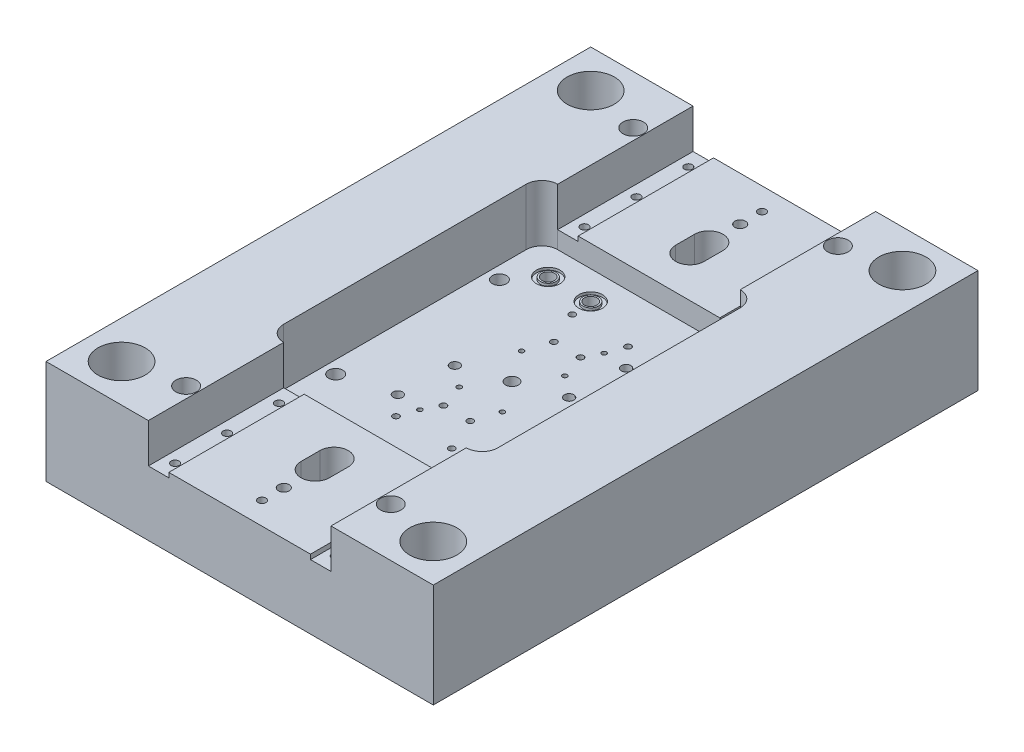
ISO-10303-21;
HEADER;
FILE_DESCRIPTION(('STEP AP214'),'2;1');
FILE_NAME('part.step','',(''),(''),'','','');
FILE_SCHEMA(('AUTOMOTIVE_DESIGN { 1 0 10303 214 1 1 1 1 }'));
ENDSEC;
DATA;
#1=APPLICATION_CONTEXT('core data for automotive mechanical design processes');
#2=APPLICATION_PROTOCOL_DEFINITION('international standard','automotive_design',2000,#1);
#3=PRODUCT_CONTEXT('',#1,'mechanical');
#4=PRODUCT('Part','Part','',(#3));
#5=PRODUCT_RELATED_PRODUCT_CATEGORY('part','',(#4));
#6=PRODUCT_DEFINITION_FORMATION('','',#4);
#7=PRODUCT_DEFINITION_CONTEXT('part definition',#1,'design');
#8=PRODUCT_DEFINITION('design','',#6,#7);
#9=PRODUCT_DEFINITION_SHAPE('','',#8);
#10=(LENGTH_UNIT() NAMED_UNIT(*) SI_UNIT(.MILLI.,.METRE.));
#11=(NAMED_UNIT(*) PLANE_ANGLE_UNIT() SI_UNIT($,.RADIAN.));
#12=(NAMED_UNIT(*) SI_UNIT($,.STERADIAN.) SOLID_ANGLE_UNIT());
#13=UNCERTAINTY_MEASURE_WITH_UNIT(LENGTH_MEASURE(1.E-05),#10,'distance_accuracy_value','');
#14=(GEOMETRIC_REPRESENTATION_CONTEXT(3) GLOBAL_UNCERTAINTY_ASSIGNED_CONTEXT((#13)) GLOBAL_UNIT_ASSIGNED_CONTEXT((#10,
#11,#12)) REPRESENTATION_CONTEXT('',''));
#15=CARTESIAN_POINT('',(0.,0.,0.));
#16=DIRECTION('',(0.,0.,1.));
#17=DIRECTION('',(1.,0.,0.));
#18=AXIS2_PLACEMENT_3D('',#15,#16,#17);
#19=CARTESIAN_POINT('',(-19.,-59.5,-4.));
#20=DIRECTION('',(0.,1.,0.));
#21=DIRECTION('',(0.,0.,1.));
#22=AXIS2_PLACEMENT_3D('',#19,#20,#21);
#23=CONICAL_SURFACE('',#22,0.,1.04719755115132);
#24=CARTESIAN_POINT('',(-19.,-59.5,-4.));
#25=VERTEX_POINT('',#24);
#26=VERTEX_LOOP('',#25);
#27=FACE_BOUND('',#26,.T.);
#28=CARTESIAN_POINT('',(-19.,-57.190598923,-4.));
#29=DIRECTION('',(0.,1.,0.));
#30=DIRECTION('',(0.,0.,1.));
#31=AXIS2_PLACEMENT_3D('',#28,#29,#30);
#32=CIRCLE('',#31,4.);
#33=CARTESIAN_POINT('',(-19.,-57.190598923,0.));
#34=VERTEX_POINT('',#33);
#35=EDGE_CURVE('E784',#34,#34,#32,.F.);
#36=ORIENTED_EDGE('',*,*,#35,.F.);
#37=EDGE_LOOP('',(#36));
#38=FACE_BOUND('',#37,.T.);
#39=ADVANCED_FACE('F42',(#27,#38),#23,.F.);
#40=CARTESIAN_POINT('',(-46.,-59.5,-4.));
#41=DIRECTION('',(0.,1.,0.));
#42=DIRECTION('',(0.,0.,1.));
#43=AXIS2_PLACEMENT_3D('',#40,#41,#42);
#44=CONICAL_SURFACE('',#43,0.,1.04719755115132);
#45=CARTESIAN_POINT('',(-46.,-59.5,-4.));
#46=VERTEX_POINT('',#45);
#47=VERTEX_LOOP('',#46);
#48=FACE_BOUND('',#47,.T.);
#49=CARTESIAN_POINT('',(-46.,-57.190598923,-4.));
#50=DIRECTION('',(0.,1.,0.));
#51=DIRECTION('',(0.,0.,1.));
#52=AXIS2_PLACEMENT_3D('',#49,#50,#51);
#53=CIRCLE('',#52,4.);
#54=CARTESIAN_POINT('',(-46.,-57.190598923,0.));
#55=VERTEX_POINT('',#54);
#56=EDGE_CURVE('E337',#55,#55,#53,.F.);
#57=ORIENTED_EDGE('',*,*,#56,.F.);
#58=EDGE_LOOP('',(#57));
#59=FACE_BOUND('',#58,.T.);
#60=ADVANCED_FACE('F2506',(#48,#59),#44,.F.);
#61=CARTESIAN_POINT('',(-19.,-57.190598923,-4.));
#62=DIRECTION('',(0.,1.,0.));
#63=DIRECTION('',(0.,0.,1.));
#64=AXIS2_PLACEMENT_3D('',#61,#62,#63);
#65=CYLINDRICAL_SURFACE('',#64,4.);
#66=CARTESIAN_POINT('',(-19.,-53.,-4.));
#67=DIRECTION('',(0.,0.707106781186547,-0.707106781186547));
#68=DIRECTION('',(0.,-0.707106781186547,-0.707106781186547));
#69=AXIS2_PLACEMENT_3D('',#66,#67,#68);
#70=ELLIPSE('',#69,5.65685424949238,4.);
#71=CARTESIAN_POINT('',(-23.,-53.,-4.));
#72=VERTEX_POINT('',#71);
#73=CARTESIAN_POINT('',(-15.,-53.,-4.));
#74=VERTEX_POINT('',#73);
#75=EDGE_CURVE('E46',#72,#74,#70,.F.);
#76=ORIENTED_EDGE('',*,*,#75,.F.);
#77=CARTESIAN_POINT('',(-19.,-53.,-4.));
#78=DIRECTION('',(0.,-0.707106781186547,-0.707106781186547));
#79=DIRECTION('',(0.,0.707106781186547,-0.707106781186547));
#80=AXIS2_PLACEMENT_3D('',#77,#78,#79);
#81=ELLIPSE('',#80,5.65685424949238,4.);
#82=EDGE_CURVE('E336',#74,#72,#81,.F.);
#83=ORIENTED_EDGE('',*,*,#82,.F.);
#84=EDGE_LOOP('',(#76,#83));
#85=FACE_BOUND('',#84,.T.);
#86=CARTESIAN_POINT('',(-19.,-36.,-4.));
#87=DIRECTION('',(0.,1.,0.));
#88=DIRECTION('',(0.,0.,1.));
#89=AXIS2_PLACEMENT_3D('',#86,#87,#88);
#90=CIRCLE('',#89,4.);
#91=CARTESIAN_POINT('',(-19.,-36.,0.));
#92=VERTEX_POINT('',#91);
#93=EDGE_CURVE('E346',#92,#92,#90,.T.);
#94=ORIENTED_EDGE('',*,*,#93,.T.);
#95=EDGE_LOOP('',(#94));
#96=FACE_BOUND('',#95,.T.);
#97=ORIENTED_EDGE('',*,*,#35,.T.);
#98=EDGE_LOOP('',(#97));
#99=FACE_BOUND('',#98,.T.);
#100=ADVANCED_FACE('F334',(#85,#96,#99),#65,.F.);
#101=CARTESIAN_POINT('',(-46.,-57.190598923,-4.));
#102=DIRECTION('',(0.,1.,0.));
#103=DIRECTION('',(0.,0.,1.));
#104=AXIS2_PLACEMENT_3D('',#101,#102,#103);
#105=CYLINDRICAL_SURFACE('',#104,4.);
#106=CARTESIAN_POINT('',(-46.,-53.,-4.));
#107=DIRECTION('',(0.,0.707106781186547,-0.707106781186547));
#108=DIRECTION('',(0.,-0.707106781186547,-0.707106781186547));
#109=AXIS2_PLACEMENT_3D('',#106,#107,#108);
#110=ELLIPSE('',#109,5.65685424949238,4.);
#111=CARTESIAN_POINT('',(-50.,-53.,-4.));
#112=VERTEX_POINT('',#111);
#113=CARTESIAN_POINT('',(-42.,-53.,-4.));
#114=VERTEX_POINT('',#113);
#115=EDGE_CURVE('E340',#112,#114,#110,.F.);
#116=ORIENTED_EDGE('',*,*,#115,.F.);
#117=CARTESIAN_POINT('',(-46.,-53.,-4.));
#118=DIRECTION('',(0.,-0.707106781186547,-0.707106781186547));
#119=DIRECTION('',(0.,0.707106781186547,-0.707106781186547));
#120=AXIS2_PLACEMENT_3D('',#117,#118,#119);
#121=ELLIPSE('',#120,5.65685424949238,4.);
#122=EDGE_CURVE('E341',#114,#112,#121,.F.);
#123=ORIENTED_EDGE('',*,*,#122,.F.);
#124=EDGE_LOOP('',(#116,#123));
#125=FACE_BOUND('',#124,.T.);
#126=CARTESIAN_POINT('',(-46.,-36.,-4.));
#127=DIRECTION('',(0.,1.,0.));
#128=DIRECTION('',(0.,0.,1.));
#129=AXIS2_PLACEMENT_3D('',#126,#127,#128);
#130=CIRCLE('',#129,4.);
#131=CARTESIAN_POINT('',(-46.,-36.,0.));
#132=VERTEX_POINT('',#131);
#133=EDGE_CURVE('E349',#132,#132,#130,.T.);
#134=ORIENTED_EDGE('',*,*,#133,.T.);
#135=EDGE_LOOP('',(#134));
#136=FACE_BOUND('',#135,.T.);
#137=ORIENTED_EDGE('',*,*,#56,.T.);
#138=EDGE_LOOP('',(#137));
#139=FACE_BOUND('',#138,.T.);
#140=ADVANCED_FACE('F2490',(#125,#136,#139),#105,.F.);
#141=CARTESIAN_POINT('',(-19.,-53.,-3.603966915));
#142=DIRECTION('',(0.,0.,-1.));
#143=DIRECTION('',(-1.,0.,0.));
#144=AXIS2_PLACEMENT_3D('',#141,#142,#143);
#145=CYLINDRICAL_SURFACE('',#144,4.);
#146=ORIENTED_EDGE('',*,*,#82,.T.);
#147=ORIENTED_EDGE('',*,*,#75,.T.);
#148=EDGE_LOOP('',(#146,#147));
#149=FACE_BOUND('',#148,.T.);
#150=CARTESIAN_POINT('',(-19.,-53.,-70.005514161));
#151=DIRECTION('',(0.,0.,-1.));
#152=DIRECTION('',(1.,0.,0.));
#153=AXIS2_PLACEMENT_3D('',#150,#151,#152);
#154=CIRCLE('',#153,4.);
#155=CARTESIAN_POINT('',(-15.,-53.,-70.005514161));
#156=VERTEX_POINT('',#155);
#157=EDGE_CURVE('E352',#156,#156,#154,.F.);
#158=ORIENTED_EDGE('',*,*,#157,.F.);
#159=EDGE_LOOP('',(#158));
#160=FACE_BOUND('',#159,.T.);
#161=ADVANCED_FACE('F338',(#149,#160),#145,.F.);
#162=CARTESIAN_POINT('',(-46.,-53.,-3.603966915));
#163=DIRECTION('',(0.,0.,-1.));
#164=DIRECTION('',(-1.,0.,0.));
#165=AXIS2_PLACEMENT_3D('',#162,#163,#164);
#166=CYLINDRICAL_SURFACE('',#165,4.);
#167=ORIENTED_EDGE('',*,*,#122,.T.);
#168=ORIENTED_EDGE('',*,*,#115,.T.);
#169=EDGE_LOOP('',(#167,#168));
#170=FACE_BOUND('',#169,.T.);
#171=CARTESIAN_POINT('',(-46.,-53.,-70.005514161));
#172=DIRECTION('',(0.,0.,-1.));
#173=DIRECTION('',(1.,0.,0.));
#174=AXIS2_PLACEMENT_3D('',#171,#172,#173);
#175=CIRCLE('',#174,4.);
#176=CARTESIAN_POINT('',(-42.,-53.,-70.005514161));
#177=VERTEX_POINT('',#176);
#178=EDGE_CURVE('E357',#177,#177,#175,.F.);
#179=ORIENTED_EDGE('',*,*,#178,.F.);
#180=EDGE_LOOP('',(#179));
#181=FACE_BOUND('',#180,.T.);
#182=ADVANCED_FACE('F2477',(#170,#181),#166,.F.);
#183=CARTESIAN_POINT('',(-13.94,-36.,1.06));
#184=DIRECTION('',(0.,-1.,0.));
#185=DIRECTION('',(-1.,0.,0.));
#186=AXIS2_PLACEMENT_3D('',#183,#184,#185);
#187=PLANE('',#186);
#188=ORIENTED_EDGE('',*,*,#93,.F.);
#189=EDGE_LOOP('',(#188));
#190=FACE_BOUND('',#189,.T.);
#191=CARTESIAN_POINT('',(-19.,-36.,-4.));
#192=DIRECTION('',(0.,1.,0.));
#193=DIRECTION('',(0.,0.,1.));
#194=AXIS2_PLACEMENT_3D('',#191,#192,#193);
#195=CIRCLE('',#194,5.);
#196=CARTESIAN_POINT('',(-19.,-36.,1.));
#197=VERTEX_POINT('',#196);
#198=EDGE_CURVE('E353',#197,#197,#195,.T.);
#199=ORIENTED_EDGE('',*,*,#198,.T.);
#200=EDGE_LOOP('',(#199));
#201=FACE_BOUND('',#200,.T.);
#202=ADVANCED_FACE('F1135',(#190,#201),#187,.F.);
#203=CARTESIAN_POINT('',(-40.94,-36.,1.06));
#204=DIRECTION('',(0.,-1.,0.));
#205=DIRECTION('',(-1.,0.,0.));
#206=AXIS2_PLACEMENT_3D('',#203,#204,#205);
#207=PLANE('',#206);
#208=ORIENTED_EDGE('',*,*,#133,.F.);
#209=EDGE_LOOP('',(#208));
#210=FACE_BOUND('',#209,.T.);
#211=CARTESIAN_POINT('',(-46.,-36.,-4.));
#212=DIRECTION('',(0.,1.,0.));
#213=DIRECTION('',(0.,0.,1.));
#214=AXIS2_PLACEMENT_3D('',#211,#212,#213);
#215=CIRCLE('',#214,5.);
#216=CARTESIAN_POINT('',(-46.,-36.,1.));
#217=VERTEX_POINT('',#216);
#218=EDGE_CURVE('E356',#217,#217,#215,.T.);
#219=ORIENTED_EDGE('',*,*,#218,.T.);
#220=EDGE_LOOP('',(#219));
#221=FACE_BOUND('',#220,.T.);
#222=ADVANCED_FACE('F1125',(#210,#221),#207,.F.);
#223=CARTESIAN_POINT('',(-19.,-53.,-70.005514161));
#224=DIRECTION('',(0.,0.,-1.));
#225=DIRECTION('',(-1.,0.,0.));
#226=AXIS2_PLACEMENT_3D('',#223,#224,#225);
#227=CONICAL_SURFACE('',#226,4.,1.04719755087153);
#228=ORIENTED_EDGE('',*,*,#157,.T.);
#229=EDGE_LOOP('',(#228));
#230=FACE_BOUND('',#229,.T.);
#231=CARTESIAN_POINT('',(-19.,-53.,-71.390076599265));
#232=DIRECTION('',(0.,0.,1.));
#233=DIRECTION('',(1.,0.,0.));
#234=AXIS2_PLACEMENT_3D('',#231,#232,#233);
#235=CIRCLE('',#234,6.39813248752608);
#236=CARTESIAN_POINT('',(-12.6018675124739,-53.,-71.390076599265));
#237=VERTEX_POINT('',#236);
#238=EDGE_CURVE('E1105',#237,#237,#235,.T.);
#239=ORIENTED_EDGE('',*,*,#238,.F.);
#240=EDGE_LOOP('',(#239));
#241=FACE_BOUND('',#240,.T.);
#242=ADVANCED_FACE('F1122',(#230,#241),#227,.F.);
#243=CARTESIAN_POINT('',(-46.,-53.,-70.005514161));
#244=DIRECTION('',(0.,0.,-1.));
#245=DIRECTION('',(-1.,0.,0.));
#246=AXIS2_PLACEMENT_3D('',#243,#244,#245);
#247=CONICAL_SURFACE('',#246,4.,1.04719755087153);
#248=ORIENTED_EDGE('',*,*,#178,.T.);
#249=EDGE_LOOP('',(#248));
#250=FACE_BOUND('',#249,.T.);
#251=CARTESIAN_POINT('',(-46.,-53.,-71.390076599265));
#252=DIRECTION('',(0.,0.,1.));
#253=DIRECTION('',(1.,0.,0.));
#254=AXIS2_PLACEMENT_3D('',#251,#252,#253);
#255=CIRCLE('',#254,6.39813248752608);
#256=CARTESIAN_POINT('',(-39.6018675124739,-53.,-71.390076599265));
#257=VERTEX_POINT('',#256);
#258=EDGE_CURVE('E787',#257,#257,#255,.T.);
#259=ORIENTED_EDGE('',*,*,#258,.F.);
#260=EDGE_LOOP('',(#259));
#261=FACE_BOUND('',#260,.T.);
#262=ADVANCED_FACE('F1124',(#250,#261),#247,.F.);
#263=CARTESIAN_POINT('',(51.,-41.479274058,195.));
#264=DIRECTION('',(0.,1.,0.));
#265=DIRECTION('',(0.,0.,1.));
#266=AXIS2_PLACEMENT_3D('',#263,#264,#265);
#267=CONICAL_SURFACE('',#266,0.,1.04719755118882);
#268=CARTESIAN_POINT('',(51.,-41.479274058,195.));
#269=VERTEX_POINT('',#268);
#270=VERTEX_LOOP('',#269);
#271=FACE_BOUND('',#270,.T.);
#272=CARTESIAN_POINT('',(51.,-40.035898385,195.));
#273=DIRECTION('',(0.,1.,0.));
#274=DIRECTION('',(0.,0.,1.));
#275=AXIS2_PLACEMENT_3D('',#272,#273,#274);
#276=CIRCLE('',#275,2.5);
#277=CARTESIAN_POINT('',(51.,-40.035898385,197.5));
#278=VERTEX_POINT('',#277);
#279=EDGE_CURVE('E360',#278,#278,#276,.F.);
#280=ORIENTED_EDGE('',*,*,#279,.F.);
#281=EDGE_LOOP('',(#280));
#282=FACE_BOUND('',#281,.T.);
#283=ADVANCED_FACE('F1132',(#271,#282),#267,.F.);
#284=CARTESIAN_POINT('',(51.,-41.479274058,162.));
#285=DIRECTION('',(0.,1.,0.));
#286=DIRECTION('',(0.,0.,1.));
#287=AXIS2_PLACEMENT_3D('',#284,#285,#286);
#288=CONICAL_SURFACE('',#287,0.,1.04719755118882);
#289=CARTESIAN_POINT('',(51.,-41.479274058,162.));
#290=VERTEX_POINT('',#289);
#291=VERTEX_LOOP('',#290);
#292=FACE_BOUND('',#291,.T.);
#293=CARTESIAN_POINT('',(51.,-40.035898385,162.));
#294=DIRECTION('',(0.,1.,0.));
#295=DIRECTION('',(0.,0.,1.));
#296=AXIS2_PLACEMENT_3D('',#293,#294,#295);
#297=CIRCLE('',#296,2.5);
#298=CARTESIAN_POINT('',(51.,-40.035898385,164.5));
#299=VERTEX_POINT('',#298);
#300=EDGE_CURVE('E796',#299,#299,#297,.F.);
#301=ORIENTED_EDGE('',*,*,#300,.F.);
#302=EDGE_LOOP('',(#301));
#303=FACE_BOUND('',#302,.T.);
#304=ADVANCED_FACE('F1537',(#292,#303),#288,.F.);
#305=CARTESIAN_POINT('',(51.,-41.479274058,228.));
#306=DIRECTION('',(0.,1.,0.));
#307=DIRECTION('',(0.,0.,1.));
#308=AXIS2_PLACEMENT_3D('',#305,#306,#307);
#309=CONICAL_SURFACE('',#308,0.,1.04719755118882);
#310=CARTESIAN_POINT('',(51.,-41.479274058,228.));
#311=VERTEX_POINT('',#310);
#312=VERTEX_LOOP('',#311);
#313=FACE_BOUND('',#312,.T.);
#314=CARTESIAN_POINT('',(51.,-40.035898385,228.));
#315=DIRECTION('',(0.,1.,0.));
#316=DIRECTION('',(0.,0.,1.));
#317=AXIS2_PLACEMENT_3D('',#314,#315,#316);
#318=CIRCLE('',#317,2.5);
#319=CARTESIAN_POINT('',(51.,-40.035898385,230.5));
#320=VERTEX_POINT('',#319);
#321=EDGE_CURVE('E799',#320,#320,#318,.F.);
#322=ORIENTED_EDGE('',*,*,#321,.F.);
#323=EDGE_LOOP('',(#322));
#324=FACE_BOUND('',#323,.T.);
#325=ADVANCED_FACE('F1533',(#313,#324),#309,.F.);
#326=CARTESIAN_POINT('',(-51.,-41.479274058,228.));
#327=DIRECTION('',(0.,1.,0.));
#328=DIRECTION('',(0.,0.,1.));
#329=AXIS2_PLACEMENT_3D('',#326,#327,#328);
#330=CONICAL_SURFACE('',#329,0.,1.04719755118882);
#331=CARTESIAN_POINT('',(-51.,-41.479274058,228.));
#332=VERTEX_POINT('',#331);
#333=VERTEX_LOOP('',#332);
#334=FACE_BOUND('',#333,.T.);
#335=CARTESIAN_POINT('',(-51.,-40.035898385,228.));
#336=DIRECTION('',(0.,1.,0.));
#337=DIRECTION('',(0.,0.,1.));
#338=AXIS2_PLACEMENT_3D('',#335,#336,#337);
#339=CIRCLE('',#338,2.5);
#340=CARTESIAN_POINT('',(-51.,-40.035898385,230.5));
#341=VERTEX_POINT('',#340);
#342=EDGE_CURVE('E802',#341,#341,#339,.F.);
#343=ORIENTED_EDGE('',*,*,#342,.F.);
#344=EDGE_LOOP('',(#343));
#345=FACE_BOUND('',#344,.T.);
#346=ADVANCED_FACE('F1529',(#334,#345),#330,.F.);
#347=CARTESIAN_POINT('',(-51.,-41.479274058,162.));
#348=DIRECTION('',(0.,1.,0.));
#349=DIRECTION('',(0.,0.,1.));
#350=AXIS2_PLACEMENT_3D('',#347,#348,#349);
#351=CONICAL_SURFACE('',#350,0.,1.04719755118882);
#352=CARTESIAN_POINT('',(-51.,-41.479274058,162.));
#353=VERTEX_POINT('',#352);
#354=VERTEX_LOOP('',#353);
#355=FACE_BOUND('',#354,.T.);
#356=CARTESIAN_POINT('',(-51.,-40.035898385,162.));
#357=DIRECTION('',(0.,1.,0.));
#358=DIRECTION('',(0.,0.,1.));
#359=AXIS2_PLACEMENT_3D('',#356,#357,#358);
#360=CIRCLE('',#359,2.5);
#361=CARTESIAN_POINT('',(-51.,-40.035898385,164.5));
#362=VERTEX_POINT('',#361);
#363=EDGE_CURVE('E805',#362,#362,#360,.F.);
#364=ORIENTED_EDGE('',*,*,#363,.F.);
#365=EDGE_LOOP('',(#364));
#366=FACE_BOUND('',#365,.T.);
#367=ADVANCED_FACE('F1525',(#355,#366),#351,.F.);
#368=CARTESIAN_POINT('',(-51.,-41.479274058,195.));
#369=DIRECTION('',(0.,1.,0.));
#370=DIRECTION('',(0.,0.,1.));
#371=AXIS2_PLACEMENT_3D('',#368,#369,#370);
#372=CONICAL_SURFACE('',#371,0.,1.04719755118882);
#373=CARTESIAN_POINT('',(-51.,-41.479274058,195.));
#374=VERTEX_POINT('',#373);
#375=VERTEX_LOOP('',#374);
#376=FACE_BOUND('',#375,.T.);
#377=CARTESIAN_POINT('',(-51.,-40.035898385,195.));
#378=DIRECTION('',(0.,1.,0.));
#379=DIRECTION('',(0.,0.,1.));
#380=AXIS2_PLACEMENT_3D('',#377,#378,#379);
#381=CIRCLE('',#380,2.5);
#382=CARTESIAN_POINT('',(-51.,-40.035898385,197.5));
#383=VERTEX_POINT('',#382);
#384=EDGE_CURVE('E808',#383,#383,#381,.F.);
#385=ORIENTED_EDGE('',*,*,#384,.F.);
#386=EDGE_LOOP('',(#385));
#387=FACE_BOUND('',#386,.T.);
#388=ADVANCED_FACE('F1521',(#376,#387),#372,.F.);
#389=CARTESIAN_POINT('',(0.,-43.,223.8));
#390=DIRECTION('',(0.,1.,0.));
#391=DIRECTION('',(0.,0.,1.));
#392=AXIS2_PLACEMENT_3D('',#389,#390,#391);
#393=CONICAL_SURFACE('',#392,0.,1.04719755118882);
#394=CARTESIAN_POINT('',(0.,-43.,223.8));
#395=VERTEX_POINT('',#394);
#396=VERTEX_LOOP('',#395);
#397=FACE_BOUND('',#396,.T.);
#398=CARTESIAN_POINT('',(0.,-41.556624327,223.8));
#399=DIRECTION('',(0.,-1.,0.));
#400=DIRECTION('',(0.,0.,-1.));
#401=AXIS2_PLACEMENT_3D('',#398,#399,#400);
#402=CIRCLE('',#401,2.5);
#403=CARTESIAN_POINT('',(0.,-41.556624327,221.3));
#404=VERTEX_POINT('',#403);
#405=EDGE_CURVE('E365',#404,#404,#402,.T.);
#406=ORIENTED_EDGE('',*,*,#405,.F.);
#407=EDGE_LOOP('',(#406));
#408=FACE_BOUND('',#407,.T.);
#409=ADVANCED_FACE('F1517',(#397,#408),#393,.F.);
#410=CARTESIAN_POINT('',(-19.,-37.6,-4.));
#411=DIRECTION('',(0.,1.,0.));
#412=DIRECTION('',(0.,0.,1.));
#413=AXIS2_PLACEMENT_3D('',#410,#411,#412);
#414=CYLINDRICAL_SURFACE('',#413,5.);
#415=CARTESIAN_POINT('',(-19.,-37.6,-4.));
#416=DIRECTION('',(0.,1.,0.));
#417=DIRECTION('',(0.,0.,1.));
#418=AXIS2_PLACEMENT_3D('',#415,#416,#417);
#419=CIRCLE('',#418,5.);
#420=CARTESIAN_POINT('',(-19.,-37.6,1.));
#421=VERTEX_POINT('',#420);
#422=EDGE_CURVE('E361',#421,#421,#419,.T.);
#423=ORIENTED_EDGE('',*,*,#422,.T.);
#424=EDGE_LOOP('',(#423));
#425=FACE_BOUND('',#424,.T.);
#426=ORIENTED_EDGE('',*,*,#198,.F.);
#427=EDGE_LOOP('',(#426));
#428=FACE_BOUND('',#427,.T.);
#429=ADVANCED_FACE('F1513',(#425,#428),#414,.T.);
#430=CARTESIAN_POINT('',(-46.,-37.6,-4.));
#431=DIRECTION('',(0.,1.,0.));
#432=DIRECTION('',(0.,0.,1.));
#433=AXIS2_PLACEMENT_3D('',#430,#431,#432);
#434=CYLINDRICAL_SURFACE('',#433,5.);
#435=ORIENTED_EDGE('',*,*,#218,.F.);
#436=EDGE_LOOP('',(#435));
#437=FACE_BOUND('',#436,.T.);
#438=CARTESIAN_POINT('',(-46.,-37.6,-4.));
#439=DIRECTION('',(0.,1.,0.));
#440=DIRECTION('',(0.,0.,1.));
#441=AXIS2_PLACEMENT_3D('',#438,#439,#440);
#442=CIRCLE('',#441,5.);
#443=CARTESIAN_POINT('',(-46.,-37.6,1.));
#444=VERTEX_POINT('',#443);
#445=EDGE_CURVE('E364',#444,#444,#442,.T.);
#446=ORIENTED_EDGE('',*,*,#445,.T.);
#447=EDGE_LOOP('',(#446));
#448=FACE_BOUND('',#447,.T.);
#449=ADVANCED_FACE('F1509',(#437,#448),#434,.T.);
#450=CARTESIAN_POINT('',(51.,-40.035898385,195.));
#451=DIRECTION('',(0.,1.,0.));
#452=DIRECTION('',(0.,0.,1.));
#453=AXIS2_PLACEMENT_3D('',#450,#451,#452);
#454=CYLINDRICAL_SURFACE('',#453,2.5);
#455=CARTESIAN_POINT('',(51.,-25.,195.));
#456=DIRECTION('',(0.,1.,0.));
#457=DIRECTION('',(0.,0.,1.));
#458=AXIS2_PLACEMENT_3D('',#455,#456,#457);
#459=CIRCLE('',#458,2.5);
#460=CARTESIAN_POINT('',(51.,-25.,197.5));
#461=VERTEX_POINT('',#460);
#462=EDGE_CURVE('E368',#461,#461,#459,.T.);
#463=ORIENTED_EDGE('',*,*,#462,.T.);
#464=EDGE_LOOP('',(#463));
#465=FACE_BOUND('',#464,.T.);
#466=ORIENTED_EDGE('',*,*,#279,.T.);
#467=EDGE_LOOP('',(#466));
#468=FACE_BOUND('',#467,.T.);
#469=ADVANCED_FACE('F1505',(#465,#468),#454,.F.);
#470=CARTESIAN_POINT('',(51.,-40.035898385,162.));
#471=DIRECTION('',(0.,1.,0.));
#472=DIRECTION('',(0.,0.,1.));
#473=AXIS2_PLACEMENT_3D('',#470,#471,#472);
#474=CYLINDRICAL_SURFACE('',#473,2.5);
#475=CARTESIAN_POINT('',(51.,-25.,162.));
#476=DIRECTION('',(0.,1.,0.));
#477=DIRECTION('',(0.,0.,1.));
#478=AXIS2_PLACEMENT_3D('',#475,#476,#477);
#479=CIRCLE('',#478,2.5);
#480=CARTESIAN_POINT('',(51.,-25.,164.5));
#481=VERTEX_POINT('',#480);
#482=EDGE_CURVE('E371',#481,#481,#479,.T.);
#483=ORIENTED_EDGE('',*,*,#482,.T.);
#484=EDGE_LOOP('',(#483));
#485=FACE_BOUND('',#484,.T.);
#486=ORIENTED_EDGE('',*,*,#300,.T.);
#487=EDGE_LOOP('',(#486));
#488=FACE_BOUND('',#487,.T.);
#489=ADVANCED_FACE('F1501',(#485,#488),#474,.F.);
#490=CARTESIAN_POINT('',(51.,-40.035898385,228.));
#491=DIRECTION('',(0.,1.,0.));
#492=DIRECTION('',(0.,0.,1.));
#493=AXIS2_PLACEMENT_3D('',#490,#491,#492);
#494=CYLINDRICAL_SURFACE('',#493,2.5);
#495=CARTESIAN_POINT('',(51.,-25.,228.));
#496=DIRECTION('',(0.,1.,0.));
#497=DIRECTION('',(0.,0.,1.));
#498=AXIS2_PLACEMENT_3D('',#495,#496,#497);
#499=CIRCLE('',#498,2.5);
#500=CARTESIAN_POINT('',(51.,-25.,230.5));
#501=VERTEX_POINT('',#500);
#502=EDGE_CURVE('E374',#501,#501,#499,.T.);
#503=ORIENTED_EDGE('',*,*,#502,.T.);
#504=EDGE_LOOP('',(#503));
#505=FACE_BOUND('',#504,.T.);
#506=ORIENTED_EDGE('',*,*,#321,.T.);
#507=EDGE_LOOP('',(#506));
#508=FACE_BOUND('',#507,.T.);
#509=ADVANCED_FACE('F1497',(#505,#508),#494,.F.);
#510=CARTESIAN_POINT('',(-51.,-40.035898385,228.));
#511=DIRECTION('',(0.,1.,0.));
#512=DIRECTION('',(0.,0.,1.));
#513=AXIS2_PLACEMENT_3D('',#510,#511,#512);
#514=CYLINDRICAL_SURFACE('',#513,2.5);
#515=CARTESIAN_POINT('',(-51.,-25.,228.));
#516=DIRECTION('',(0.,1.,0.));
#517=DIRECTION('',(0.,0.,1.));
#518=AXIS2_PLACEMENT_3D('',#515,#516,#517);
#519=CIRCLE('',#518,2.5);
#520=CARTESIAN_POINT('',(-51.,-25.,230.5));
#521=VERTEX_POINT('',#520);
#522=EDGE_CURVE('E378',#521,#521,#519,.T.);
#523=ORIENTED_EDGE('',*,*,#522,.T.);
#524=EDGE_LOOP('',(#523));
#525=FACE_BOUND('',#524,.T.);
#526=ORIENTED_EDGE('',*,*,#342,.T.);
#527=EDGE_LOOP('',(#526));
#528=FACE_BOUND('',#527,.T.);
#529=ADVANCED_FACE('F1493',(#525,#528),#514,.F.);
#530=CARTESIAN_POINT('',(-51.,-40.035898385,162.));
#531=DIRECTION('',(0.,1.,0.));
#532=DIRECTION('',(0.,0.,1.));
#533=AXIS2_PLACEMENT_3D('',#530,#531,#532);
#534=CYLINDRICAL_SURFACE('',#533,2.5);
#535=CARTESIAN_POINT('',(-51.,-25.,162.));
#536=DIRECTION('',(0.,1.,0.));
#537=DIRECTION('',(0.,0.,1.));
#538=AXIS2_PLACEMENT_3D('',#535,#536,#537);
#539=CIRCLE('',#538,2.5);
#540=CARTESIAN_POINT('',(-51.,-25.,164.5));
#541=VERTEX_POINT('',#540);
#542=EDGE_CURVE('E381',#541,#541,#539,.T.);
#543=ORIENTED_EDGE('',*,*,#542,.T.);
#544=EDGE_LOOP('',(#543));
#545=FACE_BOUND('',#544,.T.);
#546=ORIENTED_EDGE('',*,*,#363,.T.);
#547=EDGE_LOOP('',(#546));
#548=FACE_BOUND('',#547,.T.);
#549=ADVANCED_FACE('F1489',(#545,#548),#534,.F.);
#550=CARTESIAN_POINT('',(-51.,-40.035898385,195.));
#551=DIRECTION('',(0.,1.,0.));
#552=DIRECTION('',(0.,0.,1.));
#553=AXIS2_PLACEMENT_3D('',#550,#551,#552);
#554=CYLINDRICAL_SURFACE('',#553,2.5);
#555=CARTESIAN_POINT('',(-51.,-25.,195.));
#556=DIRECTION('',(0.,1.,0.));
#557=DIRECTION('',(0.,0.,1.));
#558=AXIS2_PLACEMENT_3D('',#555,#556,#557);
#559=CIRCLE('',#558,2.5);
#560=CARTESIAN_POINT('',(-51.,-25.,197.5));
#561=VERTEX_POINT('',#560);
#562=EDGE_CURVE('E385',#561,#561,#559,.T.);
#563=ORIENTED_EDGE('',*,*,#562,.T.);
#564=EDGE_LOOP('',(#563));
#565=FACE_BOUND('',#564,.T.);
#566=ORIENTED_EDGE('',*,*,#384,.T.);
#567=EDGE_LOOP('',(#566));
#568=FACE_BOUND('',#567,.T.);
#569=ADVANCED_FACE('F1485',(#565,#568),#554,.F.);
#570=CARTESIAN_POINT('',(0.,-22.,223.8));
#571=DIRECTION('',(0.,-1.,0.));
#572=DIRECTION('',(0.,0.,-1.));
#573=AXIS2_PLACEMENT_3D('',#570,#571,#572);
#574=CYLINDRICAL_SURFACE('',#573,2.5);
#575=ORIENTED_EDGE('',*,*,#405,.T.);
#576=EDGE_LOOP('',(#575));
#577=FACE_BOUND('',#576,.T.);
#578=CARTESIAN_POINT('',(0.,-22.,223.8));
#579=DIRECTION('',(0.,-1.,0.));
#580=DIRECTION('',(0.,0.,-1.));
#581=AXIS2_PLACEMENT_3D('',#578,#579,#580);
#582=CIRCLE('',#581,2.5);
#583=CARTESIAN_POINT('',(0.,-22.,221.3));
#584=VERTEX_POINT('',#583);
#585=EDGE_CURVE('E389',#584,#584,#582,.T.);
#586=ORIENTED_EDGE('',*,*,#585,.F.);
#587=EDGE_LOOP('',(#586));
#588=FACE_BOUND('',#587,.T.);
#589=ADVANCED_FACE('F1481',(#577,#588),#574,.F.);
#590=CARTESIAN_POINT('',(-11.41,-37.6,3.59));
#591=DIRECTION('',(0.,-1.,0.));
#592=DIRECTION('',(-1.,0.,0.));
#593=AXIS2_PLACEMENT_3D('',#590,#591,#592);
#594=PLANE('',#593);
#595=ORIENTED_EDGE('',*,*,#422,.F.);
#596=EDGE_LOOP('',(#595));
#597=FACE_BOUND('',#596,.T.);
#598=CARTESIAN_POINT('',(-19.,-37.6,-4.));
#599=DIRECTION('',(0.,1.,0.));
#600=DIRECTION('',(0.,0.,1.));
#601=AXIS2_PLACEMENT_3D('',#598,#599,#600);
#602=CIRCLE('',#601,7.5);
#603=CARTESIAN_POINT('',(-19.,-37.6,3.5));
#604=VERTEX_POINT('',#603);
#605=EDGE_CURVE('E394',#604,#604,#602,.F.);
#606=ORIENTED_EDGE('',*,*,#605,.F.);
#607=EDGE_LOOP('',(#606));
#608=FACE_BOUND('',#607,.T.);
#609=ADVANCED_FACE('F1484',(#597,#608),#594,.F.);
#610=CARTESIAN_POINT('',(-38.41,-37.6,3.59));
#611=DIRECTION('',(0.,-1.,0.));
#612=DIRECTION('',(-1.,0.,0.));
#613=AXIS2_PLACEMENT_3D('',#610,#611,#612);
#614=PLANE('',#613);
#615=ORIENTED_EDGE('',*,*,#445,.F.);
#616=EDGE_LOOP('',(#615));
#617=FACE_BOUND('',#616,.T.);
#618=CARTESIAN_POINT('',(-46.,-37.6,-4.));
#619=DIRECTION('',(0.,1.,0.));
#620=DIRECTION('',(0.,0.,1.));
#621=AXIS2_PLACEMENT_3D('',#618,#619,#620);
#622=CIRCLE('',#621,7.5);
#623=CARTESIAN_POINT('',(-46.,-37.6,3.5));
#624=VERTEX_POINT('',#623);
#625=EDGE_CURVE('E410',#624,#624,#622,.F.);
#626=ORIENTED_EDGE('',*,*,#625,.F.);
#627=EDGE_LOOP('',(#626));
#628=FACE_BOUND('',#627,.T.);
#629=ADVANCED_FACE('F1479',(#617,#628),#614,.F.);
#630=CARTESIAN_POINT('',(-51.,-41.479274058,-65.));
#631=DIRECTION('',(0.,1.,0.));
#632=DIRECTION('',(0.,0.,1.));
#633=AXIS2_PLACEMENT_3D('',#630,#631,#632);
#634=CONICAL_SURFACE('',#633,0.,1.04719755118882);
#635=CARTESIAN_POINT('',(-51.,-41.479274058,-65.));
#636=VERTEX_POINT('',#635);
#637=VERTEX_LOOP('',#636);
#638=FACE_BOUND('',#637,.T.);
#639=CARTESIAN_POINT('',(-51.,-40.035898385,-65.));
#640=DIRECTION('',(0.,1.,0.));
#641=DIRECTION('',(0.,0.,-1.));
#642=AXIS2_PLACEMENT_3D('',#639,#640,#641);
#643=CIRCLE('',#642,2.5);
#644=CARTESIAN_POINT('',(-51.,-40.035898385,-67.5));
#645=VERTEX_POINT('',#644);
#646=EDGE_CURVE('E413',#645,#645,#643,.F.);
#647=ORIENTED_EDGE('',*,*,#646,.F.);
#648=EDGE_LOOP('',(#647));
#649=FACE_BOUND('',#648,.T.);
#650=ADVANCED_FACE('F1475',(#638,#649),#634,.F.);
#651=CARTESIAN_POINT('',(-51.,-41.479274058,-32.));
#652=DIRECTION('',(0.,1.,0.));
#653=DIRECTION('',(0.,0.,1.));
#654=AXIS2_PLACEMENT_3D('',#651,#652,#653);
#655=CONICAL_SURFACE('',#654,0.,1.04719755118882);
#656=CARTESIAN_POINT('',(-51.,-41.479274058,-32.));
#657=VERTEX_POINT('',#656);
#658=VERTEX_LOOP('',#657);
#659=FACE_BOUND('',#658,.T.);
#660=CARTESIAN_POINT('',(-51.,-40.035898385,-32.));
#661=DIRECTION('',(0.,1.,0.));
#662=DIRECTION('',(0.,0.,-1.));
#663=AXIS2_PLACEMENT_3D('',#660,#661,#662);
#664=CIRCLE('',#663,2.5);
#665=CARTESIAN_POINT('',(-51.,-40.035898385,-34.5));
#666=VERTEX_POINT('',#665);
#667=EDGE_CURVE('E830',#666,#666,#664,.F.);
#668=ORIENTED_EDGE('',*,*,#667,.F.);
#669=EDGE_LOOP('',(#668));
#670=FACE_BOUND('',#669,.T.);
#671=ADVANCED_FACE('F1471',(#659,#670),#655,.F.);
#672=CARTESIAN_POINT('',(-51.,-41.479274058,-98.));
#673=DIRECTION('',(0.,1.,0.));
#674=DIRECTION('',(0.,0.,1.));
#675=AXIS2_PLACEMENT_3D('',#672,#673,#674);
#676=CONICAL_SURFACE('',#675,0.,1.04719755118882);
#677=CARTESIAN_POINT('',(-51.,-41.479274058,-98.));
#678=VERTEX_POINT('',#677);
#679=VERTEX_LOOP('',#678);
#680=FACE_BOUND('',#679,.T.);
#681=CARTESIAN_POINT('',(-51.,-40.035898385,-98.));
#682=DIRECTION('',(0.,1.,0.));
#683=DIRECTION('',(0.,0.,-1.));
#684=AXIS2_PLACEMENT_3D('',#681,#682,#683);
#685=CIRCLE('',#684,2.5);
#686=CARTESIAN_POINT('',(-51.,-40.035898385,-100.5));
#687=VERTEX_POINT('',#686);
#688=EDGE_CURVE('E833',#687,#687,#685,.F.);
#689=ORIENTED_EDGE('',*,*,#688,.F.);
#690=EDGE_LOOP('',(#689));
#691=FACE_BOUND('',#690,.T.);
#692=ADVANCED_FACE('F1467',(#680,#691),#676,.F.);
#693=CARTESIAN_POINT('',(51.,-41.479274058,-98.));
#694=DIRECTION('',(0.,1.,0.));
#695=DIRECTION('',(0.,0.,1.));
#696=AXIS2_PLACEMENT_3D('',#693,#694,#695);
#697=CONICAL_SURFACE('',#696,0.,1.04719755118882);
#698=CARTESIAN_POINT('',(51.,-41.479274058,-98.));
#699=VERTEX_POINT('',#698);
#700=VERTEX_LOOP('',#699);
#701=FACE_BOUND('',#700,.T.);
#702=CARTESIAN_POINT('',(51.,-40.035898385,-98.));
#703=DIRECTION('',(0.,1.,0.));
#704=DIRECTION('',(0.,0.,-1.));
#705=AXIS2_PLACEMENT_3D('',#702,#703,#704);
#706=CIRCLE('',#705,2.5);
#707=CARTESIAN_POINT('',(51.,-40.035898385,-100.5));
#708=VERTEX_POINT('',#707);
#709=EDGE_CURVE('E836',#708,#708,#706,.F.);
#710=ORIENTED_EDGE('',*,*,#709,.F.);
#711=EDGE_LOOP('',(#710));
#712=FACE_BOUND('',#711,.T.);
#713=ADVANCED_FACE('F1463',(#701,#712),#697,.F.);
#714=CARTESIAN_POINT('',(51.,-41.479274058,-32.));
#715=DIRECTION('',(0.,1.,0.));
#716=DIRECTION('',(0.,0.,1.));
#717=AXIS2_PLACEMENT_3D('',#714,#715,#716);
#718=CONICAL_SURFACE('',#717,0.,1.04719755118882);
#719=CARTESIAN_POINT('',(51.,-41.479274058,-32.));
#720=VERTEX_POINT('',#719);
#721=VERTEX_LOOP('',#720);
#722=FACE_BOUND('',#721,.T.);
#723=CARTESIAN_POINT('',(51.,-40.035898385,-32.));
#724=DIRECTION('',(0.,1.,0.));
#725=DIRECTION('',(0.,0.,-1.));
#726=AXIS2_PLACEMENT_3D('',#723,#724,#725);
#727=CIRCLE('',#726,2.5);
#728=CARTESIAN_POINT('',(51.,-40.035898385,-34.5));
#729=VERTEX_POINT('',#728);
#730=EDGE_CURVE('E839',#729,#729,#727,.F.);
#731=ORIENTED_EDGE('',*,*,#730,.F.);
#732=EDGE_LOOP('',(#731));
#733=FACE_BOUND('',#732,.T.);
#734=ADVANCED_FACE('F1459',(#722,#733),#718,.F.);
#735=CARTESIAN_POINT('',(51.,-41.479274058,-65.));
#736=DIRECTION('',(0.,1.,0.));
#737=DIRECTION('',(0.,0.,1.));
#738=AXIS2_PLACEMENT_3D('',#735,#736,#737);
#739=CONICAL_SURFACE('',#738,0.,1.04719755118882);
#740=CARTESIAN_POINT('',(51.,-41.479274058,-65.));
#741=VERTEX_POINT('',#740);
#742=VERTEX_LOOP('',#741);
#743=FACE_BOUND('',#742,.T.);
#744=CARTESIAN_POINT('',(51.,-40.035898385,-65.));
#745=DIRECTION('',(0.,1.,0.));
#746=DIRECTION('',(0.,0.,-1.));
#747=AXIS2_PLACEMENT_3D('',#744,#745,#746);
#748=CIRCLE('',#747,2.5);
#749=CARTESIAN_POINT('',(51.,-40.035898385,-67.5));
#750=VERTEX_POINT('',#749);
#751=EDGE_CURVE('E842',#750,#750,#748,.F.);
#752=ORIENTED_EDGE('',*,*,#751,.F.);
#753=EDGE_LOOP('',(#752));
#754=FACE_BOUND('',#753,.T.);
#755=ADVANCED_FACE('F1455',(#743,#754),#739,.F.);
#756=CARTESIAN_POINT('',(-88.04107987,-56.,65.));
#757=DIRECTION('',(-1.,0.,0.));
#758=DIRECTION('',(0.,0.,1.));
#759=AXIS2_PLACEMENT_3D('',#756,#757,#758);
#760=CONICAL_SURFACE('',#759,0.,1.0471975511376);
#761=CARTESIAN_POINT('',(-88.04107987,-56.,65.));
#762=VERTEX_POINT('',#761);
#763=VERTEX_LOOP('',#762);
#764=FACE_BOUND('',#763,.T.);
#765=CARTESIAN_POINT('',(-91.,-56.,65.));
#766=DIRECTION('',(-1.,0.,0.));
#767=DIRECTION('',(0.,0.,-1.));
#768=AXIS2_PLACEMENT_3D('',#765,#766,#767);
#769=CIRCLE('',#768,5.125);
#770=CARTESIAN_POINT('',(-91.,-56.,59.875));
#771=VERTEX_POINT('',#770);
#772=EDGE_CURVE('E421',#771,#771,#769,.F.);
#773=ORIENTED_EDGE('',*,*,#772,.F.);
#774=EDGE_LOOP('',(#773));
#775=FACE_BOUND('',#774,.T.);
#776=ADVANCED_FACE('F1452',(#764,#775),#760,.F.);
#777=CARTESIAN_POINT('',(-30.132,-41.868,-86.));
#778=DIRECTION('',(0.,0.,1.));
#779=DIRECTION('',(0.,-1.,0.));
#780=AXIS2_PLACEMENT_3D('',#777,#778,#779);
#781=PLANE('',#780);
#782=CARTESIAN_POINT('',(-19.,-53.,-86.));
#783=DIRECTION('',(0.,0.,1.));
#784=DIRECTION('',(1.,0.,0.));
#785=AXIS2_PLACEMENT_3D('',#782,#783,#784);
#786=CIRCLE('',#785,6.85300530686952);
#787=CARTESIAN_POINT('',(-12.1469946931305,-53.,-86.));
#788=VERTEX_POINT('',#787);
#789=EDGE_CURVE('E1108',#788,#788,#786,.T.);
#790=ORIENTED_EDGE('',*,*,#789,.T.);
#791=EDGE_LOOP('',(#790));
#792=FACE_BOUND('',#791,.T.);
#793=CARTESIAN_POINT('',(-19.,-53.,-86.));
#794=DIRECTION('',(0.,0.,-1.));
#795=DIRECTION('',(-1.,0.,0.));
#796=AXIS2_PLACEMENT_3D('',#793,#794,#795);
#797=CIRCLE('',#796,11.);
#798=CARTESIAN_POINT('',(-30.,-53.,-86.));
#799=VERTEX_POINT('',#798);
#800=EDGE_CURVE('E429',#799,#799,#797,.F.);
#801=ORIENTED_EDGE('',*,*,#800,.F.);
#802=EDGE_LOOP('',(#801));
#803=FACE_BOUND('',#802,.T.);
#804=ADVANCED_FACE('F1112',(#792,#803),#781,.F.);
#805=CARTESIAN_POINT('',(-57.132,-41.868,-86.));
#806=DIRECTION('',(0.,0.,1.));
#807=DIRECTION('',(0.,-1.,0.));
#808=AXIS2_PLACEMENT_3D('',#805,#806,#807);
#809=PLANE('',#808);
#810=CARTESIAN_POINT('',(-46.,-53.,-86.));
#811=DIRECTION('',(0.,0.,1.));
#812=DIRECTION('',(1.,0.,0.));
#813=AXIS2_PLACEMENT_3D('',#810,#811,#812);
#814=CIRCLE('',#813,6.85300530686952);
#815=CARTESIAN_POINT('',(-39.1469946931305,-53.,-86.));
#816=VERTEX_POINT('',#815);
#817=EDGE_CURVE('E1102',#816,#816,#814,.T.);
#818=ORIENTED_EDGE('',*,*,#817,.T.);
#819=EDGE_LOOP('',(#818));
#820=FACE_BOUND('',#819,.T.);
#821=CARTESIAN_POINT('',(-46.,-53.,-86.));
#822=DIRECTION('',(0.,0.,-1.));
#823=DIRECTION('',(-1.,0.,0.));
#824=AXIS2_PLACEMENT_3D('',#821,#822,#823);
#825=CIRCLE('',#824,11.);
#826=CARTESIAN_POINT('',(-57.,-53.,-86.));
#827=VERTEX_POINT('',#826);
#828=EDGE_CURVE('E432',#827,#827,#825,.F.);
#829=ORIENTED_EDGE('',*,*,#828,.F.);
#830=EDGE_LOOP('',(#829));
#831=FACE_BOUND('',#830,.T.);
#832=ADVANCED_FACE('F1688',(#820,#831),#809,.F.);
#833=CARTESIAN_POINT('',(58.,-25.,238.));
#834=DIRECTION('',(0.,-1.,0.));
#835=DIRECTION('',(-1.,0.,0.));
#836=AXIS2_PLACEMENT_3D('',#833,#834,#835);
#837=PLANE('',#836);
#838=ORIENTED_EDGE('',*,*,#502,.F.);
#839=EDGE_LOOP('',(#838));
#840=FACE_BOUND('',#839,.T.);
#841=ORIENTED_EDGE('',*,*,#482,.F.);
#842=EDGE_LOOP('',(#841));
#843=FACE_BOUND('',#842,.T.);
#844=ORIENTED_EDGE('',*,*,#462,.F.);
#845=EDGE_LOOP('',(#844));
#846=FACE_BOUND('',#845,.T.);
#847=DIRECTION('',(0.,0.,-1.));
#848=VECTOR('',#847,1.);
#849=CARTESIAN_POINT('',(58.,-25.,195.));
#850=LINE('',#849,#848);
#851=CARTESIAN_POINT('',(58.0000000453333,-25.0000000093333,238.));
#852=VERTEX_POINT('',#851);
#853=CARTESIAN_POINT('',(57.9999999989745,-24.999999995,152.));
#854=VERTEX_POINT('',#853);
#855=EDGE_CURVE('E859',#852,#854,#850,.T.);
#856=ORIENTED_EDGE('',*,*,#855,.T.);
#857=DIRECTION('',(-1.,0.,0.));
#858=VECTOR('',#857,1.);
#859=CARTESIAN_POINT('',(0.,-24.999999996,152.));
#860=LINE('',#859,#858);
#861=CARTESIAN_POINT('',(44.9999999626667,-24.9999999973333,152.));
#862=VERTEX_POINT('',#861);
#863=EDGE_CURVE('E392',#854,#862,#860,.T.);
#864=ORIENTED_EDGE('',*,*,#863,.T.);
#865=DIRECTION('',(0.,0.,-1.));
#866=VECTOR('',#865,1.);
#867=CARTESIAN_POINT('',(45.,-25.,195.));
#868=LINE('',#867,#866);
#869=CARTESIAN_POINT('',(44.999999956,-25.0000000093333,238.));
#870=VERTEX_POINT('',#869);
#871=EDGE_CURVE('E377',#870,#862,#868,.T.);
#872=ORIENTED_EDGE('',*,*,#871,.F.);
#873=DIRECTION('',(-1.,0.,0.));
#874=VECTOR('',#873,1.);
#875=CARTESIAN_POINT('',(0.,-25.000000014,238.));
#876=LINE('',#875,#874);
#877=EDGE_CURVE('E865',#852,#870,#876,.T.);
#878=ORIENTED_EDGE('',*,*,#877,.F.);
#879=EDGE_LOOP('',(#856,#864,#872,#878));
#880=FACE_BOUND('',#879,.T.);
#881=ADVANCED_FACE('F1695',(#840,#843,#846,#880),#837,.F.);
#882=CARTESIAN_POINT('',(45.,-22.,238.));
#883=DIRECTION('',(1.,0.,0.));
#884=DIRECTION('',(0.,-1.,0.));
#885=AXIS2_PLACEMENT_3D('',#882,#883,#884);
#886=PLANE('',#885);
#887=DIRECTION('',(0.,0.,-1.));
#888=VECTOR('',#887,1.);
#889=CARTESIAN_POINT('',(45.,-22.,195.));
#890=LINE('',#889,#888);
#891=CARTESIAN_POINT('',(44.999999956,-21.9999999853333,238.));
#892=VERTEX_POINT('',#891);
#893=CARTESIAN_POINT('',(44.9999999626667,-22.,152.));
#894=VERTEX_POINT('',#893);
#895=EDGE_CURVE('E388',#892,#894,#890,.T.);
#896=ORIENTED_EDGE('',*,*,#895,.F.);
#897=DIRECTION('',(0.,1.,0.));
#898=VECTOR('',#897,1.);
#899=CARTESIAN_POINT('',(44.999999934,-33.,238.));
#900=LINE('',#899,#898);
#901=EDGE_CURVE('E867',#870,#892,#900,.T.);
#902=ORIENTED_EDGE('',*,*,#901,.F.);
#903=ORIENTED_EDGE('',*,*,#871,.T.);
#904=DIRECTION('',(0.,1.,0.));
#905=VECTOR('',#904,1.);
#906=CARTESIAN_POINT('',(44.999999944,-29.,152.));
#907=LINE('',#906,#905);
#908=EDGE_CURVE('E815',#862,#894,#907,.T.);
#909=ORIENTED_EDGE('',*,*,#908,.T.);
#910=EDGE_LOOP('',(#896,#902,#903,#909));
#911=FACE_BOUND('',#910,.T.);
#912=ADVANCED_FACE('F1704',(#911),#886,.T.);
#913=CARTESIAN_POINT('',(-45.,-25.,152.));
#914=DIRECTION('',(-1.,0.,0.));
#915=DIRECTION('',(0.,0.,1.));
#916=AXIS2_PLACEMENT_3D('',#913,#914,#915);
#917=PLANE('',#916);
#918=DIRECTION('',(0.,0.,1.));
#919=VECTOR('',#918,1.);
#920=CARTESIAN_POINT('',(-45.,-25.,195.));
#921=LINE('',#920,#919);
#922=CARTESIAN_POINT('',(-44.9999999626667,-24.999999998,152.));
#923=VERTEX_POINT('',#922);
#924=CARTESIAN_POINT('',(-44.999999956,-25.0000000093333,238.));
#925=VERTEX_POINT('',#924);
#926=EDGE_CURVE('E382',#923,#925,#921,.T.);
#927=ORIENTED_EDGE('',*,*,#926,.T.);
#928=DIRECTION('',(0.,-1.,0.));
#929=VECTOR('',#928,1.);
#930=CARTESIAN_POINT('',(-44.999999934,-33.,238.));
#931=LINE('',#930,#929);
#932=CARTESIAN_POINT('',(-44.999999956,-21.9999999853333,238.));
#933=VERTEX_POINT('',#932);
#934=EDGE_CURVE('E885',#933,#925,#931,.T.);
#935=ORIENTED_EDGE('',*,*,#934,.F.);
#936=DIRECTION('',(0.,0.,1.));
#937=VECTOR('',#936,1.);
#938=CARTESIAN_POINT('',(-45.,-22.,195.));
#939=LINE('',#938,#937);
#940=CARTESIAN_POINT('',(-44.999999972,-22.,152.));
#941=VERTEX_POINT('',#940);
#942=EDGE_CURVE('E393',#941,#933,#939,.T.);
#943=ORIENTED_EDGE('',*,*,#942,.F.);
#944=DIRECTION('',(0.,-1.,0.));
#945=VECTOR('',#944,1.);
#946=CARTESIAN_POINT('',(-44.999999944,-29.,152.));
#947=LINE('',#946,#945);
#948=EDGE_CURVE('E823',#941,#923,#947,.T.);
#949=ORIENTED_EDGE('',*,*,#948,.T.);
#950=EDGE_LOOP('',(#927,#935,#943,#949));
#951=FACE_BOUND('',#950,.T.);
#952=ADVANCED_FACE('F1713',(#951),#917,.T.);
#953=CARTESIAN_POINT('',(-58.,-25.,238.));
#954=DIRECTION('',(0.,-1.,0.));
#955=DIRECTION('',(0.,0.,-1.));
#956=AXIS2_PLACEMENT_3D('',#953,#954,#955);
#957=PLANE('',#956);
#958=ORIENTED_EDGE('',*,*,#562,.F.);
#959=EDGE_LOOP('',(#958));
#960=FACE_BOUND('',#959,.T.);
#961=ORIENTED_EDGE('',*,*,#542,.F.);
#962=EDGE_LOOP('',(#961));
#963=FACE_BOUND('',#962,.T.);
#964=ORIENTED_EDGE('',*,*,#522,.F.);
#965=EDGE_LOOP('',(#964));
#966=FACE_BOUND('',#965,.T.);
#967=ORIENTED_EDGE('',*,*,#926,.F.);
#968=DIRECTION('',(-1.,0.,0.));
#969=VECTOR('',#968,1.);
#970=CARTESIAN_POINT('',(0.,-24.999999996,152.));
#971=LINE('',#970,#969);
#972=CARTESIAN_POINT('',(-58.0000000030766,-24.999999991,152.));
#973=VERTEX_POINT('',#972);
#974=EDGE_CURVE('E398',#923,#973,#971,.T.);
#975=ORIENTED_EDGE('',*,*,#974,.T.);
#976=DIRECTION('',(0.,0.,1.));
#977=VECTOR('',#976,1.);
#978=CARTESIAN_POINT('',(-58.,-25.,195.));
#979=LINE('',#978,#977);
#980=CARTESIAN_POINT('',(-58.0000000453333,-25.0000000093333,238.));
#981=VERTEX_POINT('',#980);
#982=EDGE_CURVE('E852',#973,#981,#979,.T.);
#983=ORIENTED_EDGE('',*,*,#982,.T.);
#984=DIRECTION('',(-1.,0.,0.));
#985=VECTOR('',#984,1.);
#986=CARTESIAN_POINT('',(0.,-25.000000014,238.));
#987=LINE('',#986,#985);
#988=EDGE_CURVE('E889',#925,#981,#987,.T.);
#989=ORIENTED_EDGE('',*,*,#988,.F.);
#990=EDGE_LOOP('',(#967,#975,#983,#989));
#991=FACE_BOUND('',#990,.T.);
#992=ADVANCED_FACE('F1722',(#960,#963,#966,#991),#957,.F.);
#993=CARTESIAN_POINT('',(-67.084,-57.,20.084));
#994=DIRECTION('',(0.,1.,0.));
#995=DIRECTION('',(1.,0.,0.));
#996=AXIS2_PLACEMENT_3D('',#993,#994,#995);
#997=PLANE('',#996);
#998=CARTESIAN_POINT('',(-60.,-57.,13.));
#999=DIRECTION('',(0.,-1.,0.));
#1000=DIRECTION('',(0.,0.,-1.));
#1001=AXIS2_PLACEMENT_3D('',#998,#999,#1000);
#1002=CIRCLE('',#1001,4.5);
#1003=CARTESIAN_POINT('',(-60.,-57.,8.5));
#1004=VERTEX_POINT('',#1003);
#1005=EDGE_CURVE('E407',#1004,#1004,#1002,.T.);
#1006=ORIENTED_EDGE('',*,*,#1005,.F.);
#1007=EDGE_LOOP('',(#1006));
#1008=FACE_BOUND('',#1007,.T.);
#1009=CARTESIAN_POINT('',(-60.,-57.,13.));
#1010=DIRECTION('',(0.,-1.,0.));
#1011=DIRECTION('',(0.,0.,-1.));
#1012=AXIS2_PLACEMENT_3D('',#1009,#1010,#1011);
#1013=CIRCLE('',#1012,7.00000000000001);
#1014=CARTESIAN_POINT('',(-60.,-57.,5.99999999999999));
#1015=VERTEX_POINT('',#1014);
#1016=EDGE_CURVE('E439',#1015,#1015,#1013,.F.);
#1017=ORIENTED_EDGE('',*,*,#1016,.F.);
#1018=EDGE_LOOP('',(#1017));
#1019=FACE_BOUND('',#1018,.T.);
#1020=ADVANCED_FACE('F1450',(#1008,#1019),#997,.F.);
#1021=CARTESIAN_POINT('',(-99.,-32.04107987,-45.));
#1022=DIRECTION('',(0.,-1.,0.));
#1023=DIRECTION('',(0.,0.,-1.));
#1024=AXIS2_PLACEMENT_3D('',#1021,#1022,#1023);
#1025=CONICAL_SURFACE('',#1024,0.,1.04719755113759);
#1026=CARTESIAN_POINT('',(-99.,-32.04107987,-45.));
#1027=VERTEX_POINT('',#1026);
#1028=VERTEX_LOOP('',#1027);
#1029=FACE_BOUND('',#1028,.T.);
#1030=CARTESIAN_POINT('',(-99.,-35.,-45.));
#1031=DIRECTION('',(0.,-1.,0.));
#1032=DIRECTION('',(-1.,0.,0.));
#1033=AXIS2_PLACEMENT_3D('',#1030,#1031,#1032);
#1034=CIRCLE('',#1033,5.12499999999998);
#1035=CARTESIAN_POINT('',(-104.125,-35.,-45.));
#1036=VERTEX_POINT('',#1035);
#1037=EDGE_CURVE('E443',#1036,#1036,#1034,.F.);
#1038=ORIENTED_EDGE('',*,*,#1037,.F.);
#1039=EDGE_LOOP('',(#1038));
#1040=FACE_BOUND('',#1039,.T.);
#1041=ADVANCED_FACE('F1446',(#1029,#1040),#1025,.F.);
#1042=CARTESIAN_POINT('',(-116.963,-60.,-66.037));
#1043=DIRECTION('',(0.,1.,0.));
#1044=DIRECTION('',(1.,0.,0.));
#1045=AXIS2_PLACEMENT_3D('',#1042,#1043,#1044);
#1046=PLANE('',#1045);
#1047=CARTESIAN_POINT('',(-99.,-60.,-84.));
#1048=DIRECTION('',(0.,-1.,0.));
#1049=DIRECTION('',(0.,0.,-1.));
#1050=AXIS2_PLACEMENT_3D('',#1047,#1048,#1049);
#1051=CIRCLE('',#1050,15.);
#1052=CARTESIAN_POINT('',(-99.,-60.,-99.));
#1053=VERTEX_POINT('',#1052);
#1054=EDGE_CURVE('E425',#1053,#1053,#1051,.T.);
#1055=ORIENTED_EDGE('',*,*,#1054,.F.);
#1056=EDGE_LOOP('',(#1055));
#1057=FACE_BOUND('',#1056,.T.);
#1058=CARTESIAN_POINT('',(-99.,-60.,-84.));
#1059=DIRECTION('',(0.,-1.,0.));
#1060=DIRECTION('',(0.,0.,-1.));
#1061=AXIS2_PLACEMENT_3D('',#1058,#1059,#1060);
#1062=CIRCLE('',#1061,17.75);
#1063=CARTESIAN_POINT('',(-99.,-60.,-101.75));
#1064=VERTEX_POINT('',#1063);
#1065=EDGE_CURVE('E444',#1064,#1064,#1062,.F.);
#1066=ORIENTED_EDGE('',*,*,#1065,.F.);
#1067=EDGE_LOOP('',(#1066));
#1068=FACE_BOUND('',#1067,.T.);
#1069=ADVANCED_FACE('F1449',(#1057,#1068),#1046,.F.);
#1070=CARTESIAN_POINT('',(81.037,-60.,-66.037));
#1071=DIRECTION('',(0.,1.,0.));
#1072=DIRECTION('',(1.,0.,0.));
#1073=AXIS2_PLACEMENT_3D('',#1070,#1071,#1072);
#1074=PLANE('',#1073);
#1075=CARTESIAN_POINT('',(99.,-60.,-84.));
#1076=DIRECTION('',(0.,-1.,0.));
#1077=DIRECTION('',(0.,0.,-1.));
#1078=AXIS2_PLACEMENT_3D('',#1075,#1076,#1077);
#1079=CIRCLE('',#1078,15.);
#1080=CARTESIAN_POINT('',(99.,-60.,-99.));
#1081=VERTEX_POINT('',#1080);
#1082=EDGE_CURVE('E414',#1081,#1081,#1079,.T.);
#1083=ORIENTED_EDGE('',*,*,#1082,.F.);
#1084=EDGE_LOOP('',(#1083));
#1085=FACE_BOUND('',#1084,.T.);
#1086=CARTESIAN_POINT('',(99.,-60.,-84.));
#1087=DIRECTION('',(0.,-1.,0.));
#1088=DIRECTION('',(0.,0.,-1.));
#1089=AXIS2_PLACEMENT_3D('',#1086,#1087,#1088);
#1090=CIRCLE('',#1089,17.75);
#1091=CARTESIAN_POINT('',(99.,-60.,-101.75));
#1092=VERTEX_POINT('',#1091);
#1093=EDGE_CURVE('E447',#1092,#1092,#1090,.F.);
#1094=ORIENTED_EDGE('',*,*,#1093,.F.);
#1095=EDGE_LOOP('',(#1094));
#1096=FACE_BOUND('',#1095,.T.);
#1097=ADVANCED_FACE('F1444',(#1085,#1096),#1074,.F.);
#1098=CARTESIAN_POINT('',(99.,-32.04107987,-45.));
#1099=DIRECTION('',(0.,-1.,0.));
#1100=DIRECTION('',(0.,0.,-1.));
#1101=AXIS2_PLACEMENT_3D('',#1098,#1099,#1100);
#1102=CONICAL_SURFACE('',#1101,0.,1.0471975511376);
#1103=CARTESIAN_POINT('',(99.,-32.04107987,-45.));
#1104=VERTEX_POINT('',#1103);
#1105=VERTEX_LOOP('',#1104);
#1106=FACE_BOUND('',#1105,.T.);
#1107=CARTESIAN_POINT('',(99.,-35.,-45.));
#1108=DIRECTION('',(0.,-1.,0.));
#1109=DIRECTION('',(-1.,0.,0.));
#1110=AXIS2_PLACEMENT_3D('',#1107,#1108,#1109);
#1111=CIRCLE('',#1110,5.12500000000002);
#1112=CARTESIAN_POINT('',(93.875,-35.,-45.));
#1113=VERTEX_POINT('',#1112);
#1114=EDGE_CURVE('E450',#1113,#1113,#1111,.F.);
#1115=ORIENTED_EDGE('',*,*,#1114,.F.);
#1116=EDGE_LOOP('',(#1115));
#1117=FACE_BOUND('',#1116,.T.);
#1118=ADVANCED_FACE('F1441',(#1106,#1117),#1102,.F.);
#1119=CARTESIAN_POINT('',(81.037,-60.,231.963));
#1120=DIRECTION('',(0.,1.,0.));
#1121=DIRECTION('',(1.,0.,0.));
#1122=AXIS2_PLACEMENT_3D('',#1119,#1120,#1121);
#1123=PLANE('',#1122);
#1124=CARTESIAN_POINT('',(99.,-60.,214.));
#1125=DIRECTION('',(0.,-1.,0.));
#1126=DIRECTION('',(0.,0.,-1.));
#1127=AXIS2_PLACEMENT_3D('',#1124,#1125,#1126);
#1128=CIRCLE('',#1127,15.);
#1129=CARTESIAN_POINT('',(99.,-60.,199.));
#1130=VERTEX_POINT('',#1129);
#1131=EDGE_CURVE('E417',#1130,#1130,#1128,.T.);
#1132=ORIENTED_EDGE('',*,*,#1131,.F.);
#1133=EDGE_LOOP('',(#1132));
#1134=FACE_BOUND('',#1133,.T.);
#1135=CARTESIAN_POINT('',(99.,-60.,214.));
#1136=DIRECTION('',(0.,-1.,0.));
#1137=DIRECTION('',(0.,0.,-1.));
#1138=AXIS2_PLACEMENT_3D('',#1135,#1136,#1137);
#1139=CIRCLE('',#1138,17.75);
#1140=CARTESIAN_POINT('',(99.,-60.,196.25));
#1141=VERTEX_POINT('',#1140);
#1142=EDGE_CURVE('E451',#1141,#1141,#1139,.F.);
#1143=ORIENTED_EDGE('',*,*,#1142,.F.);
#1144=EDGE_LOOP('',(#1143));
#1145=FACE_BOUND('',#1144,.T.);
#1146=ADVANCED_FACE('F1439',(#1134,#1145),#1123,.F.);
#1147=CARTESIAN_POINT('',(99.,-32.04107987,175.));
#1148=DIRECTION('',(0.,-1.,0.));
#1149=DIRECTION('',(0.,0.,-1.));
#1150=AXIS2_PLACEMENT_3D('',#1147,#1148,#1149);
#1151=CONICAL_SURFACE('',#1150,0.,1.0471975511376);
#1152=CARTESIAN_POINT('',(99.,-32.04107987,175.));
#1153=VERTEX_POINT('',#1152);
#1154=VERTEX_LOOP('',#1153);
#1155=FACE_BOUND('',#1154,.T.);
#1156=CARTESIAN_POINT('',(99.,-35.,175.));
#1157=DIRECTION('',(0.,-1.,0.));
#1158=DIRECTION('',(-1.,0.,0.));
#1159=AXIS2_PLACEMENT_3D('',#1156,#1157,#1158);
#1160=CIRCLE('',#1159,5.12500000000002);
#1161=CARTESIAN_POINT('',(93.875,-35.,175.));
#1162=VERTEX_POINT('',#1161);
#1163=EDGE_CURVE('E454',#1162,#1162,#1160,.F.);
#1164=ORIENTED_EDGE('',*,*,#1163,.F.);
#1165=EDGE_LOOP('',(#1164));
#1166=FACE_BOUND('',#1165,.T.);
#1167=ADVANCED_FACE('F1435',(#1155,#1166),#1151,.F.);
#1168=CARTESIAN_POINT('',(-99.,-32.04107987,175.));
#1169=DIRECTION('',(0.,-1.,0.));
#1170=DIRECTION('',(0.,0.,-1.));
#1171=AXIS2_PLACEMENT_3D('',#1168,#1169,#1170);
#1172=CONICAL_SURFACE('',#1171,0.,1.04719755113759);
#1173=CARTESIAN_POINT('',(-99.,-32.04107987,175.));
#1174=VERTEX_POINT('',#1173);
#1175=VERTEX_LOOP('',#1174);
#1176=FACE_BOUND('',#1175,.T.);
#1177=CARTESIAN_POINT('',(-99.,-35.,175.));
#1178=DIRECTION('',(0.,-1.,0.));
#1179=DIRECTION('',(-1.,0.,0.));
#1180=AXIS2_PLACEMENT_3D('',#1177,#1178,#1179);
#1181=CIRCLE('',#1180,5.12499999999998);
#1182=CARTESIAN_POINT('',(-104.125,-35.,175.));
#1183=VERTEX_POINT('',#1182);
#1184=EDGE_CURVE('E459',#1183,#1183,#1181,.F.);
#1185=ORIENTED_EDGE('',*,*,#1184,.F.);
#1186=EDGE_LOOP('',(#1185));
#1187=FACE_BOUND('',#1186,.T.);
#1188=ADVANCED_FACE('F1431',(#1176,#1187),#1172,.F.);
#1189=CARTESIAN_POINT('',(-116.963,-60.,231.963));
#1190=DIRECTION('',(0.,1.,0.));
#1191=DIRECTION('',(1.,0.,0.));
#1192=AXIS2_PLACEMENT_3D('',#1189,#1190,#1191);
#1193=PLANE('',#1192);
#1194=CARTESIAN_POINT('',(-99.,-60.,214.));
#1195=DIRECTION('',(0.,-1.,0.));
#1196=DIRECTION('',(0.,0.,-1.));
#1197=AXIS2_PLACEMENT_3D('',#1194,#1195,#1196);
#1198=CIRCLE('',#1197,15.);
#1199=CARTESIAN_POINT('',(-99.,-60.,199.));
#1200=VERTEX_POINT('',#1199);
#1201=EDGE_CURVE('E422',#1200,#1200,#1198,.T.);
#1202=ORIENTED_EDGE('',*,*,#1201,.F.);
#1203=EDGE_LOOP('',(#1202));
#1204=FACE_BOUND('',#1203,.T.);
#1205=CARTESIAN_POINT('',(-99.,-60.,214.));
#1206=DIRECTION('',(0.,-1.,0.));
#1207=DIRECTION('',(0.,0.,-1.));
#1208=AXIS2_PLACEMENT_3D('',#1205,#1206,#1207);
#1209=CIRCLE('',#1208,17.75);
#1210=CARTESIAN_POINT('',(-99.,-60.,196.25));
#1211=VERTEX_POINT('',#1210);
#1212=EDGE_CURVE('E455',#1211,#1211,#1209,.F.);
#1213=ORIENTED_EDGE('',*,*,#1212,.F.);
#1214=EDGE_LOOP('',(#1213));
#1215=FACE_BOUND('',#1214,.T.);
#1216=ADVANCED_FACE('F1434',(#1204,#1215),#1193,.F.);
#1217=CARTESIAN_POINT('',(67.084,-57.,5.916));
#1218=DIRECTION('',(0.,1.,0.));
#1219=DIRECTION('',(-1.,0.,0.));
#1220=AXIS2_PLACEMENT_3D('',#1217,#1218,#1219);
#1221=PLANE('',#1220);
#1222=CARTESIAN_POINT('',(60.,-57.,13.));
#1223=DIRECTION('',(0.,-1.,0.));
#1224=DIRECTION('',(0.,0.,-1.));
#1225=AXIS2_PLACEMENT_3D('',#1222,#1223,#1224);
#1226=CIRCLE('',#1225,4.5);
#1227=CARTESIAN_POINT('',(60.,-57.,8.5));
#1228=VERTEX_POINT('',#1227);
#1229=EDGE_CURVE('E404',#1228,#1228,#1226,.T.);
#1230=ORIENTED_EDGE('',*,*,#1229,.F.);
#1231=EDGE_LOOP('',(#1230));
#1232=FACE_BOUND('',#1231,.T.);
#1233=CARTESIAN_POINT('',(60.,-57.,13.));
#1234=DIRECTION('',(0.,-1.,0.));
#1235=DIRECTION('',(0.,0.,-1.));
#1236=AXIS2_PLACEMENT_3D('',#1233,#1234,#1235);
#1237=CIRCLE('',#1236,7.00000000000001);
#1238=CARTESIAN_POINT('',(60.,-57.,5.99999999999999));
#1239=VERTEX_POINT('',#1238);
#1240=EDGE_CURVE('E458',#1239,#1239,#1237,.F.);
#1241=ORIENTED_EDGE('',*,*,#1240,.F.);
#1242=EDGE_LOOP('',(#1241));
#1243=FACE_BOUND('',#1242,.T.);
#1244=ADVANCED_FACE('F1791',(#1232,#1243),#1221,.F.);
#1245=CARTESIAN_POINT('',(-67.084,-57.,124.084));
#1246=DIRECTION('',(0.,1.,0.));
#1247=DIRECTION('',(1.,0.,0.));
#1248=AXIS2_PLACEMENT_3D('',#1245,#1246,#1247);
#1249=PLANE('',#1248);
#1250=CARTESIAN_POINT('',(-60.,-57.,117.));
#1251=DIRECTION('',(0.,-1.,0.));
#1252=DIRECTION('',(0.,0.,-1.));
#1253=AXIS2_PLACEMENT_3D('',#1250,#1251,#1252);
#1254=CIRCLE('',#1253,4.5);
#1255=CARTESIAN_POINT('',(-60.,-57.,112.5));
#1256=VERTEX_POINT('',#1255);
#1257=EDGE_CURVE('E401',#1256,#1256,#1254,.T.);
#1258=ORIENTED_EDGE('',*,*,#1257,.F.);
#1259=EDGE_LOOP('',(#1258));
#1260=FACE_BOUND('',#1259,.T.);
#1261=CARTESIAN_POINT('',(-60.,-57.,117.));
#1262=DIRECTION('',(0.,-1.,0.));
#1263=DIRECTION('',(0.,0.,-1.));
#1264=AXIS2_PLACEMENT_3D('',#1261,#1262,#1263);
#1265=CIRCLE('',#1264,7.00000000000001);
#1266=CARTESIAN_POINT('',(-60.,-57.,110.));
#1267=VERTEX_POINT('',#1266);
#1268=EDGE_CURVE('E462',#1267,#1267,#1265,.F.);
#1269=ORIENTED_EDGE('',*,*,#1268,.F.);
#1270=EDGE_LOOP('',(#1269));
#1271=FACE_BOUND('',#1270,.T.);
#1272=ADVANCED_FACE('F1800',(#1260,#1271),#1249,.F.);
#1273=CARTESIAN_POINT('',(67.084,-57.,109.916));
#1274=DIRECTION('',(0.,1.,0.));
#1275=DIRECTION('',(-1.,0.,0.));
#1276=AXIS2_PLACEMENT_3D('',#1273,#1274,#1275);
#1277=PLANE('',#1276);
#1278=CARTESIAN_POINT('',(60.,-57.,117.));
#1279=DIRECTION('',(0.,-1.,0.));
#1280=DIRECTION('',(0.,0.,-1.));
#1281=AXIS2_PLACEMENT_3D('',#1278,#1279,#1280);
#1282=CIRCLE('',#1281,4.5);
#1283=CARTESIAN_POINT('',(60.,-57.,112.5));
#1284=VERTEX_POINT('',#1283);
#1285=EDGE_CURVE('E397',#1284,#1284,#1282,.T.);
#1286=ORIENTED_EDGE('',*,*,#1285,.F.);
#1287=EDGE_LOOP('',(#1286));
#1288=FACE_BOUND('',#1287,.T.);
#1289=CARTESIAN_POINT('',(60.,-57.,117.));
#1290=DIRECTION('',(0.,-1.,0.));
#1291=DIRECTION('',(0.,0.,-1.));
#1292=AXIS2_PLACEMENT_3D('',#1289,#1290,#1291);
#1293=CIRCLE('',#1292,7.00000000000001);
#1294=CARTESIAN_POINT('',(60.,-57.,110.));
#1295=VERTEX_POINT('',#1294);
#1296=EDGE_CURVE('E465',#1295,#1295,#1293,.F.);
#1297=ORIENTED_EDGE('',*,*,#1296,.F.);
#1298=EDGE_LOOP('',(#1297));
#1299=FACE_BOUND('',#1298,.T.);
#1300=ADVANCED_FACE('F1809',(#1288,#1299),#1277,.F.);
#1301=CARTESIAN_POINT('',(-45.,-22.,152.));
#1302=DIRECTION('',(0.,1.,0.));
#1303=DIRECTION('',(0.,0.,1.));
#1304=AXIS2_PLACEMENT_3D('',#1301,#1302,#1303);
#1305=PLANE('',#1304);
#1306=ORIENTED_EDGE('',*,*,#585,.T.);
#1307=EDGE_LOOP('',(#1306));
#1308=FACE_BOUND('',#1307,.T.);
#1309=CARTESIAN_POINT('',(0.,-22.,209.96));
#1310=DIRECTION('',(0.,1.,0.));
#1311=DIRECTION('',(0.,0.,1.));
#1312=AXIS2_PLACEMENT_3D('',#1309,#1310,#1311);
#1313=CIRCLE('',#1312,3.40000000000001);
#1314=CARTESIAN_POINT('',(0.,-22.,213.36));
#1315=VERTEX_POINT('',#1314);
#1316=EDGE_CURVE('E436',#1315,#1315,#1313,.T.);
#1317=ORIENTED_EDGE('',*,*,#1316,.F.);
#1318=EDGE_LOOP('',(#1317));
#1319=FACE_BOUND('',#1318,.T.);
#1320=DIRECTION('',(0.,0.,-1.));
#1321=VECTOR('',#1320,1.);
#1322=CARTESIAN_POINT('',(9.,-22.,184.));
#1323=LINE('',#1322,#1321);
#1324=CARTESIAN_POINT('',(9.,-22.,190.));
#1325=VERTEX_POINT('',#1324);
#1326=CARTESIAN_POINT('',(9.,-22.,178.000000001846));
#1327=VERTEX_POINT('',#1326);
#1328=EDGE_CURVE('E910',#1325,#1327,#1323,.T.);
#1329=ORIENTED_EDGE('',*,*,#1328,.F.);
#1330=CARTESIAN_POINT('',(0.,-22.,190.));
#1331=DIRECTION('',(0.,-1.,0.));
#1332=DIRECTION('',(0.,0.,-1.));
#1333=AXIS2_PLACEMENT_3D('',#1330,#1331,#1332);
#1334=CIRCLE('',#1333,9.);
#1335=CARTESIAN_POINT('',(-9.,-22.,190.000000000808));
#1336=VERTEX_POINT('',#1335);
#1337=EDGE_CURVE('E469',#1336,#1325,#1334,.F.);
#1338=ORIENTED_EDGE('',*,*,#1337,.F.);
#1339=DIRECTION('',(0.,0.,1.));
#1340=VECTOR('',#1339,1.);
#1341=CARTESIAN_POINT('',(-9.,-22.,184.));
#1342=LINE('',#1341,#1340);
#1343=CARTESIAN_POINT('',(-9.,-22.,178.));
#1344=VERTEX_POINT('',#1343);
#1345=EDGE_CURVE('E468',#1344,#1336,#1342,.T.);
#1346=ORIENTED_EDGE('',*,*,#1345,.F.);
#1347=CARTESIAN_POINT('',(0.,-22.,178.));
#1348=DIRECTION('',(0.,-1.,0.));
#1349=DIRECTION('',(0.,0.,-1.));
#1350=AXIS2_PLACEMENT_3D('',#1347,#1348,#1349);
#1351=CIRCLE('',#1350,9.);
#1352=EDGE_CURVE('E473',#1327,#1344,#1351,.F.);
#1353=ORIENTED_EDGE('',*,*,#1352,.F.);
#1354=EDGE_LOOP('',(#1329,#1338,#1346,#1353));
#1355=FACE_BOUND('',#1354,.T.);
#1356=ORIENTED_EDGE('',*,*,#942,.T.);
#1357=DIRECTION('',(-1.,0.,0.));
#1358=VECTOR('',#1357,1.);
#1359=CARTESIAN_POINT('',(0.,-21.999999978,238.));
#1360=LINE('',#1359,#1358);
#1361=EDGE_CURVE('E874',#892,#933,#1360,.T.);
#1362=ORIENTED_EDGE('',*,*,#1361,.F.);
#1363=ORIENTED_EDGE('',*,*,#895,.T.);
#1364=DIRECTION('',(-1.,0.,0.));
#1365=VECTOR('',#1364,1.);
#1366=CARTESIAN_POINT('',(0.,-22.,152.));
#1367=LINE('',#1366,#1365);
#1368=EDGE_CURVE('E818',#894,#941,#1367,.T.);
#1369=ORIENTED_EDGE('',*,*,#1368,.T.);
#1370=EDGE_LOOP('',(#1356,#1362,#1363,#1369));
#1371=FACE_BOUND('',#1370,.T.);
#1372=ADVANCED_FACE('F1818',(#1308,#1319,#1355,#1371),#1305,.T.);
#1373=CARTESIAN_POINT('',(58.,-36.,152.));
#1374=DIRECTION('',(0.,0.,1.));
#1375=DIRECTION('',(0.,1.,0.));
#1376=AXIS2_PLACEMENT_3D('',#1373,#1374,#1375);
#1377=PLANE('',#1376);
#1378=ORIENTED_EDGE('',*,*,#974,.F.);
#1379=ORIENTED_EDGE('',*,*,#948,.F.);
#1380=ORIENTED_EDGE('',*,*,#1368,.F.);
#1381=ORIENTED_EDGE('',*,*,#908,.F.);
#1382=ORIENTED_EDGE('',*,*,#863,.F.);
#1383=DIRECTION('',(0.,-1.,0.));
#1384=VECTOR('',#1383,1.);
#1385=CARTESIAN_POINT('',(57.9999999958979,-18.,152.));
#1386=LINE('',#1385,#1384);
#1387=CARTESIAN_POINT('',(57.999999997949,-36.,152.));
#1388=VERTEX_POINT('',#1387);
#1389=EDGE_CURVE('E845',#1388,#854,#1386,.F.);
#1390=ORIENTED_EDGE('',*,*,#1389,.F.);
#1391=DIRECTION('',(-1.,0.,0.));
#1392=VECTOR('',#1391,1.);
#1393=CARTESIAN_POINT('',(0.,-36.,152.));
#1394=LINE('',#1393,#1392);
#1395=CARTESIAN_POINT('',(-58.000000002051,-36.,152.));
#1396=VERTEX_POINT('',#1395);
#1397=EDGE_CURVE('E480',#1388,#1396,#1394,.T.);
#1398=ORIENTED_EDGE('',*,*,#1397,.T.);
#1399=DIRECTION('',(0.,1.,0.));
#1400=VECTOR('',#1399,1.);
#1401=CARTESIAN_POINT('',(-58.0000000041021,-18.,152.));
#1402=LINE('',#1401,#1400);
#1403=EDGE_CURVE('E919',#973,#1396,#1402,.F.);
#1404=ORIENTED_EDGE('',*,*,#1403,.F.);
#1405=EDGE_LOOP('',(#1378,#1379,#1380,#1381,#1382,#1390,#1398,#1404));
#1406=FACE_BOUND('',#1405,.T.);
#1407=ADVANCED_FACE('F1429',(#1406),#1377,.F.);
#1408=CARTESIAN_POINT('',(-19.,-37.6,-4.));
#1409=DIRECTION('',(0.,1.,0.));
#1410=DIRECTION('',(0.,0.,1.));
#1411=AXIS2_PLACEMENT_3D('',#1408,#1409,#1410);
#1412=CYLINDRICAL_SURFACE('',#1411,7.5);
#1413=CARTESIAN_POINT('',(-19.,-36.,-4.));
#1414=DIRECTION('',(0.,1.,0.));
#1415=DIRECTION('',(0.,0.,1.));
#1416=AXIS2_PLACEMENT_3D('',#1413,#1414,#1415);
#1417=CIRCLE('',#1416,7.5);
#1418=CARTESIAN_POINT('',(-19.,-36.,3.5));
#1419=VERTEX_POINT('',#1418);
#1420=EDGE_CURVE('E543',#1419,#1419,#1417,.T.);
#1421=ORIENTED_EDGE('',*,*,#1420,.T.);
#1422=EDGE_LOOP('',(#1421));
#1423=FACE_BOUND('',#1422,.T.);
#1424=ORIENTED_EDGE('',*,*,#605,.T.);
#1425=EDGE_LOOP('',(#1424));
#1426=FACE_BOUND('',#1425,.T.);
#1427=ADVANCED_FACE('F1425',(#1423,#1426),#1412,.F.);
#1428=CARTESIAN_POINT('',(60.,-36.,117.));
#1429=DIRECTION('',(0.,-1.,0.));
#1430=DIRECTION('',(0.,0.,-1.));
#1431=AXIS2_PLACEMENT_3D('',#1428,#1429,#1430);
#1432=CYLINDRICAL_SURFACE('',#1431,4.5);
#1433=ORIENTED_EDGE('',*,*,#1285,.T.);
#1434=EDGE_LOOP('',(#1433));
#1435=FACE_BOUND('',#1434,.T.);
#1436=CARTESIAN_POINT('',(60.,-36.,117.));
#1437=DIRECTION('',(0.,-1.,0.));
#1438=DIRECTION('',(0.,0.,-1.));
#1439=AXIS2_PLACEMENT_3D('',#1436,#1437,#1438);
#1440=CIRCLE('',#1439,4.5);
#1441=CARTESIAN_POINT('',(60.,-36.,112.5));
#1442=VERTEX_POINT('',#1441);
#1443=EDGE_CURVE('E546',#1442,#1442,#1440,.F.);
#1444=ORIENTED_EDGE('',*,*,#1443,.T.);
#1445=EDGE_LOOP('',(#1444));
#1446=FACE_BOUND('',#1445,.T.);
#1447=ADVANCED_FACE('F1421',(#1435,#1446),#1432,.F.);
#1448=CARTESIAN_POINT('',(-60.,-36.,117.));
#1449=DIRECTION('',(0.,-1.,0.));
#1450=DIRECTION('',(0.,0.,-1.));
#1451=AXIS2_PLACEMENT_3D('',#1448,#1449,#1450);
#1452=CYLINDRICAL_SURFACE('',#1451,4.5);
#1453=CARTESIAN_POINT('',(-60.,-36.,117.));
#1454=DIRECTION('',(0.,-1.,0.));
#1455=DIRECTION('',(0.,0.,-1.));
#1456=AXIS2_PLACEMENT_3D('',#1453,#1454,#1455);
#1457=CIRCLE('',#1456,4.5);
#1458=CARTESIAN_POINT('',(-60.,-36.,112.5));
#1459=VERTEX_POINT('',#1458);
#1460=EDGE_CURVE('E549',#1459,#1459,#1457,.F.);
#1461=ORIENTED_EDGE('',*,*,#1460,.T.);
#1462=EDGE_LOOP('',(#1461));
#1463=FACE_BOUND('',#1462,.T.);
#1464=ORIENTED_EDGE('',*,*,#1257,.T.);
#1465=EDGE_LOOP('',(#1464));
#1466=FACE_BOUND('',#1465,.T.);
#1467=ADVANCED_FACE('F1417',(#1463,#1466),#1452,.F.);
#1468=CARTESIAN_POINT('',(60.,-36.,13.));
#1469=DIRECTION('',(0.,-1.,0.));
#1470=DIRECTION('',(0.,0.,-1.));
#1471=AXIS2_PLACEMENT_3D('',#1468,#1469,#1470);
#1472=CYLINDRICAL_SURFACE('',#1471,4.5);
#1473=CARTESIAN_POINT('',(60.,-36.,13.));
#1474=DIRECTION('',(0.,-1.,0.));
#1475=DIRECTION('',(0.,0.,-1.));
#1476=AXIS2_PLACEMENT_3D('',#1473,#1474,#1475);
#1477=CIRCLE('',#1476,4.5);
#1478=CARTESIAN_POINT('',(60.,-36.,8.5));
#1479=VERTEX_POINT('',#1478);
#1480=EDGE_CURVE('E552',#1479,#1479,#1477,.F.);
#1481=ORIENTED_EDGE('',*,*,#1480,.T.);
#1482=EDGE_LOOP('',(#1481));
#1483=FACE_BOUND('',#1482,.T.);
#1484=ORIENTED_EDGE('',*,*,#1229,.T.);
#1485=EDGE_LOOP('',(#1484));
#1486=FACE_BOUND('',#1485,.T.);
#1487=ADVANCED_FACE('F1413',(#1483,#1486),#1472,.F.);
#1488=CARTESIAN_POINT('',(-60.,-36.,13.));
#1489=DIRECTION('',(0.,-1.,0.));
#1490=DIRECTION('',(0.,0.,-1.));
#1491=AXIS2_PLACEMENT_3D('',#1488,#1489,#1490);
#1492=CYLINDRICAL_SURFACE('',#1491,4.5);
#1493=ORIENTED_EDGE('',*,*,#1005,.T.);
#1494=EDGE_LOOP('',(#1493));
#1495=FACE_BOUND('',#1494,.T.);
#1496=CARTESIAN_POINT('',(-60.,-36.,13.));
#1497=DIRECTION('',(0.,-1.,0.));
#1498=DIRECTION('',(0.,0.,-1.));
#1499=AXIS2_PLACEMENT_3D('',#1496,#1497,#1498);
#1500=CIRCLE('',#1499,4.5);
#1501=CARTESIAN_POINT('',(-60.,-36.,8.5));
#1502=VERTEX_POINT('',#1501);
#1503=EDGE_CURVE('E555',#1502,#1502,#1500,.F.);
#1504=ORIENTED_EDGE('',*,*,#1503,.T.);
#1505=EDGE_LOOP('',(#1504));
#1506=FACE_BOUND('',#1505,.T.);
#1507=ADVANCED_FACE('F1409',(#1495,#1506),#1492,.F.);
#1508=CARTESIAN_POINT('',(-46.,-37.6,-4.));
#1509=DIRECTION('',(0.,1.,0.));
#1510=DIRECTION('',(0.,0.,1.));
#1511=AXIS2_PLACEMENT_3D('',#1508,#1509,#1510);
#1512=CYLINDRICAL_SURFACE('',#1511,7.5);
#1513=ORIENTED_EDGE('',*,*,#625,.T.);
#1514=EDGE_LOOP('',(#1513));
#1515=FACE_BOUND('',#1514,.T.);
#1516=CARTESIAN_POINT('',(-46.,-36.,-4.));
#1517=DIRECTION('',(0.,1.,0.));
#1518=DIRECTION('',(0.,0.,1.));
#1519=AXIS2_PLACEMENT_3D('',#1516,#1517,#1518);
#1520=CIRCLE('',#1519,7.5);
#1521=CARTESIAN_POINT('',(-46.,-36.,3.5));
#1522=VERTEX_POINT('',#1521);
#1523=EDGE_CURVE('E558',#1522,#1522,#1520,.T.);
#1524=ORIENTED_EDGE('',*,*,#1523,.T.);
#1525=EDGE_LOOP('',(#1524));
#1526=FACE_BOUND('',#1525,.T.);
#1527=ADVANCED_FACE('F1405',(#1515,#1526),#1512,.F.);
#1528=CARTESIAN_POINT('',(-51.,-40.035898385,-65.));
#1529=DIRECTION('',(0.,1.,0.));
#1530=DIRECTION('',(0.,0.,1.));
#1531=AXIS2_PLACEMENT_3D('',#1528,#1529,#1530);
#1532=CYLINDRICAL_SURFACE('',#1531,2.5);
#1533=CARTESIAN_POINT('',(-51.,-25.,-65.));
#1534=DIRECTION('',(0.,1.,0.));
#1535=DIRECTION('',(0.,0.,1.));
#1536=AXIS2_PLACEMENT_3D('',#1533,#1534,#1535);
#1537=CIRCLE('',#1536,2.5);
#1538=CARTESIAN_POINT('',(-51.,-25.,-62.5));
#1539=VERTEX_POINT('',#1538);
#1540=EDGE_CURVE('E568',#1539,#1539,#1537,.T.);
#1541=ORIENTED_EDGE('',*,*,#1540,.T.);
#1542=EDGE_LOOP('',(#1541));
#1543=FACE_BOUND('',#1542,.T.);
#1544=ORIENTED_EDGE('',*,*,#646,.T.);
#1545=EDGE_LOOP('',(#1544));
#1546=FACE_BOUND('',#1545,.T.);
#1547=ADVANCED_FACE('F1401',(#1543,#1546),#1532,.F.);
#1548=CARTESIAN_POINT('',(-51.,-40.035898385,-32.));
#1549=DIRECTION('',(0.,1.,0.));
#1550=DIRECTION('',(0.,0.,1.));
#1551=AXIS2_PLACEMENT_3D('',#1548,#1549,#1550);
#1552=CYLINDRICAL_SURFACE('',#1551,2.5);
#1553=CARTESIAN_POINT('',(-51.,-25.,-32.));
#1554=DIRECTION('',(0.,1.,0.));
#1555=DIRECTION('',(0.,0.,1.));
#1556=AXIS2_PLACEMENT_3D('',#1553,#1554,#1555);
#1557=CIRCLE('',#1556,2.5);
#1558=CARTESIAN_POINT('',(-51.,-25.,-29.5));
#1559=VERTEX_POINT('',#1558);
#1560=EDGE_CURVE('E571',#1559,#1559,#1557,.T.);
#1561=ORIENTED_EDGE('',*,*,#1560,.T.);
#1562=EDGE_LOOP('',(#1561));
#1563=FACE_BOUND('',#1562,.T.);
#1564=ORIENTED_EDGE('',*,*,#667,.T.);
#1565=EDGE_LOOP('',(#1564));
#1566=FACE_BOUND('',#1565,.T.);
#1567=ADVANCED_FACE('F1397',(#1563,#1566),#1552,.F.);
#1568=CARTESIAN_POINT('',(-51.,-40.035898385,-98.));
#1569=DIRECTION('',(0.,1.,0.));
#1570=DIRECTION('',(0.,0.,1.));
#1571=AXIS2_PLACEMENT_3D('',#1568,#1569,#1570);
#1572=CYLINDRICAL_SURFACE('',#1571,2.5);
#1573=CARTESIAN_POINT('',(-51.,-25.,-98.));
#1574=DIRECTION('',(0.,1.,0.));
#1575=DIRECTION('',(0.,0.,1.));
#1576=AXIS2_PLACEMENT_3D('',#1573,#1574,#1575);
#1577=CIRCLE('',#1576,2.5);
#1578=CARTESIAN_POINT('',(-51.,-25.,-95.5));
#1579=VERTEX_POINT('',#1578);
#1580=EDGE_CURVE('E575',#1579,#1579,#1577,.T.);
#1581=ORIENTED_EDGE('',*,*,#1580,.T.);
#1582=EDGE_LOOP('',(#1581));
#1583=FACE_BOUND('',#1582,.T.);
#1584=ORIENTED_EDGE('',*,*,#688,.T.);
#1585=EDGE_LOOP('',(#1584));
#1586=FACE_BOUND('',#1585,.T.);
#1587=ADVANCED_FACE('F1393',(#1583,#1586),#1572,.F.);
#1588=CARTESIAN_POINT('',(51.,-40.035898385,-98.));
#1589=DIRECTION('',(0.,1.,0.));
#1590=DIRECTION('',(0.,0.,1.));
#1591=AXIS2_PLACEMENT_3D('',#1588,#1589,#1590);
#1592=CYLINDRICAL_SURFACE('',#1591,2.5);
#1593=CARTESIAN_POINT('',(51.,-25.,-98.));
#1594=DIRECTION('',(0.,1.,0.));
#1595=DIRECTION('',(0.,0.,1.));
#1596=AXIS2_PLACEMENT_3D('',#1593,#1594,#1595);
#1597=CIRCLE('',#1596,2.5);
#1598=CARTESIAN_POINT('',(51.,-25.,-95.5));
#1599=VERTEX_POINT('',#1598);
#1600=EDGE_CURVE('E578',#1599,#1599,#1597,.T.);
#1601=ORIENTED_EDGE('',*,*,#1600,.T.);
#1602=EDGE_LOOP('',(#1601));
#1603=FACE_BOUND('',#1602,.T.);
#1604=ORIENTED_EDGE('',*,*,#709,.T.);
#1605=EDGE_LOOP('',(#1604));
#1606=FACE_BOUND('',#1605,.T.);
#1607=ADVANCED_FACE('F1389',(#1603,#1606),#1592,.F.);
#1608=CARTESIAN_POINT('',(51.,-40.035898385,-32.));
#1609=DIRECTION('',(0.,1.,0.));
#1610=DIRECTION('',(0.,0.,1.));
#1611=AXIS2_PLACEMENT_3D('',#1608,#1609,#1610);
#1612=CYLINDRICAL_SURFACE('',#1611,2.5);
#1613=CARTESIAN_POINT('',(51.,-25.,-32.));
#1614=DIRECTION('',(0.,1.,0.));
#1615=DIRECTION('',(0.,0.,1.));
#1616=AXIS2_PLACEMENT_3D('',#1613,#1614,#1615);
#1617=CIRCLE('',#1616,2.5);
#1618=CARTESIAN_POINT('',(51.,-25.,-29.5));
#1619=VERTEX_POINT('',#1618);
#1620=EDGE_CURVE('E581',#1619,#1619,#1617,.T.);
#1621=ORIENTED_EDGE('',*,*,#1620,.T.);
#1622=EDGE_LOOP('',(#1621));
#1623=FACE_BOUND('',#1622,.T.);
#1624=ORIENTED_EDGE('',*,*,#730,.T.);
#1625=EDGE_LOOP('',(#1624));
#1626=FACE_BOUND('',#1625,.T.);
#1627=ADVANCED_FACE('F1385',(#1623,#1626),#1612,.F.);
#1628=CARTESIAN_POINT('',(51.,-40.035898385,-65.));
#1629=DIRECTION('',(0.,1.,0.));
#1630=DIRECTION('',(0.,0.,1.));
#1631=AXIS2_PLACEMENT_3D('',#1628,#1629,#1630);
#1632=CYLINDRICAL_SURFACE('',#1631,2.5);
#1633=CARTESIAN_POINT('',(51.,-25.,-65.));
#1634=DIRECTION('',(0.,1.,0.));
#1635=DIRECTION('',(0.,0.,1.));
#1636=AXIS2_PLACEMENT_3D('',#1633,#1634,#1635);
#1637=CIRCLE('',#1636,2.5);
#1638=CARTESIAN_POINT('',(51.,-25.,-62.5));
#1639=VERTEX_POINT('',#1638);
#1640=EDGE_CURVE('E584',#1639,#1639,#1637,.T.);
#1641=ORIENTED_EDGE('',*,*,#1640,.T.);
#1642=EDGE_LOOP('',(#1641));
#1643=FACE_BOUND('',#1642,.T.);
#1644=ORIENTED_EDGE('',*,*,#751,.T.);
#1645=EDGE_LOOP('',(#1644));
#1646=FACE_BOUND('',#1645,.T.);
#1647=ADVANCED_FACE('F1381',(#1643,#1646),#1632,.F.);
#1648=CARTESIAN_POINT('',(58.,0.,142.));
#1649=DIRECTION('',(0.,-1.,0.));
#1650=DIRECTION('',(0.,0.,-1.));
#1651=AXIS2_PLACEMENT_3D('',#1648,#1649,#1650);
#1652=CYLINDRICAL_SURFACE('',#1651,10.);
#1653=ORIENTED_EDGE('',*,*,#1389,.T.);
#1654=DIRECTION('',(0.,1.,0.));
#1655=VECTOR('',#1654,1.);
#1656=CARTESIAN_POINT('',(58.,-12.5,152.));
#1657=LINE('',#1656,#1655);
#1658=CARTESIAN_POINT('',(58.,0.,152.));
#1659=VERTEX_POINT('',#1658);
#1660=EDGE_CURVE('E862',#854,#1659,#1657,.T.);
#1661=ORIENTED_EDGE('',*,*,#1660,.T.);
#1662=CARTESIAN_POINT('',(58.,0.,142.));
#1663=DIRECTION('',(0.,-1.,0.));
#1664=DIRECTION('',(0.,0.,-1.));
#1665=AXIS2_PLACEMENT_3D('',#1662,#1663,#1664);
#1666=CIRCLE('',#1665,10.);
#1667=CARTESIAN_POINT('',(68.000000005,0.,142.));
#1668=VERTEX_POINT('',#1667);
#1669=EDGE_CURVE('E588',#1668,#1659,#1666,.T.);
#1670=ORIENTED_EDGE('',*,*,#1669,.F.);
#1671=DIRECTION('',(0.,-1.,0.));
#1672=VECTOR('',#1671,1.);
#1673=CARTESIAN_POINT('',(68.,-18.,142.));
#1674=LINE('',#1673,#1672);
#1675=CARTESIAN_POINT('',(68.,-36.,142.));
#1676=VERTEX_POINT('',#1675);
#1677=EDGE_CURVE('E418',#1668,#1676,#1674,.T.);
#1678=ORIENTED_EDGE('',*,*,#1677,.T.);
#1679=CARTESIAN_POINT('',(58.,-36.,142.));
#1680=DIRECTION('',(0.,-1.,0.));
#1681=DIRECTION('',(0.,0.,-1.));
#1682=AXIS2_PLACEMENT_3D('',#1679,#1680,#1681);
#1683=CIRCLE('',#1682,10.);
#1684=EDGE_CURVE('E477',#1676,#1388,#1683,.T.);
#1685=ORIENTED_EDGE('',*,*,#1684,.T.);
#1686=EDGE_LOOP('',(#1653,#1661,#1670,#1678,#1685));
#1687=FACE_BOUND('',#1686,.T.);
#1688=ADVANCED_FACE('F1377',(#1687),#1652,.F.);
#1689=CARTESIAN_POINT('',(58.,0.,238.));
#1690=DIRECTION('',(1.,0.,0.));
#1691=DIRECTION('',(0.,-1.,0.));
#1692=AXIS2_PLACEMENT_3D('',#1689,#1690,#1691);
#1693=PLANE('',#1692);
#1694=DIRECTION('',(0.,0.,1.));
#1695=VECTOR('',#1694,1.);
#1696=CARTESIAN_POINT('',(58.,0.,65.));
#1697=LINE('',#1696,#1695);
#1698=CARTESIAN_POINT('',(58.0000000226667,0.,238.));
#1699=VERTEX_POINT('',#1698);
#1700=EDGE_CURVE('E590',#1659,#1699,#1697,.T.);
#1701=ORIENTED_EDGE('',*,*,#1700,.F.);
#1702=ORIENTED_EDGE('',*,*,#1660,.F.);
#1703=ORIENTED_EDGE('',*,*,#855,.F.);
#1704=DIRECTION('',(0.,-1.,0.));
#1705=VECTOR('',#1704,1.);
#1706=CARTESIAN_POINT('',(58.000000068,-33.,238.));
#1707=LINE('',#1706,#1705);
#1708=EDGE_CURVE('E435',#1699,#852,#1707,.T.);
#1709=ORIENTED_EDGE('',*,*,#1708,.F.);
#1710=EDGE_LOOP('',(#1701,#1702,#1703,#1709));
#1711=FACE_BOUND('',#1710,.T.);
#1712=ADVANCED_FACE('F1380',(#1711),#1693,.F.);
#1713=CARTESIAN_POINT('',(68.,0.,142.));
#1714=DIRECTION('',(1.,0.,0.));
#1715=DIRECTION('',(0.,-1.,0.));
#1716=AXIS2_PLACEMENT_3D('',#1713,#1714,#1715);
#1717=PLANE('',#1716);
#1718=ORIENTED_EDGE('',*,*,#1677,.F.);
#1719=DIRECTION('',(0.,0.,1.));
#1720=VECTOR('',#1719,1.);
#1721=CARTESIAN_POINT('',(68.00000001,0.,65.));
#1722=LINE('',#1721,#1720);
#1723=CARTESIAN_POINT('',(68.000000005,0.,-11.9999999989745));
#1724=VERTEX_POINT('',#1723);
#1725=EDGE_CURVE('E595',#1724,#1668,#1722,.T.);
#1726=ORIENTED_EDGE('',*,*,#1725,.F.);
#1727=DIRECTION('',(0.,-1.,0.));
#1728=VECTOR('',#1727,1.);
#1729=CARTESIAN_POINT('',(68.,-18.,-11.999999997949));
#1730=LINE('',#1729,#1728);
#1731=CARTESIAN_POINT('',(68.,-36.,-11.9999999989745));
#1732=VERTEX_POINT('',#1731);
#1733=EDGE_CURVE('E567',#1732,#1724,#1730,.F.);
#1734=ORIENTED_EDGE('',*,*,#1733,.F.);
#1735=DIRECTION('',(0.,0.,1.));
#1736=VECTOR('',#1735,1.);
#1737=CARTESIAN_POINT('',(68.,-36.,65.));
#1738=LINE('',#1737,#1736);
#1739=EDGE_CURVE('E481',#1732,#1676,#1738,.T.);
#1740=ORIENTED_EDGE('',*,*,#1739,.T.);
#1741=EDGE_LOOP('',(#1718,#1726,#1734,#1740));
#1742=FACE_BOUND('',#1741,.T.);
#1743=ADVANCED_FACE('F1375',(#1742),#1717,.F.);
#1744=CARTESIAN_POINT('',(99.,0.,-84.));
#1745=DIRECTION('',(0.,-1.,0.));
#1746=DIRECTION('',(0.,0.,-1.));
#1747=AXIS2_PLACEMENT_3D('',#1744,#1745,#1746);
#1748=CYLINDRICAL_SURFACE('',#1747,15.);
#1749=CARTESIAN_POINT('',(99.,0.,-84.));
#1750=DIRECTION('',(0.,-1.,0.));
#1751=DIRECTION('',(0.,0.,-1.));
#1752=AXIS2_PLACEMENT_3D('',#1749,#1750,#1751);
#1753=CIRCLE('',#1752,15.);
#1754=CARTESIAN_POINT('',(99.,0.,-99.));
#1755=VERTEX_POINT('',#1754);
#1756=EDGE_CURVE('E597',#1755,#1755,#1753,.T.);
#1757=ORIENTED_EDGE('',*,*,#1756,.F.);
#1758=EDGE_LOOP('',(#1757));
#1759=FACE_BOUND('',#1758,.T.);
#1760=ORIENTED_EDGE('',*,*,#1082,.T.);
#1761=EDGE_LOOP('',(#1760));
#1762=FACE_BOUND('',#1761,.T.);
#1763=ADVANCED_FACE('F1371',(#1759,#1762),#1748,.F.);
#1764=CARTESIAN_POINT('',(99.,0.,214.));
#1765=DIRECTION('',(0.,-1.,0.));
#1766=DIRECTION('',(0.,0.,-1.));
#1767=AXIS2_PLACEMENT_3D('',#1764,#1765,#1766);
#1768=CYLINDRICAL_SURFACE('',#1767,15.);
#1769=CARTESIAN_POINT('',(99.,0.,214.));
#1770=DIRECTION('',(0.,-1.,0.));
#1771=DIRECTION('',(0.,0.,-1.));
#1772=AXIS2_PLACEMENT_3D('',#1769,#1770,#1771);
#1773=CIRCLE('',#1772,15.);
#1774=CARTESIAN_POINT('',(99.,0.,199.));
#1775=VERTEX_POINT('',#1774);
#1776=EDGE_CURVE('E600',#1775,#1775,#1773,.T.);
#1777=ORIENTED_EDGE('',*,*,#1776,.F.);
#1778=EDGE_LOOP('',(#1777));
#1779=FACE_BOUND('',#1778,.T.);
#1780=ORIENTED_EDGE('',*,*,#1131,.T.);
#1781=EDGE_LOOP('',(#1780));
#1782=FACE_BOUND('',#1781,.T.);
#1783=ADVANCED_FACE('F1367',(#1779,#1782),#1768,.F.);
#1784=CARTESIAN_POINT('',(-91.,-56.,65.));
#1785=DIRECTION('',(-1.,0.,0.));
#1786=DIRECTION('',(0.,0.,1.));
#1787=AXIS2_PLACEMENT_3D('',#1784,#1785,#1786);
#1788=CYLINDRICAL_SURFACE('',#1787,5.125);
#1789=ORIENTED_EDGE('',*,*,#772,.T.);
#1790=EDGE_LOOP('',(#1789));
#1791=FACE_BOUND('',#1790,.T.);
#1792=CARTESIAN_POINT('',(-123.,-56.,65.));
#1793=DIRECTION('',(-1.,0.,0.));
#1794=DIRECTION('',(0.,0.,1.));
#1795=AXIS2_PLACEMENT_3D('',#1792,#1793,#1794);
#1796=CIRCLE('',#1795,5.125);
#1797=CARTESIAN_POINT('',(-123.,-56.,70.125));
#1798=VERTEX_POINT('',#1797);
#1799=EDGE_CURVE('E610',#1798,#1798,#1796,.F.);
#1800=ORIENTED_EDGE('',*,*,#1799,.F.);
#1801=EDGE_LOOP('',(#1800));
#1802=FACE_BOUND('',#1801,.T.);
#1803=ADVANCED_FACE('F1364',(#1791,#1802),#1788,.F.);
#1804=CARTESIAN_POINT('',(-58.,-25.,238.));
#1805=DIRECTION('',(-1.,0.,0.));
#1806=DIRECTION('',(0.,1.,0.));
#1807=AXIS2_PLACEMENT_3D('',#1804,#1805,#1806);
#1808=PLANE('',#1807);
#1809=ORIENTED_EDGE('',*,*,#982,.F.);
#1810=DIRECTION('',(0.,1.,0.));
#1811=VECTOR('',#1810,1.);
#1812=CARTESIAN_POINT('',(-58.0000000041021,-18.,152.));
#1813=LINE('',#1812,#1811);
#1814=CARTESIAN_POINT('',(-58.000000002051,0.,152.));
#1815=VERTEX_POINT('',#1814);
#1816=EDGE_CURVE('E901',#1815,#973,#1813,.F.);
#1817=ORIENTED_EDGE('',*,*,#1816,.F.);
#1818=DIRECTION('',(0.,0.,-1.));
#1819=VECTOR('',#1818,1.);
#1820=CARTESIAN_POINT('',(-58.,0.,65.));
#1821=LINE('',#1820,#1819);
#1822=CARTESIAN_POINT('',(-58.0000000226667,0.,238.));
#1823=VERTEX_POINT('',#1822);
#1824=EDGE_CURVE('E613',#1823,#1815,#1821,.T.);
#1825=ORIENTED_EDGE('',*,*,#1824,.F.);
#1826=DIRECTION('',(0.,1.,0.));
#1827=VECTOR('',#1826,1.);
#1828=CARTESIAN_POINT('',(-58.000000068,-33.,238.));
#1829=LINE('',#1828,#1827);
#1830=EDGE_CURVE('E440',#981,#1823,#1829,.T.);
#1831=ORIENTED_EDGE('',*,*,#1830,.F.);
#1832=EDGE_LOOP('',(#1809,#1817,#1825,#1831));
#1833=FACE_BOUND('',#1832,.T.);
#1834=ADVANCED_FACE('F1362',(#1833),#1808,.F.);
#1835=CARTESIAN_POINT('',(-58.,0.,142.));
#1836=DIRECTION('',(0.,-1.,0.));
#1837=DIRECTION('',(0.,0.,-1.));
#1838=AXIS2_PLACEMENT_3D('',#1835,#1836,#1837);
#1839=CYLINDRICAL_SURFACE('',#1838,10.);
#1840=CARTESIAN_POINT('',(-58.,-36.,142.));
#1841=DIRECTION('',(0.,-1.,0.));
#1842=DIRECTION('',(0.,0.,-1.));
#1843=AXIS2_PLACEMENT_3D('',#1840,#1841,#1842);
#1844=CIRCLE('',#1843,10.);
#1845=CARTESIAN_POINT('',(-68.,-36.,142.));
#1846=VERTEX_POINT('',#1845);
#1847=EDGE_CURVE('E482',#1396,#1846,#1844,.T.);
#1848=ORIENTED_EDGE('',*,*,#1847,.T.);
#1849=DIRECTION('',(0.,1.,0.));
#1850=VECTOR('',#1849,1.);
#1851=CARTESIAN_POINT('',(-68.,-18.,142.));
#1852=LINE('',#1851,#1850);
#1853=CARTESIAN_POINT('',(-68.000000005,0.,142.));
#1854=VERTEX_POINT('',#1853);
#1855=EDGE_CURVE('E426',#1846,#1854,#1852,.T.);
#1856=ORIENTED_EDGE('',*,*,#1855,.T.);
#1857=CARTESIAN_POINT('',(-58.,0.,142.));
#1858=DIRECTION('',(0.,-1.,0.));
#1859=DIRECTION('',(0.,0.,-1.));
#1860=AXIS2_PLACEMENT_3D('',#1857,#1858,#1859);
#1861=CIRCLE('',#1860,10.);
#1862=EDGE_CURVE('E615',#1815,#1854,#1861,.T.);
#1863=ORIENTED_EDGE('',*,*,#1862,.F.);
#1864=ORIENTED_EDGE('',*,*,#1816,.T.);
#1865=ORIENTED_EDGE('',*,*,#1403,.T.);
#1866=EDGE_LOOP('',(#1848,#1856,#1863,#1864,#1865));
#1867=FACE_BOUND('',#1866,.T.);
#1868=ADVANCED_FACE('F1359',(#1867),#1839,.F.);
#1869=CARTESIAN_POINT('',(-68.,-36.,142.));
#1870=DIRECTION('',(-1.,0.,0.));
#1871=DIRECTION('',(0.,1.,0.));
#1872=AXIS2_PLACEMENT_3D('',#1869,#1870,#1871);
#1873=PLANE('',#1872);
#1874=ORIENTED_EDGE('',*,*,#1855,.F.);
#1875=DIRECTION('',(0.,0.,-1.));
#1876=VECTOR('',#1875,1.);
#1877=CARTESIAN_POINT('',(-68.,-36.,65.));
#1878=LINE('',#1877,#1876);
#1879=CARTESIAN_POINT('',(-68.,-36.,-11.9999999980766));
#1880=VERTEX_POINT('',#1879);
#1881=EDGE_CURVE('E485',#1846,#1880,#1878,.T.);
#1882=ORIENTED_EDGE('',*,*,#1881,.T.);
#1883=DIRECTION('',(0.,1.,0.));
#1884=VECTOR('',#1883,1.);
#1885=CARTESIAN_POINT('',(-68.,-18.,-11.9999999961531));
#1886=LINE('',#1885,#1884);
#1887=CARTESIAN_POINT('',(-68.000000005,0.,-11.9999999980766));
#1888=VERTEX_POINT('',#1887);
#1889=EDGE_CURVE('E561',#1888,#1880,#1886,.F.);
#1890=ORIENTED_EDGE('',*,*,#1889,.F.);
#1891=DIRECTION('',(0.,0.,-1.));
#1892=VECTOR('',#1891,1.);
#1893=CARTESIAN_POINT('',(-68.00000001,0.,65.));
#1894=LINE('',#1893,#1892);
#1895=EDGE_CURVE('E617',#1854,#1888,#1894,.T.);
#1896=ORIENTED_EDGE('',*,*,#1895,.F.);
#1897=EDGE_LOOP('',(#1874,#1882,#1890,#1896));
#1898=FACE_BOUND('',#1897,.T.);
#1899=ADVANCED_FACE('F1357',(#1898),#1873,.F.);
#1900=CARTESIAN_POINT('',(-99.,0.,214.));
#1901=DIRECTION('',(0.,-1.,0.));
#1902=DIRECTION('',(0.,0.,-1.));
#1903=AXIS2_PLACEMENT_3D('',#1900,#1901,#1902);
#1904=CYLINDRICAL_SURFACE('',#1903,15.);
#1905=CARTESIAN_POINT('',(-99.,0.,214.));
#1906=DIRECTION('',(0.,-1.,0.));
#1907=DIRECTION('',(0.,0.,-1.));
#1908=AXIS2_PLACEMENT_3D('',#1905,#1906,#1907);
#1909=CIRCLE('',#1908,15.);
#1910=CARTESIAN_POINT('',(-99.,0.,199.));
#1911=VERTEX_POINT('',#1910);
#1912=EDGE_CURVE('E628',#1911,#1911,#1909,.T.);
#1913=ORIENTED_EDGE('',*,*,#1912,.F.);
#1914=EDGE_LOOP('',(#1913));
#1915=FACE_BOUND('',#1914,.T.);
#1916=ORIENTED_EDGE('',*,*,#1201,.T.);
#1917=EDGE_LOOP('',(#1916));
#1918=FACE_BOUND('',#1917,.T.);
#1919=ADVANCED_FACE('F1353',(#1915,#1918),#1904,.F.);
#1920=CARTESIAN_POINT('',(-99.,0.,-84.));
#1921=DIRECTION('',(0.,-1.,0.));
#1922=DIRECTION('',(0.,0.,-1.));
#1923=AXIS2_PLACEMENT_3D('',#1920,#1921,#1922);
#1924=CYLINDRICAL_SURFACE('',#1923,15.);
#1925=CARTESIAN_POINT('',(-99.,0.,-84.));
#1926=DIRECTION('',(0.,-1.,0.));
#1927=DIRECTION('',(0.,0.,-1.));
#1928=AXIS2_PLACEMENT_3D('',#1925,#1926,#1927);
#1929=CIRCLE('',#1928,15.);
#1930=CARTESIAN_POINT('',(-99.,0.,-99.));
#1931=VERTEX_POINT('',#1930);
#1932=EDGE_CURVE('E631',#1931,#1931,#1929,.T.);
#1933=ORIENTED_EDGE('',*,*,#1932,.F.);
#1934=EDGE_LOOP('',(#1933));
#1935=FACE_BOUND('',#1934,.T.);
#1936=ORIENTED_EDGE('',*,*,#1054,.T.);
#1937=EDGE_LOOP('',(#1936));
#1938=FACE_BOUND('',#1937,.T.);
#1939=ADVANCED_FACE('F1349',(#1935,#1938),#1924,.F.);
#1940=CARTESIAN_POINT('',(-19.,-53.,-86.));
#1941=DIRECTION('',(0.,0.,-1.));
#1942=DIRECTION('',(-1.,0.,0.));
#1943=AXIS2_PLACEMENT_3D('',#1940,#1941,#1942);
#1944=CYLINDRICAL_SURFACE('',#1943,11.);
#1945=CARTESIAN_POINT('',(-19.,-53.,-107.));
#1946=DIRECTION('',(0.,0.,-1.));
#1947=DIRECTION('',(0.,-1.,0.));
#1948=AXIS2_PLACEMENT_3D('',#1945,#1946,#1947);
#1949=CIRCLE('',#1948,11.);
#1950=CARTESIAN_POINT('',(-19.,-64.,-107.));
#1951=VERTEX_POINT('',#1950);
#1952=EDGE_CURVE('E634',#1951,#1951,#1949,.F.);
#1953=ORIENTED_EDGE('',*,*,#1952,.F.);
#1954=EDGE_LOOP('',(#1953));
#1955=FACE_BOUND('',#1954,.T.);
#1956=ORIENTED_EDGE('',*,*,#800,.T.);
#1957=EDGE_LOOP('',(#1956));
#1958=FACE_BOUND('',#1957,.T.);
#1959=ADVANCED_FACE('F1345',(#1955,#1958),#1944,.F.);
#1960=CARTESIAN_POINT('',(-46.,-53.,-86.));
#1961=DIRECTION('',(0.,0.,-1.));
#1962=DIRECTION('',(-1.,0.,0.));
#1963=AXIS2_PLACEMENT_3D('',#1960,#1961,#1962);
#1964=CYLINDRICAL_SURFACE('',#1963,11.);
#1965=CARTESIAN_POINT('',(-46.,-53.,-107.));
#1966=DIRECTION('',(0.,0.,-1.));
#1967=DIRECTION('',(0.,-1.,0.));
#1968=AXIS2_PLACEMENT_3D('',#1965,#1966,#1967);
#1969=CIRCLE('',#1968,11.);
#1970=CARTESIAN_POINT('',(-46.,-64.,-107.));
#1971=VERTEX_POINT('',#1970);
#1972=EDGE_CURVE('E1003',#1971,#1971,#1969,.F.);
#1973=ORIENTED_EDGE('',*,*,#1972,.F.);
#1974=EDGE_LOOP('',(#1973));
#1975=FACE_BOUND('',#1974,.T.);
#1976=ORIENTED_EDGE('',*,*,#828,.T.);
#1977=EDGE_LOOP('',(#1976));
#1978=FACE_BOUND('',#1977,.T.);
#1979=ADVANCED_FACE('F1342',(#1975,#1978),#1964,.F.);
#1980=CARTESIAN_POINT('',(-123.,0.,238.));
#1981=DIRECTION('',(0.,0.,1.));
#1982=DIRECTION('',(0.,-1.,0.));
#1983=AXIS2_PLACEMENT_3D('',#1980,#1981,#1982);
#1984=PLANE('',#1983);
#1985=DIRECTION('',(0.,-1.,0.));
#1986=VECTOR('',#1985,1.);
#1987=CARTESIAN_POINT('',(123.,-33.,238.));
#1988=LINE('',#1987,#1986);
#1989=CARTESIAN_POINT('',(123.,0.,238.));
#1990=VERTEX_POINT('',#1989);
#1991=CARTESIAN_POINT('',(123.,-66.,238.));
#1992=VERTEX_POINT('',#1991);
#1993=EDGE_CURVE('E1043',#1990,#1992,#1988,.T.);
#1994=ORIENTED_EDGE('',*,*,#1993,.F.);
#1995=DIRECTION('',(1.,0.,0.));
#1996=VECTOR('',#1995,1.);
#1997=CARTESIAN_POINT('',(90.5,0.,238.));
#1998=LINE('',#1997,#1996);
#1999=EDGE_CURVE('E945',#1699,#1990,#1998,.T.);
#2000=ORIENTED_EDGE('',*,*,#1999,.F.);
#2001=ORIENTED_EDGE('',*,*,#1708,.T.);
#2002=ORIENTED_EDGE('',*,*,#877,.T.);
#2003=ORIENTED_EDGE('',*,*,#901,.T.);
#2004=ORIENTED_EDGE('',*,*,#1361,.T.);
#2005=ORIENTED_EDGE('',*,*,#934,.T.);
#2006=ORIENTED_EDGE('',*,*,#988,.T.);
#2007=ORIENTED_EDGE('',*,*,#1830,.T.);
#2008=DIRECTION('',(1.,0.,0.));
#2009=VECTOR('',#2008,1.);
#2010=CARTESIAN_POINT('',(-90.5,0.,238.));
#2011=LINE('',#2010,#2009);
#2012=CARTESIAN_POINT('',(-123.,0.,238.));
#2013=VERTEX_POINT('',#2012);
#2014=EDGE_CURVE('E625',#2013,#1823,#2011,.T.);
#2015=ORIENTED_EDGE('',*,*,#2014,.F.);
#2016=DIRECTION('',(0.,1.,0.));
#2017=VECTOR('',#2016,1.);
#2018=CARTESIAN_POINT('',(-123.,-33.,238.));
#2019=LINE('',#2018,#2017);
#2020=CARTESIAN_POINT('',(-123.,-66.,238.));
#2021=VERTEX_POINT('',#2020);
#2022=EDGE_CURVE('E614',#2021,#2013,#2019,.T.);
#2023=ORIENTED_EDGE('',*,*,#2022,.F.);
#2024=DIRECTION('',(-1.,0.,0.));
#2025=VECTOR('',#2024,1.);
#2026=CARTESIAN_POINT('',(0.,-66.,238.));
#2027=LINE('',#2026,#2025);
#2028=EDGE_CURVE('E1060',#1992,#2021,#2027,.T.);
#2029=ORIENTED_EDGE('',*,*,#2028,.F.);
#2030=EDGE_LOOP('',(#1994,#2000,#2001,#2002,#2003,#2004,#2005,#2006,#2007,#2015,#2023,#2029));
#2031=FACE_BOUND('',#2030,.T.);
#2032=ADVANCED_FACE('F1340',(#2031),#1984,.T.);
#2033=CARTESIAN_POINT('',(0.,-66.,209.96));
#2034=DIRECTION('',(0.,1.,0.));
#2035=DIRECTION('',(0.,0.,1.));
#2036=AXIS2_PLACEMENT_3D('',#2033,#2034,#2035);
#2037=CYLINDRICAL_SURFACE('',#2036,3.40000000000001);
#2038=CARTESIAN_POINT('',(0.,-66.,209.96));
#2039=DIRECTION('',(0.,1.,0.));
#2040=DIRECTION('',(0.,0.,1.));
#2041=AXIS2_PLACEMENT_3D('',#2038,#2039,#2040);
#2042=CIRCLE('',#2041,3.40000000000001);
#2043=CARTESIAN_POINT('',(0.,-66.,213.36));
#2044=VERTEX_POINT('',#2043);
#2045=EDGE_CURVE('E635',#2044,#2044,#2042,.T.);
#2046=ORIENTED_EDGE('',*,*,#2045,.F.);
#2047=EDGE_LOOP('',(#2046));
#2048=FACE_BOUND('',#2047,.T.);
#2049=ORIENTED_EDGE('',*,*,#1316,.T.);
#2050=EDGE_LOOP('',(#2049));
#2051=FACE_BOUND('',#2050,.T.);
#2052=ADVANCED_FACE('F1336',(#2048,#2051),#2037,.F.);
#2053=CARTESIAN_POINT('',(13.7025,-36.,20.2));
#2054=DIRECTION('',(0.,-1.,0.));
#2055=DIRECTION('',(0.,0.,-1.));
#2056=AXIS2_PLACEMENT_3D('',#2053,#2054,#2055);
#2057=CYLINDRICAL_SURFACE('',#2056,1.5);
#2058=CARTESIAN_POINT('',(13.7025,-66.,20.2));
#2059=DIRECTION('',(0.,-1.,0.));
#2060=DIRECTION('',(0.,0.,-1.));
#2061=AXIS2_PLACEMENT_3D('',#2058,#2059,#2060);
#2062=CIRCLE('',#2061,1.5);
#2063=CARTESIAN_POINT('',(13.7025,-66.,18.7));
#2064=VERTEX_POINT('',#2063);
#2065=EDGE_CURVE('E638',#2064,#2064,#2062,.F.);
#2066=ORIENTED_EDGE('',*,*,#2065,.F.);
#2067=EDGE_LOOP('',(#2066));
#2068=FACE_BOUND('',#2067,.T.);
#2069=CARTESIAN_POINT('',(13.7025,-36.,20.2));
#2070=DIRECTION('',(0.,-1.,0.));
#2071=DIRECTION('',(0.,0.,-1.));
#2072=AXIS2_PLACEMENT_3D('',#2069,#2070,#2071);
#2073=CIRCLE('',#2072,1.5);
#2074=CARTESIAN_POINT('',(13.7025,-36.,18.7));
#2075=VERTEX_POINT('',#2074);
#2076=EDGE_CURVE('E486',#2075,#2075,#2073,.F.);
#2077=ORIENTED_EDGE('',*,*,#2076,.T.);
#2078=EDGE_LOOP('',(#2077));
#2079=FACE_BOUND('',#2078,.T.);
#2080=ADVANCED_FACE('F1332',(#2068,#2079),#2057,.F.);
#2081=CARTESIAN_POINT('',(-13.7025,-36.,109.8));
#2082=DIRECTION('',(0.,-1.,0.));
#2083=DIRECTION('',(0.,0.,-1.));
#2084=AXIS2_PLACEMENT_3D('',#2081,#2082,#2083);
#2085=CYLINDRICAL_SURFACE('',#2084,1.5);
#2086=CARTESIAN_POINT('',(-13.7025,-66.,109.8));
#2087=DIRECTION('',(0.,-1.,0.));
#2088=DIRECTION('',(0.,0.,-1.));
#2089=AXIS2_PLACEMENT_3D('',#2086,#2087,#2088);
#2090=CIRCLE('',#2089,1.5);
#2091=CARTESIAN_POINT('',(-13.7025,-66.,108.3));
#2092=VERTEX_POINT('',#2091);
#2093=EDGE_CURVE('E642',#2092,#2092,#2090,.F.);
#2094=ORIENTED_EDGE('',*,*,#2093,.F.);
#2095=EDGE_LOOP('',(#2094));
#2096=FACE_BOUND('',#2095,.T.);
#2097=CARTESIAN_POINT('',(-13.7025,-36.,109.8));
#2098=DIRECTION('',(0.,-1.,0.));
#2099=DIRECTION('',(0.,0.,-1.));
#2100=AXIS2_PLACEMENT_3D('',#2097,#2098,#2099);
#2101=CIRCLE('',#2100,1.5);
#2102=CARTESIAN_POINT('',(-13.7025,-36.,108.3));
#2103=VERTEX_POINT('',#2102);
#2104=EDGE_CURVE('E489',#2103,#2103,#2101,.F.);
#2105=ORIENTED_EDGE('',*,*,#2104,.T.);
#2106=EDGE_LOOP('',(#2105));
#2107=FACE_BOUND('',#2106,.T.);
#2108=ADVANCED_FACE('F1328',(#2096,#2107),#2085,.F.);
#2109=CARTESIAN_POINT('',(-13.7025,-36.,84.8325));
#2110=DIRECTION('',(0.,-1.,0.));
#2111=DIRECTION('',(0.,0.,-1.));
#2112=AXIS2_PLACEMENT_3D('',#2109,#2110,#2111);
#2113=CYLINDRICAL_SURFACE('',#2112,1.5);
#2114=CARTESIAN_POINT('',(-13.7025,-66.,84.8325));
#2115=DIRECTION('',(0.,-1.,0.));
#2116=DIRECTION('',(0.,0.,-1.));
#2117=AXIS2_PLACEMENT_3D('',#2114,#2115,#2116);
#2118=CIRCLE('',#2117,1.5);
#2119=CARTESIAN_POINT('',(-13.7025,-66.,83.3325));
#2120=VERTEX_POINT('',#2119);
#2121=EDGE_CURVE('E645',#2120,#2120,#2118,.F.);
#2122=ORIENTED_EDGE('',*,*,#2121,.F.);
#2123=EDGE_LOOP('',(#2122));
#2124=FACE_BOUND('',#2123,.T.);
#2125=CARTESIAN_POINT('',(-13.7025,-36.,84.8325));
#2126=DIRECTION('',(0.,-1.,0.));
#2127=DIRECTION('',(0.,0.,-1.));
#2128=AXIS2_PLACEMENT_3D('',#2125,#2126,#2127);
#2129=CIRCLE('',#2128,1.5);
#2130=CARTESIAN_POINT('',(-13.7025,-36.,83.3325));
#2131=VERTEX_POINT('',#2130);
#2132=EDGE_CURVE('E492',#2131,#2131,#2129,.F.);
#2133=ORIENTED_EDGE('',*,*,#2132,.T.);
#2134=EDGE_LOOP('',(#2133));
#2135=FACE_BOUND('',#2134,.T.);
#2136=ADVANCED_FACE('F1324',(#2124,#2135),#2113,.F.);
#2137=CARTESIAN_POINT('',(13.7025,-36.,84.8325));
#2138=DIRECTION('',(0.,-1.,0.));
#2139=DIRECTION('',(0.,0.,-1.));
#2140=AXIS2_PLACEMENT_3D('',#2137,#2138,#2139);
#2141=CYLINDRICAL_SURFACE('',#2140,1.5);
#2142=CARTESIAN_POINT('',(13.7025,-66.,84.8325));
#2143=DIRECTION('',(0.,-1.,0.));
#2144=DIRECTION('',(0.,0.,-1.));
#2145=AXIS2_PLACEMENT_3D('',#2142,#2143,#2144);
#2146=CIRCLE('',#2145,1.5);
#2147=CARTESIAN_POINT('',(13.7025,-66.,83.3325));
#2148=VERTEX_POINT('',#2147);
#2149=EDGE_CURVE('E648',#2148,#2148,#2146,.F.);
#2150=ORIENTED_EDGE('',*,*,#2149,.F.);
#2151=EDGE_LOOP('',(#2150));
#2152=FACE_BOUND('',#2151,.T.);
#2153=CARTESIAN_POINT('',(13.7025,-36.,84.8325));
#2154=DIRECTION('',(0.,-1.,0.));
#2155=DIRECTION('',(0.,0.,-1.));
#2156=AXIS2_PLACEMENT_3D('',#2153,#2154,#2155);
#2157=CIRCLE('',#2156,1.5);
#2158=CARTESIAN_POINT('',(13.7025,-36.,83.3325));
#2159=VERTEX_POINT('',#2158);
#2160=EDGE_CURVE('E495',#2159,#2159,#2157,.F.);
#2161=ORIENTED_EDGE('',*,*,#2160,.T.);
#2162=EDGE_LOOP('',(#2161));
#2163=FACE_BOUND('',#2162,.T.);
#2164=ADVANCED_FACE('F1320',(#2152,#2163),#2141,.F.);
#2165=CARTESIAN_POINT('',(17.7,-36.,121.));
#2166=DIRECTION('',(0.,-1.,0.));
#2167=DIRECTION('',(0.,0.,-1.));
#2168=AXIS2_PLACEMENT_3D('',#2165,#2166,#2167);
#2169=CYLINDRICAL_SURFACE('',#2168,2.);
#2170=CARTESIAN_POINT('',(17.7,-66.,121.));
#2171=DIRECTION('',(0.,-1.,0.));
#2172=DIRECTION('',(0.,0.,-1.));
#2173=AXIS2_PLACEMENT_3D('',#2170,#2171,#2172);
#2174=CIRCLE('',#2173,2.);
#2175=CARTESIAN_POINT('',(17.7,-66.,119.));
#2176=VERTEX_POINT('',#2175);
#2177=EDGE_CURVE('E651',#2176,#2176,#2174,.F.);
#2178=ORIENTED_EDGE('',*,*,#2177,.F.);
#2179=EDGE_LOOP('',(#2178));
#2180=FACE_BOUND('',#2179,.T.);
#2181=CARTESIAN_POINT('',(17.7,-36.,121.));
#2182=DIRECTION('',(0.,-1.,0.));
#2183=DIRECTION('',(0.,0.,-1.));
#2184=AXIS2_PLACEMENT_3D('',#2181,#2182,#2183);
#2185=CIRCLE('',#2184,2.);
#2186=CARTESIAN_POINT('',(17.7,-36.,119.));
#2187=VERTEX_POINT('',#2186);
#2188=EDGE_CURVE('E498',#2187,#2187,#2185,.F.);
#2189=ORIENTED_EDGE('',*,*,#2188,.T.);
#2190=EDGE_LOOP('',(#2189));
#2191=FACE_BOUND('',#2190,.T.);
#2192=ADVANCED_FACE('F1316',(#2180,#2191),#2169,.F.);
#2193=CARTESIAN_POINT('',(8.5,-36.,100.0575));
#2194=DIRECTION('',(0.,-1.,0.));
#2195=DIRECTION('',(0.,0.,-1.));
#2196=AXIS2_PLACEMENT_3D('',#2193,#2194,#2195);
#2197=CYLINDRICAL_SURFACE('',#2196,2.);
#2198=CARTESIAN_POINT('',(8.5,-66.,100.0575));
#2199=DIRECTION('',(0.,-1.,0.));
#2200=DIRECTION('',(0.,0.,-1.));
#2201=AXIS2_PLACEMENT_3D('',#2198,#2199,#2200);
#2202=CIRCLE('',#2201,2.);
#2203=CARTESIAN_POINT('',(8.5,-66.,98.0575));
#2204=VERTEX_POINT('',#2203);
#2205=EDGE_CURVE('E654',#2204,#2204,#2202,.F.);
#2206=ORIENTED_EDGE('',*,*,#2205,.F.);
#2207=EDGE_LOOP('',(#2206));
#2208=FACE_BOUND('',#2207,.T.);
#2209=CARTESIAN_POINT('',(8.5,-36.,100.0575));
#2210=DIRECTION('',(0.,-1.,0.));
#2211=DIRECTION('',(0.,0.,-1.));
#2212=AXIS2_PLACEMENT_3D('',#2209,#2210,#2211);
#2213=CIRCLE('',#2212,2.);
#2214=CARTESIAN_POINT('',(8.5,-36.,98.0575));
#2215=VERTEX_POINT('',#2214);
#2216=EDGE_CURVE('E501',#2215,#2215,#2213,.F.);
#2217=ORIENTED_EDGE('',*,*,#2216,.T.);
#2218=EDGE_LOOP('',(#2217));
#2219=FACE_BOUND('',#2218,.T.);
#2220=ADVANCED_FACE('F1312',(#2208,#2219),#2197,.F.);
#2221=CARTESIAN_POINT('',(-8.5,-36.,100.0575));
#2222=DIRECTION('',(0.,-1.,0.));
#2223=DIRECTION('',(0.,0.,-1.));
#2224=AXIS2_PLACEMENT_3D('',#2221,#2222,#2223);
#2225=CYLINDRICAL_SURFACE('',#2224,2.);
#2226=CARTESIAN_POINT('',(-8.5,-66.,100.0575));
#2227=DIRECTION('',(0.,-1.,0.));
#2228=DIRECTION('',(0.,0.,-1.));
#2229=AXIS2_PLACEMENT_3D('',#2226,#2227,#2228);
#2230=CIRCLE('',#2229,2.);
#2231=CARTESIAN_POINT('',(-8.5,-66.,98.0575));
#2232=VERTEX_POINT('',#2231);
#2233=EDGE_CURVE('E657',#2232,#2232,#2230,.F.);
#2234=ORIENTED_EDGE('',*,*,#2233,.F.);
#2235=EDGE_LOOP('',(#2234));
#2236=FACE_BOUND('',#2235,.T.);
#2237=CARTESIAN_POINT('',(-8.5,-36.,100.0575));
#2238=DIRECTION('',(0.,-1.,0.));
#2239=DIRECTION('',(0.,0.,-1.));
#2240=AXIS2_PLACEMENT_3D('',#2237,#2238,#2239);
#2241=CIRCLE('',#2240,2.);
#2242=CARTESIAN_POINT('',(-8.5,-36.,98.0575));
#2243=VERTEX_POINT('',#2242);
#2244=EDGE_CURVE('E504',#2243,#2243,#2241,.F.);
#2245=ORIENTED_EDGE('',*,*,#2244,.T.);
#2246=EDGE_LOOP('',(#2245));
#2247=FACE_BOUND('',#2246,.T.);
#2248=ADVANCED_FACE('F1308',(#2236,#2247),#2225,.F.);
#2249=CARTESIAN_POINT('',(-17.7,-36.,121.));
#2250=DIRECTION('',(0.,-1.,0.));
#2251=DIRECTION('',(0.,0.,-1.));
#2252=AXIS2_PLACEMENT_3D('',#2249,#2250,#2251);
#2253=CYLINDRICAL_SURFACE('',#2252,2.);
#2254=CARTESIAN_POINT('',(-17.7,-66.,121.));
#2255=DIRECTION('',(0.,-1.,0.));
#2256=DIRECTION('',(0.,0.,-1.));
#2257=AXIS2_PLACEMENT_3D('',#2254,#2255,#2256);
#2258=CIRCLE('',#2257,2.);
#2259=CARTESIAN_POINT('',(-17.7,-66.,119.));
#2260=VERTEX_POINT('',#2259);
#2261=EDGE_CURVE('E660',#2260,#2260,#2258,.F.);
#2262=ORIENTED_EDGE('',*,*,#2261,.F.);
#2263=EDGE_LOOP('',(#2262));
#2264=FACE_BOUND('',#2263,.T.);
#2265=CARTESIAN_POINT('',(-17.7,-36.,121.));
#2266=DIRECTION('',(0.,-1.,0.));
#2267=DIRECTION('',(0.,0.,-1.));
#2268=AXIS2_PLACEMENT_3D('',#2265,#2266,#2267);
#2269=CIRCLE('',#2268,2.);
#2270=CARTESIAN_POINT('',(-17.7,-36.,119.));
#2271=VERTEX_POINT('',#2270);
#2272=EDGE_CURVE('E507',#2271,#2271,#2269,.F.);
#2273=ORIENTED_EDGE('',*,*,#2272,.T.);
#2274=EDGE_LOOP('',(#2273));
#2275=FACE_BOUND('',#2274,.T.);
#2276=ADVANCED_FACE('F1304',(#2264,#2275),#2253,.F.);
#2277=CARTESIAN_POINT('',(-29.,-36.,108.5));
#2278=DIRECTION('',(0.,-1.,0.));
#2279=DIRECTION('',(0.,0.,-1.));
#2280=AXIS2_PLACEMENT_3D('',#2277,#2278,#2279);
#2281=CYLINDRICAL_SURFACE('',#2280,3.);
#2282=CARTESIAN_POINT('',(-29.,-66.,108.5));
#2283=DIRECTION('',(0.,-1.,0.));
#2284=DIRECTION('',(0.,0.,-1.));
#2285=AXIS2_PLACEMENT_3D('',#2282,#2283,#2284);
#2286=CIRCLE('',#2285,3.);
#2287=CARTESIAN_POINT('',(-29.,-66.,105.5));
#2288=VERTEX_POINT('',#2287);
#2289=EDGE_CURVE('E663',#2288,#2288,#2286,.F.);
#2290=ORIENTED_EDGE('',*,*,#2289,.F.);
#2291=EDGE_LOOP('',(#2290));
#2292=FACE_BOUND('',#2291,.T.);
#2293=CARTESIAN_POINT('',(-29.,-36.,108.5));
#2294=DIRECTION('',(0.,-1.,0.));
#2295=DIRECTION('',(0.,0.,-1.));
#2296=AXIS2_PLACEMENT_3D('',#2293,#2294,#2295);
#2297=CIRCLE('',#2296,3.);
#2298=CARTESIAN_POINT('',(-29.,-36.,105.5));
#2299=VERTEX_POINT('',#2298);
#2300=EDGE_CURVE('E510',#2299,#2299,#2297,.F.);
#2301=ORIENTED_EDGE('',*,*,#2300,.T.);
#2302=EDGE_LOOP('',(#2301));
#2303=FACE_BOUND('',#2302,.T.);
#2304=ADVANCED_FACE('F1300',(#2292,#2303),#2281,.F.);
#2305=CARTESIAN_POINT('',(-26.933533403,-36.,74.35618217));
#2306=DIRECTION('',(0.,-1.,0.));
#2307=DIRECTION('',(0.,0.,-1.));
#2308=AXIS2_PLACEMENT_3D('',#2305,#2306,#2307);
#2309=CYLINDRICAL_SURFACE('',#2308,3.);
#2310=CARTESIAN_POINT('',(-26.933533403,-66.,74.35618217));
#2311=DIRECTION('',(0.,-1.,0.));
#2312=DIRECTION('',(0.,0.,-1.));
#2313=AXIS2_PLACEMENT_3D('',#2310,#2311,#2312);
#2314=CIRCLE('',#2313,3.);
#2315=CARTESIAN_POINT('',(-26.933533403,-66.,71.35618217));
#2316=VERTEX_POINT('',#2315);
#2317=EDGE_CURVE('E666',#2316,#2316,#2314,.F.);
#2318=ORIENTED_EDGE('',*,*,#2317,.F.);
#2319=EDGE_LOOP('',(#2318));
#2320=FACE_BOUND('',#2319,.T.);
#2321=CARTESIAN_POINT('',(-26.933533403,-36.,74.35618217));
#2322=DIRECTION('',(0.,-1.,0.));
#2323=DIRECTION('',(0.,0.,-1.));
#2324=AXIS2_PLACEMENT_3D('',#2321,#2322,#2323);
#2325=CIRCLE('',#2324,3.);
#2326=CARTESIAN_POINT('',(-26.933533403,-36.,71.35618217));
#2327=VERTEX_POINT('',#2326);
#2328=EDGE_CURVE('E513',#2327,#2327,#2325,.F.);
#2329=ORIENTED_EDGE('',*,*,#2328,.T.);
#2330=EDGE_LOOP('',(#2329));
#2331=FACE_BOUND('',#2330,.T.);
#2332=ADVANCED_FACE('F1296',(#2320,#2331),#2309,.F.);
#2333=CARTESIAN_POINT('',(0.,-36.,65.));
#2334=DIRECTION('',(0.,-1.,0.));
#2335=DIRECTION('',(0.,0.,-1.));
#2336=AXIS2_PLACEMENT_3D('',#2333,#2334,#2335);
#2337=CYLINDRICAL_SURFACE('',#2336,4.);
#2338=CARTESIAN_POINT('',(0.,-66.,65.));
#2339=DIRECTION('',(0.,-1.,0.));
#2340=DIRECTION('',(0.,0.,-1.));
#2341=AXIS2_PLACEMENT_3D('',#2338,#2339,#2340);
#2342=CIRCLE('',#2341,4.);
#2343=CARTESIAN_POINT('',(0.,-66.,61.));
#2344=VERTEX_POINT('',#2343);
#2345=EDGE_CURVE('E669',#2344,#2344,#2342,.F.);
#2346=ORIENTED_EDGE('',*,*,#2345,.F.);
#2347=EDGE_LOOP('',(#2346));
#2348=FACE_BOUND('',#2347,.T.);
#2349=CARTESIAN_POINT('',(0.,-36.,65.));
#2350=DIRECTION('',(0.,-1.,0.));
#2351=DIRECTION('',(0.,0.,-1.));
#2352=AXIS2_PLACEMENT_3D('',#2349,#2350,#2351);
#2353=CIRCLE('',#2352,4.);
#2354=CARTESIAN_POINT('',(0.,-36.,61.));
#2355=VERTEX_POINT('',#2354);
#2356=EDGE_CURVE('E516',#2355,#2355,#2353,.F.);
#2357=ORIENTED_EDGE('',*,*,#2356,.T.);
#2358=EDGE_LOOP('',(#2357));
#2359=FACE_BOUND('',#2358,.T.);
#2360=ADVANCED_FACE('F1292',(#2348,#2359),#2337,.F.);
#2361=CARTESIAN_POINT('',(-17.7,-36.,9.));
#2362=DIRECTION('',(0.,-1.,0.));
#2363=DIRECTION('',(0.,0.,-1.));
#2364=AXIS2_PLACEMENT_3D('',#2361,#2362,#2363);
#2365=CYLINDRICAL_SURFACE('',#2364,2.);
#2366=CARTESIAN_POINT('',(-17.7,-66.,9.));
#2367=DIRECTION('',(0.,-1.,0.));
#2368=DIRECTION('',(0.,0.,-1.));
#2369=AXIS2_PLACEMENT_3D('',#2366,#2367,#2368);
#2370=CIRCLE('',#2369,2.);
#2371=CARTESIAN_POINT('',(-17.7,-66.,7.));
#2372=VERTEX_POINT('',#2371);
#2373=EDGE_CURVE('E672',#2372,#2372,#2370,.F.);
#2374=ORIENTED_EDGE('',*,*,#2373,.F.);
#2375=EDGE_LOOP('',(#2374));
#2376=FACE_BOUND('',#2375,.T.);
#2377=CARTESIAN_POINT('',(-17.7,-36.,9.));
#2378=DIRECTION('',(0.,-1.,0.));
#2379=DIRECTION('',(0.,0.,-1.));
#2380=AXIS2_PLACEMENT_3D('',#2377,#2378,#2379);
#2381=CIRCLE('',#2380,2.);
#2382=CARTESIAN_POINT('',(-17.7,-36.,7.));
#2383=VERTEX_POINT('',#2382);
#2384=EDGE_CURVE('E519',#2383,#2383,#2381,.F.);
#2385=ORIENTED_EDGE('',*,*,#2384,.T.);
#2386=EDGE_LOOP('',(#2385));
#2387=FACE_BOUND('',#2386,.T.);
#2388=ADVANCED_FACE('F1288',(#2376,#2387),#2365,.F.);
#2389=CARTESIAN_POINT('',(29.,-36.,21.5));
#2390=DIRECTION('',(0.,-1.,0.));
#2391=DIRECTION('',(0.,0.,-1.));
#2392=AXIS2_PLACEMENT_3D('',#2389,#2390,#2391);
#2393=CYLINDRICAL_SURFACE('',#2392,3.);
#2394=CARTESIAN_POINT('',(29.,-66.,21.5));
#2395=DIRECTION('',(0.,-1.,0.));
#2396=DIRECTION('',(0.,0.,-1.));
#2397=AXIS2_PLACEMENT_3D('',#2394,#2395,#2396);
#2398=CIRCLE('',#2397,3.);
#2399=CARTESIAN_POINT('',(29.,-66.,18.5));
#2400=VERTEX_POINT('',#2399);
#2401=EDGE_CURVE('E675',#2400,#2400,#2398,.F.);
#2402=ORIENTED_EDGE('',*,*,#2401,.F.);
#2403=EDGE_LOOP('',(#2402));
#2404=FACE_BOUND('',#2403,.T.);
#2405=CARTESIAN_POINT('',(29.,-36.,21.5));
#2406=DIRECTION('',(0.,-1.,0.));
#2407=DIRECTION('',(0.,0.,-1.));
#2408=AXIS2_PLACEMENT_3D('',#2405,#2406,#2407);
#2409=CIRCLE('',#2408,3.);
#2410=CARTESIAN_POINT('',(29.,-36.,18.5));
#2411=VERTEX_POINT('',#2410);
#2412=EDGE_CURVE('E522',#2411,#2411,#2409,.F.);
#2413=ORIENTED_EDGE('',*,*,#2412,.T.);
#2414=EDGE_LOOP('',(#2413));
#2415=FACE_BOUND('',#2414,.T.);
#2416=ADVANCED_FACE('F1284',(#2404,#2415),#2393,.F.);
#2417=CARTESIAN_POINT('',(-13.7025,-36.,45.1675));
#2418=DIRECTION('',(0.,-1.,0.));
#2419=DIRECTION('',(0.,0.,-1.));
#2420=AXIS2_PLACEMENT_3D('',#2417,#2418,#2419);
#2421=CYLINDRICAL_SURFACE('',#2420,1.5);
#2422=CARTESIAN_POINT('',(-13.7025,-66.,45.1675));
#2423=DIRECTION('',(0.,-1.,0.));
#2424=DIRECTION('',(0.,0.,-1.));
#2425=AXIS2_PLACEMENT_3D('',#2422,#2423,#2424);
#2426=CIRCLE('',#2425,1.5);
#2427=CARTESIAN_POINT('',(-13.7025,-66.,43.6675));
#2428=VERTEX_POINT('',#2427);
#2429=EDGE_CURVE('E678',#2428,#2428,#2426,.F.);
#2430=ORIENTED_EDGE('',*,*,#2429,.F.);
#2431=EDGE_LOOP('',(#2430));
#2432=FACE_BOUND('',#2431,.T.);
#2433=CARTESIAN_POINT('',(-13.7025,-36.,45.1675));
#2434=DIRECTION('',(0.,-1.,0.));
#2435=DIRECTION('',(0.,0.,-1.));
#2436=AXIS2_PLACEMENT_3D('',#2433,#2434,#2435);
#2437=CIRCLE('',#2436,1.5);
#2438=CARTESIAN_POINT('',(-13.7025,-36.,43.6675));
#2439=VERTEX_POINT('',#2438);
#2440=EDGE_CURVE('E525',#2439,#2439,#2437,.F.);
#2441=ORIENTED_EDGE('',*,*,#2440,.T.);
#2442=EDGE_LOOP('',(#2441));
#2443=FACE_BOUND('',#2442,.T.);
#2444=ADVANCED_FACE('F1280',(#2432,#2443),#2421,.F.);
#2445=CARTESIAN_POINT('',(17.7,-36.,9.));
#2446=DIRECTION('',(0.,-1.,0.));
#2447=DIRECTION('',(0.,0.,-1.));
#2448=AXIS2_PLACEMENT_3D('',#2445,#2446,#2447);
#2449=CYLINDRICAL_SURFACE('',#2448,2.);
#2450=CARTESIAN_POINT('',(17.7,-66.,9.));
#2451=DIRECTION('',(0.,-1.,0.));
#2452=DIRECTION('',(0.,0.,-1.));
#2453=AXIS2_PLACEMENT_3D('',#2450,#2451,#2452);
#2454=CIRCLE('',#2453,2.);
#2455=CARTESIAN_POINT('',(17.7,-66.,7.));
#2456=VERTEX_POINT('',#2455);
#2457=EDGE_CURVE('E681',#2456,#2456,#2454,.F.);
#2458=ORIENTED_EDGE('',*,*,#2457,.F.);
#2459=EDGE_LOOP('',(#2458));
#2460=FACE_BOUND('',#2459,.T.);
#2461=CARTESIAN_POINT('',(17.7,-36.,9.));
#2462=DIRECTION('',(0.,-1.,0.));
#2463=DIRECTION('',(0.,0.,-1.));
#2464=AXIS2_PLACEMENT_3D('',#2461,#2462,#2463);
#2465=CIRCLE('',#2464,2.);
#2466=CARTESIAN_POINT('',(17.7,-36.,7.));
#2467=VERTEX_POINT('',#2466);
#2468=EDGE_CURVE('E528',#2467,#2467,#2465,.F.);
#2469=ORIENTED_EDGE('',*,*,#2468,.T.);
#2470=EDGE_LOOP('',(#2469));
#2471=FACE_BOUND('',#2470,.T.);
#2472=ADVANCED_FACE('F1276',(#2460,#2471),#2449,.F.);
#2473=CARTESIAN_POINT('',(-8.5,-36.,29.9425));
#2474=DIRECTION('',(0.,-1.,0.));
#2475=DIRECTION('',(0.,0.,-1.));
#2476=AXIS2_PLACEMENT_3D('',#2473,#2474,#2475);
#2477=CYLINDRICAL_SURFACE('',#2476,2.);
#2478=CARTESIAN_POINT('',(-8.5,-66.,29.9425));
#2479=DIRECTION('',(0.,-1.,0.));
#2480=DIRECTION('',(0.,0.,-1.));
#2481=AXIS2_PLACEMENT_3D('',#2478,#2479,#2480);
#2482=CIRCLE('',#2481,2.);
#2483=CARTESIAN_POINT('',(-8.5,-66.,27.9425));
#2484=VERTEX_POINT('',#2483);
#2485=EDGE_CURVE('E684',#2484,#2484,#2482,.F.);
#2486=ORIENTED_EDGE('',*,*,#2485,.F.);
#2487=EDGE_LOOP('',(#2486));
#2488=FACE_BOUND('',#2487,.T.);
#2489=CARTESIAN_POINT('',(-8.5,-36.,29.9425));
#2490=DIRECTION('',(0.,-1.,0.));
#2491=DIRECTION('',(0.,0.,-1.));
#2492=AXIS2_PLACEMENT_3D('',#2489,#2490,#2491);
#2493=CIRCLE('',#2492,2.);
#2494=CARTESIAN_POINT('',(-8.5,-36.,27.9425));
#2495=VERTEX_POINT('',#2494);
#2496=EDGE_CURVE('E531',#2495,#2495,#2493,.F.);
#2497=ORIENTED_EDGE('',*,*,#2496,.T.);
#2498=EDGE_LOOP('',(#2497));
#2499=FACE_BOUND('',#2498,.T.);
#2500=ADVANCED_FACE('F1272',(#2488,#2499),#2477,.F.);
#2501=CARTESIAN_POINT('',(26.933533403,-36.,55.64381783));
#2502=DIRECTION('',(0.,-1.,0.));
#2503=DIRECTION('',(0.,0.,-1.));
#2504=AXIS2_PLACEMENT_3D('',#2501,#2502,#2503);
#2505=CYLINDRICAL_SURFACE('',#2504,3.);
#2506=CARTESIAN_POINT('',(26.933533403,-66.,55.64381783));
#2507=DIRECTION('',(0.,-1.,0.));
#2508=DIRECTION('',(0.,0.,-1.));
#2509=AXIS2_PLACEMENT_3D('',#2506,#2507,#2508);
#2510=CIRCLE('',#2509,3.);
#2511=CARTESIAN_POINT('',(26.933533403,-66.,52.64381783));
#2512=VERTEX_POINT('',#2511);
#2513=EDGE_CURVE('E687',#2512,#2512,#2510,.F.);
#2514=ORIENTED_EDGE('',*,*,#2513,.F.);
#2515=EDGE_LOOP('',(#2514));
#2516=FACE_BOUND('',#2515,.T.);
#2517=CARTESIAN_POINT('',(26.933533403,-36.,55.64381783));
#2518=DIRECTION('',(0.,-1.,0.));
#2519=DIRECTION('',(0.,0.,-1.));
#2520=AXIS2_PLACEMENT_3D('',#2517,#2518,#2519);
#2521=CIRCLE('',#2520,3.);
#2522=CARTESIAN_POINT('',(26.933533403,-36.,52.64381783));
#2523=VERTEX_POINT('',#2522);
#2524=EDGE_CURVE('E534',#2523,#2523,#2521,.F.);
#2525=ORIENTED_EDGE('',*,*,#2524,.T.);
#2526=EDGE_LOOP('',(#2525));
#2527=FACE_BOUND('',#2526,.T.);
#2528=ADVANCED_FACE('F1268',(#2516,#2527),#2505,.F.);
#2529=CARTESIAN_POINT('',(8.5,-36.,29.9425));
#2530=DIRECTION('',(0.,-1.,0.));
#2531=DIRECTION('',(0.,0.,-1.));
#2532=AXIS2_PLACEMENT_3D('',#2529,#2530,#2531);
#2533=CYLINDRICAL_SURFACE('',#2532,2.);
#2534=CARTESIAN_POINT('',(8.5,-66.,29.9425));
#2535=DIRECTION('',(0.,-1.,0.));
#2536=DIRECTION('',(0.,0.,-1.));
#2537=AXIS2_PLACEMENT_3D('',#2534,#2535,#2536);
#2538=CIRCLE('',#2537,2.);
#2539=CARTESIAN_POINT('',(8.5,-66.,27.9425));
#2540=VERTEX_POINT('',#2539);
#2541=EDGE_CURVE('E690',#2540,#2540,#2538,.F.);
#2542=ORIENTED_EDGE('',*,*,#2541,.F.);
#2543=EDGE_LOOP('',(#2542));
#2544=FACE_BOUND('',#2543,.T.);
#2545=CARTESIAN_POINT('',(8.5,-36.,29.9425));
#2546=DIRECTION('',(0.,-1.,0.));
#2547=DIRECTION('',(0.,0.,-1.));
#2548=AXIS2_PLACEMENT_3D('',#2545,#2546,#2547);
#2549=CIRCLE('',#2548,2.);
#2550=CARTESIAN_POINT('',(8.5,-36.,27.9425));
#2551=VERTEX_POINT('',#2550);
#2552=EDGE_CURVE('E537',#2551,#2551,#2549,.F.);
#2553=ORIENTED_EDGE('',*,*,#2552,.T.);
#2554=EDGE_LOOP('',(#2553));
#2555=FACE_BOUND('',#2554,.T.);
#2556=ADVANCED_FACE('F1264',(#2544,#2555),#2533,.F.);
#2557=CARTESIAN_POINT('',(13.7025,-36.,45.1675));
#2558=DIRECTION('',(0.,-1.,0.));
#2559=DIRECTION('',(0.,0.,-1.));
#2560=AXIS2_PLACEMENT_3D('',#2557,#2558,#2559);
#2561=CYLINDRICAL_SURFACE('',#2560,1.5);
#2562=CARTESIAN_POINT('',(13.7025,-66.,45.1675));
#2563=DIRECTION('',(0.,-1.,0.));
#2564=DIRECTION('',(0.,0.,-1.));
#2565=AXIS2_PLACEMENT_3D('',#2562,#2563,#2564);
#2566=CIRCLE('',#2565,1.5);
#2567=CARTESIAN_POINT('',(13.7025,-66.,43.6675));
#2568=VERTEX_POINT('',#2567);
#2569=EDGE_CURVE('E693',#2568,#2568,#2566,.F.);
#2570=ORIENTED_EDGE('',*,*,#2569,.F.);
#2571=EDGE_LOOP('',(#2570));
#2572=FACE_BOUND('',#2571,.T.);
#2573=CARTESIAN_POINT('',(13.7025,-36.,45.1675));
#2574=DIRECTION('',(0.,-1.,0.));
#2575=DIRECTION('',(0.,0.,-1.));
#2576=AXIS2_PLACEMENT_3D('',#2573,#2574,#2575);
#2577=CIRCLE('',#2576,1.5);
#2578=CARTESIAN_POINT('',(13.7025,-36.,43.6675));
#2579=VERTEX_POINT('',#2578);
#2580=EDGE_CURVE('E540',#2579,#2579,#2577,.F.);
#2581=ORIENTED_EDGE('',*,*,#2580,.T.);
#2582=EDGE_LOOP('',(#2581));
#2583=FACE_BOUND('',#2582,.T.);
#2584=ADVANCED_FACE('F1260',(#2572,#2583),#2561,.F.);
#2585=CARTESIAN_POINT('',(-60.,-57.,13.));
#2586=DIRECTION('',(0.,-1.,0.));
#2587=DIRECTION('',(0.,0.,-1.));
#2588=AXIS2_PLACEMENT_3D('',#2585,#2586,#2587);
#2589=CYLINDRICAL_SURFACE('',#2588,7.00000000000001);
#2590=ORIENTED_EDGE('',*,*,#1016,.T.);
#2591=EDGE_LOOP('',(#2590));
#2592=FACE_BOUND('',#2591,.T.);
#2593=CARTESIAN_POINT('',(-60.,-66.,13.));
#2594=DIRECTION('',(0.,-1.,0.));
#2595=DIRECTION('',(0.,0.,-1.));
#2596=AXIS2_PLACEMENT_3D('',#2593,#2594,#2595);
#2597=CIRCLE('',#2596,7.00000000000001);
#2598=CARTESIAN_POINT('',(-60.,-66.,5.99999999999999));
#2599=VERTEX_POINT('',#2598);
#2600=EDGE_CURVE('E696',#2599,#2599,#2597,.F.);
#2601=ORIENTED_EDGE('',*,*,#2600,.F.);
#2602=EDGE_LOOP('',(#2601));
#2603=FACE_BOUND('',#2602,.T.);
#2604=ADVANCED_FACE('F1256',(#2592,#2603),#2589,.F.);
#2605=CARTESIAN_POINT('',(-65.,-66.,-77.));
#2606=DIRECTION('',(0.,1.,0.));
#2607=DIRECTION('',(0.,0.,1.));
#2608=AXIS2_PLACEMENT_3D('',#2605,#2606,#2607);
#2609=CYLINDRICAL_SURFACE('',#2608,6.49999999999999);
#2610=CARTESIAN_POINT('',(-65.,-66.,-77.));
#2611=DIRECTION('',(0.,1.,0.));
#2612=DIRECTION('',(0.,0.,1.));
#2613=AXIS2_PLACEMENT_3D('',#2610,#2611,#2612);
#2614=CIRCLE('',#2613,6.49999999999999);
#2615=CARTESIAN_POINT('',(-65.,-66.,-70.5));
#2616=VERTEX_POINT('',#2615);
#2617=EDGE_CURVE('E699',#2616,#2616,#2614,.T.);
#2618=ORIENTED_EDGE('',*,*,#2617,.F.);
#2619=EDGE_LOOP('',(#2618));
#2620=FACE_BOUND('',#2619,.T.);
#2621=CARTESIAN_POINT('',(-65.,0.,-77.));
#2622=DIRECTION('',(0.,1.,0.));
#2623=DIRECTION('',(0.,0.,1.));
#2624=AXIS2_PLACEMENT_3D('',#2621,#2622,#2623);
#2625=CIRCLE('',#2624,6.49999999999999);
#2626=CARTESIAN_POINT('',(-65.,0.,-70.5));
#2627=VERTEX_POINT('',#2626);
#2628=EDGE_CURVE('E621',#2627,#2627,#2625,.F.);
#2629=ORIENTED_EDGE('',*,*,#2628,.F.);
#2630=EDGE_LOOP('',(#2629));
#2631=FACE_BOUND('',#2630,.T.);
#2632=ADVANCED_FACE('F1252',(#2620,#2631),#2609,.F.);
#2633=CARTESIAN_POINT('',(65.,-66.,-77.));
#2634=DIRECTION('',(0.,1.,0.));
#2635=DIRECTION('',(0.,0.,1.));
#2636=AXIS2_PLACEMENT_3D('',#2633,#2634,#2635);
#2637=CYLINDRICAL_SURFACE('',#2636,6.49999999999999);
#2638=CARTESIAN_POINT('',(65.,-66.,-77.));
#2639=DIRECTION('',(0.,1.,0.));
#2640=DIRECTION('',(0.,0.,1.));
#2641=AXIS2_PLACEMENT_3D('',#2638,#2639,#2640);
#2642=CIRCLE('',#2641,6.49999999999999);
#2643=CARTESIAN_POINT('',(65.,-66.,-70.5));
#2644=VERTEX_POINT('',#2643);
#2645=EDGE_CURVE('E702',#2644,#2644,#2642,.T.);
#2646=ORIENTED_EDGE('',*,*,#2645,.F.);
#2647=EDGE_LOOP('',(#2646));
#2648=FACE_BOUND('',#2647,.T.);
#2649=CARTESIAN_POINT('',(65.,0.,-77.));
#2650=DIRECTION('',(0.,1.,0.));
#2651=DIRECTION('',(0.,0.,1.));
#2652=AXIS2_PLACEMENT_3D('',#2649,#2650,#2651);
#2653=CIRCLE('',#2652,6.49999999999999);
#2654=CARTESIAN_POINT('',(65.,0.,-70.5));
#2655=VERTEX_POINT('',#2654);
#2656=EDGE_CURVE('E606',#2655,#2655,#2653,.F.);
#2657=ORIENTED_EDGE('',*,*,#2656,.F.);
#2658=EDGE_LOOP('',(#2657));
#2659=FACE_BOUND('',#2658,.T.);
#2660=ADVANCED_FACE('F1248',(#2648,#2659),#2637,.F.);
#2661=CARTESIAN_POINT('',(65.,-66.,207.));
#2662=DIRECTION('',(0.,1.,0.));
#2663=DIRECTION('',(0.,0.,1.));
#2664=AXIS2_PLACEMENT_3D('',#2661,#2662,#2663);
#2665=CYLINDRICAL_SURFACE('',#2664,6.49999999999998);
#2666=CARTESIAN_POINT('',(65.,-66.,207.));
#2667=DIRECTION('',(0.,1.,0.));
#2668=DIRECTION('',(0.,0.,1.));
#2669=AXIS2_PLACEMENT_3D('',#2666,#2667,#2668);
#2670=CIRCLE('',#2669,6.49999999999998);
#2671=CARTESIAN_POINT('',(65.,-66.,213.5));
#2672=VERTEX_POINT('',#2671);
#2673=EDGE_CURVE('E705',#2672,#2672,#2670,.T.);
#2674=ORIENTED_EDGE('',*,*,#2673,.F.);
#2675=EDGE_LOOP('',(#2674));
#2676=FACE_BOUND('',#2675,.T.);
#2677=CARTESIAN_POINT('',(65.,0.,207.));
#2678=DIRECTION('',(0.,1.,0.));
#2679=DIRECTION('',(0.,0.,1.));
#2680=AXIS2_PLACEMENT_3D('',#2677,#2678,#2679);
#2681=CIRCLE('',#2680,6.49999999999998);
#2682=CARTESIAN_POINT('',(65.,0.,213.5));
#2683=VERTEX_POINT('',#2682);
#2684=EDGE_CURVE('E603',#2683,#2683,#2681,.F.);
#2685=ORIENTED_EDGE('',*,*,#2684,.F.);
#2686=EDGE_LOOP('',(#2685));
#2687=FACE_BOUND('',#2686,.T.);
#2688=ADVANCED_FACE('F1244',(#2676,#2687),#2665,.F.);
#2689=CARTESIAN_POINT('',(-65.,-66.,207.));
#2690=DIRECTION('',(0.,1.,0.));
#2691=DIRECTION('',(0.,0.,1.));
#2692=AXIS2_PLACEMENT_3D('',#2689,#2690,#2691);
#2693=CYLINDRICAL_SURFACE('',#2692,6.49999999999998);
#2694=CARTESIAN_POINT('',(-65.,-66.,207.));
#2695=DIRECTION('',(0.,1.,0.));
#2696=DIRECTION('',(0.,0.,1.));
#2697=AXIS2_PLACEMENT_3D('',#2694,#2695,#2696);
#2698=CIRCLE('',#2697,6.49999999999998);
#2699=CARTESIAN_POINT('',(-65.,-66.,213.5));
#2700=VERTEX_POINT('',#2699);
#2701=EDGE_CURVE('E708',#2700,#2700,#2698,.T.);
#2702=ORIENTED_EDGE('',*,*,#2701,.F.);
#2703=EDGE_LOOP('',(#2702));
#2704=FACE_BOUND('',#2703,.T.);
#2705=CARTESIAN_POINT('',(-65.,0.,207.));
#2706=DIRECTION('',(0.,1.,0.));
#2707=DIRECTION('',(0.,0.,1.));
#2708=AXIS2_PLACEMENT_3D('',#2705,#2706,#2707);
#2709=CIRCLE('',#2708,6.49999999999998);
#2710=CARTESIAN_POINT('',(-65.,0.,213.5));
#2711=VERTEX_POINT('',#2710);
#2712=EDGE_CURVE('E624',#2711,#2711,#2709,.F.);
#2713=ORIENTED_EDGE('',*,*,#2712,.F.);
#2714=EDGE_LOOP('',(#2713));
#2715=FACE_BOUND('',#2714,.T.);
#2716=ADVANCED_FACE('F1240',(#2704,#2715),#2693,.F.);
#2717=CARTESIAN_POINT('',(-99.,-35.,-45.));
#2718=DIRECTION('',(0.,-1.,0.));
#2719=DIRECTION('',(0.,0.,-1.));
#2720=AXIS2_PLACEMENT_3D('',#2717,#2718,#2719);
#2721=CYLINDRICAL_SURFACE('',#2720,5.12499999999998);
#2722=CARTESIAN_POINT('',(-99.,-66.,-45.));
#2723=DIRECTION('',(0.,-1.,0.));
#2724=DIRECTION('',(0.,0.,-1.));
#2725=AXIS2_PLACEMENT_3D('',#2722,#2723,#2724);
#2726=CIRCLE('',#2725,5.12499999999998);
#2727=CARTESIAN_POINT('',(-99.,-66.,-50.125));
#2728=VERTEX_POINT('',#2727);
#2729=EDGE_CURVE('E711',#2728,#2728,#2726,.F.);
#2730=ORIENTED_EDGE('',*,*,#2729,.F.);
#2731=EDGE_LOOP('',(#2730));
#2732=FACE_BOUND('',#2731,.T.);
#2733=ORIENTED_EDGE('',*,*,#1037,.T.);
#2734=EDGE_LOOP('',(#2733));
#2735=FACE_BOUND('',#2734,.T.);
#2736=ADVANCED_FACE('F1236',(#2732,#2735),#2721,.F.);
#2737=CARTESIAN_POINT('',(-99.,-60.,-84.));
#2738=DIRECTION('',(0.,-1.,0.));
#2739=DIRECTION('',(0.,0.,-1.));
#2740=AXIS2_PLACEMENT_3D('',#2737,#2738,#2739);
#2741=CYLINDRICAL_SURFACE('',#2740,17.75);
#2742=ORIENTED_EDGE('',*,*,#1065,.T.);
#2743=EDGE_LOOP('',(#2742));
#2744=FACE_BOUND('',#2743,.T.);
#2745=CARTESIAN_POINT('',(-99.,-66.,-84.));
#2746=DIRECTION('',(0.,-1.,0.));
#2747=DIRECTION('',(0.,0.,-1.));
#2748=AXIS2_PLACEMENT_3D('',#2745,#2746,#2747);
#2749=CIRCLE('',#2748,17.75);
#2750=CARTESIAN_POINT('',(-99.,-66.,-101.75));
#2751=VERTEX_POINT('',#2750);
#2752=EDGE_CURVE('E714',#2751,#2751,#2749,.F.);
#2753=ORIENTED_EDGE('',*,*,#2752,.F.);
#2754=EDGE_LOOP('',(#2753));
#2755=FACE_BOUND('',#2754,.T.);
#2756=ADVANCED_FACE('F1232',(#2744,#2755),#2741,.F.);
#2757=CARTESIAN_POINT('',(99.,-60.,-84.));
#2758=DIRECTION('',(0.,-1.,0.));
#2759=DIRECTION('',(0.,0.,-1.));
#2760=AXIS2_PLACEMENT_3D('',#2757,#2758,#2759);
#2761=CYLINDRICAL_SURFACE('',#2760,17.75);
#2762=ORIENTED_EDGE('',*,*,#1093,.T.);
#2763=EDGE_LOOP('',(#2762));
#2764=FACE_BOUND('',#2763,.T.);
#2765=CARTESIAN_POINT('',(99.,-66.,-84.));
#2766=DIRECTION('',(0.,-1.,0.));
#2767=DIRECTION('',(0.,0.,-1.));
#2768=AXIS2_PLACEMENT_3D('',#2765,#2766,#2767);
#2769=CIRCLE('',#2768,17.75);
#2770=CARTESIAN_POINT('',(99.,-66.,-101.75));
#2771=VERTEX_POINT('',#2770);
#2772=EDGE_CURVE('E717',#2771,#2771,#2769,.F.);
#2773=ORIENTED_EDGE('',*,*,#2772,.F.);
#2774=EDGE_LOOP('',(#2773));
#2775=FACE_BOUND('',#2774,.T.);
#2776=ADVANCED_FACE('F1228',(#2764,#2775),#2761,.F.);
#2777=CARTESIAN_POINT('',(99.,-35.,-45.));
#2778=DIRECTION('',(0.,-1.,0.));
#2779=DIRECTION('',(0.,0.,-1.));
#2780=AXIS2_PLACEMENT_3D('',#2777,#2778,#2779);
#2781=CYLINDRICAL_SURFACE('',#2780,5.12500000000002);
#2782=CARTESIAN_POINT('',(99.,-66.,-45.));
#2783=DIRECTION('',(0.,-1.,0.));
#2784=DIRECTION('',(0.,0.,-1.));
#2785=AXIS2_PLACEMENT_3D('',#2782,#2783,#2784);
#2786=CIRCLE('',#2785,5.12500000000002);
#2787=CARTESIAN_POINT('',(99.,-66.,-50.125));
#2788=VERTEX_POINT('',#2787);
#2789=EDGE_CURVE('E720',#2788,#2788,#2786,.F.);
#2790=ORIENTED_EDGE('',*,*,#2789,.F.);
#2791=EDGE_LOOP('',(#2790));
#2792=FACE_BOUND('',#2791,.T.);
#2793=ORIENTED_EDGE('',*,*,#1114,.T.);
#2794=EDGE_LOOP('',(#2793));
#2795=FACE_BOUND('',#2794,.T.);
#2796=ADVANCED_FACE('F1224',(#2792,#2795),#2781,.F.);
#2797=CARTESIAN_POINT('',(99.,-60.,214.));
#2798=DIRECTION('',(0.,-1.,0.));
#2799=DIRECTION('',(0.,0.,-1.));
#2800=AXIS2_PLACEMENT_3D('',#2797,#2798,#2799);
#2801=CYLINDRICAL_SURFACE('',#2800,17.75);
#2802=ORIENTED_EDGE('',*,*,#1142,.T.);
#2803=EDGE_LOOP('',(#2802));
#2804=FACE_BOUND('',#2803,.T.);
#2805=CARTESIAN_POINT('',(99.,-66.,214.));
#2806=DIRECTION('',(0.,-1.,0.));
#2807=DIRECTION('',(0.,0.,-1.));
#2808=AXIS2_PLACEMENT_3D('',#2805,#2806,#2807);
#2809=CIRCLE('',#2808,17.75);
#2810=CARTESIAN_POINT('',(99.,-66.,196.25));
#2811=VERTEX_POINT('',#2810);
#2812=EDGE_CURVE('E723',#2811,#2811,#2809,.F.);
#2813=ORIENTED_EDGE('',*,*,#2812,.F.);
#2814=EDGE_LOOP('',(#2813));
#2815=FACE_BOUND('',#2814,.T.);
#2816=ADVANCED_FACE('F1220',(#2804,#2815),#2801,.F.);
#2817=CARTESIAN_POINT('',(99.,-35.,175.));
#2818=DIRECTION('',(0.,-1.,0.));
#2819=DIRECTION('',(0.,0.,-1.));
#2820=AXIS2_PLACEMENT_3D('',#2817,#2818,#2819);
#2821=CYLINDRICAL_SURFACE('',#2820,5.12500000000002);
#2822=CARTESIAN_POINT('',(99.,-66.,175.));
#2823=DIRECTION('',(0.,-1.,0.));
#2824=DIRECTION('',(0.,0.,-1.));
#2825=AXIS2_PLACEMENT_3D('',#2822,#2823,#2824);
#2826=CIRCLE('',#2825,5.12500000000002);
#2827=CARTESIAN_POINT('',(99.,-66.,169.875));
#2828=VERTEX_POINT('',#2827);
#2829=EDGE_CURVE('E726',#2828,#2828,#2826,.F.);
#2830=ORIENTED_EDGE('',*,*,#2829,.F.);
#2831=EDGE_LOOP('',(#2830));
#2832=FACE_BOUND('',#2831,.T.);
#2833=ORIENTED_EDGE('',*,*,#1163,.T.);
#2834=EDGE_LOOP('',(#2833));
#2835=FACE_BOUND('',#2834,.T.);
#2836=ADVANCED_FACE('F1216',(#2832,#2835),#2821,.F.);
#2837=CARTESIAN_POINT('',(-99.,-35.,175.));
#2838=DIRECTION('',(0.,-1.,0.));
#2839=DIRECTION('',(0.,0.,-1.));
#2840=AXIS2_PLACEMENT_3D('',#2837,#2838,#2839);
#2841=CYLINDRICAL_SURFACE('',#2840,5.12499999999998);
#2842=CARTESIAN_POINT('',(-99.,-66.,175.));
#2843=DIRECTION('',(0.,-1.,0.));
#2844=DIRECTION('',(0.,0.,-1.));
#2845=AXIS2_PLACEMENT_3D('',#2842,#2843,#2844);
#2846=CIRCLE('',#2845,5.12499999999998);
#2847=CARTESIAN_POINT('',(-99.,-66.,169.875));
#2848=VERTEX_POINT('',#2847);
#2849=EDGE_CURVE('E729',#2848,#2848,#2846,.F.);
#2850=ORIENTED_EDGE('',*,*,#2849,.F.);
#2851=EDGE_LOOP('',(#2850));
#2852=FACE_BOUND('',#2851,.T.);
#2853=ORIENTED_EDGE('',*,*,#1184,.T.);
#2854=EDGE_LOOP('',(#2853));
#2855=FACE_BOUND('',#2854,.T.);
#2856=ADVANCED_FACE('F1212',(#2852,#2855),#2841,.F.);
#2857=CARTESIAN_POINT('',(-99.,-60.,214.));
#2858=DIRECTION('',(0.,-1.,0.));
#2859=DIRECTION('',(0.,0.,-1.));
#2860=AXIS2_PLACEMENT_3D('',#2857,#2858,#2859);
#2861=CYLINDRICAL_SURFACE('',#2860,17.75);
#2862=ORIENTED_EDGE('',*,*,#1212,.T.);
#2863=EDGE_LOOP('',(#2862));
#2864=FACE_BOUND('',#2863,.T.);
#2865=CARTESIAN_POINT('',(-99.,-66.,214.));
#2866=DIRECTION('',(0.,-1.,0.));
#2867=DIRECTION('',(0.,0.,-1.));
#2868=AXIS2_PLACEMENT_3D('',#2865,#2866,#2867);
#2869=CIRCLE('',#2868,17.75);
#2870=CARTESIAN_POINT('',(-99.,-66.,196.25));
#2871=VERTEX_POINT('',#2870);
#2872=EDGE_CURVE('E732',#2871,#2871,#2869,.F.);
#2873=ORIENTED_EDGE('',*,*,#2872,.F.);
#2874=EDGE_LOOP('',(#2873));
#2875=FACE_BOUND('',#2874,.T.);
#2876=ADVANCED_FACE('F1208',(#2864,#2875),#2861,.F.);
#2877=CARTESIAN_POINT('',(60.,-57.,13.));
#2878=DIRECTION('',(0.,-1.,0.));
#2879=DIRECTION('',(0.,0.,-1.));
#2880=AXIS2_PLACEMENT_3D('',#2877,#2878,#2879);
#2881=CYLINDRICAL_SURFACE('',#2880,7.00000000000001);
#2882=CARTESIAN_POINT('',(60.,-66.,13.));
#2883=DIRECTION('',(0.,-1.,0.));
#2884=DIRECTION('',(0.,0.,-1.));
#2885=AXIS2_PLACEMENT_3D('',#2882,#2883,#2884);
#2886=CIRCLE('',#2885,7.00000000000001);
#2887=CARTESIAN_POINT('',(60.,-66.,6.));
#2888=VERTEX_POINT('',#2887);
#2889=EDGE_CURVE('E735',#2888,#2888,#2886,.F.);
#2890=ORIENTED_EDGE('',*,*,#2889,.F.);
#2891=EDGE_LOOP('',(#2890));
#2892=FACE_BOUND('',#2891,.T.);
#2893=ORIENTED_EDGE('',*,*,#1240,.T.);
#2894=EDGE_LOOP('',(#2893));
#2895=FACE_BOUND('',#2894,.T.);
#2896=ADVANCED_FACE('F1204',(#2892,#2895),#2881,.F.);
#2897=CARTESIAN_POINT('',(-60.,-57.,117.));
#2898=DIRECTION('',(0.,-1.,0.));
#2899=DIRECTION('',(0.,0.,-1.));
#2900=AXIS2_PLACEMENT_3D('',#2897,#2898,#2899);
#2901=CYLINDRICAL_SURFACE('',#2900,7.00000000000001);
#2902=CARTESIAN_POINT('',(-60.,-66.,117.));
#2903=DIRECTION('',(0.,-1.,0.));
#2904=DIRECTION('',(0.,0.,-1.));
#2905=AXIS2_PLACEMENT_3D('',#2902,#2903,#2904);
#2906=CIRCLE('',#2905,7.00000000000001);
#2907=CARTESIAN_POINT('',(-60.,-66.,110.));
#2908=VERTEX_POINT('',#2907);
#2909=EDGE_CURVE('E738',#2908,#2908,#2906,.F.);
#2910=ORIENTED_EDGE('',*,*,#2909,.F.);
#2911=EDGE_LOOP('',(#2910));
#2912=FACE_BOUND('',#2911,.T.);
#2913=ORIENTED_EDGE('',*,*,#1268,.T.);
#2914=EDGE_LOOP('',(#2913));
#2915=FACE_BOUND('',#2914,.T.);
#2916=ADVANCED_FACE('F1200',(#2912,#2915),#2901,.F.);
#2917=CARTESIAN_POINT('',(60.,-57.,117.));
#2918=DIRECTION('',(0.,-1.,0.));
#2919=DIRECTION('',(0.,0.,-1.));
#2920=AXIS2_PLACEMENT_3D('',#2917,#2918,#2919);
#2921=CYLINDRICAL_SURFACE('',#2920,7.00000000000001);
#2922=ORIENTED_EDGE('',*,*,#1296,.T.);
#2923=EDGE_LOOP('',(#2922));
#2924=FACE_BOUND('',#2923,.T.);
#2925=CARTESIAN_POINT('',(60.,-66.,117.));
#2926=DIRECTION('',(0.,-1.,0.));
#2927=DIRECTION('',(0.,0.,-1.));
#2928=AXIS2_PLACEMENT_3D('',#2925,#2926,#2927);
#2929=CIRCLE('',#2928,7.00000000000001);
#2930=CARTESIAN_POINT('',(60.,-66.,110.));
#2931=VERTEX_POINT('',#2930);
#2932=EDGE_CURVE('E741',#2931,#2931,#2929,.F.);
#2933=ORIENTED_EDGE('',*,*,#2932,.F.);
#2934=EDGE_LOOP('',(#2933));
#2935=FACE_BOUND('',#2934,.T.);
#2936=ADVANCED_FACE('F1197',(#2924,#2935),#2921,.F.);
#2937=CARTESIAN_POINT('',(-9.,-22.,178.));
#2938=DIRECTION('',(1.,0.,0.));
#2939=DIRECTION('',(0.,0.,1.));
#2940=AXIS2_PLACEMENT_3D('',#2937,#2938,#2939);
#2941=PLANE('',#2940);
#2942=ORIENTED_EDGE('',*,*,#1345,.T.);
#2943=DIRECTION('',(0.,-1.,0.));
#2944=VECTOR('',#2943,1.);
#2945=CARTESIAN_POINT('',(-9.,-44.,190.000000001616));
#2946=LINE('',#2945,#2944);
#2947=CARTESIAN_POINT('',(-9.00000001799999,-66.,190.000000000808));
#2948=VERTEX_POINT('',#2947);
#2949=EDGE_CURVE('E472',#2948,#1336,#2946,.F.);
#2950=ORIENTED_EDGE('',*,*,#2949,.F.);
#2951=DIRECTION('',(0.,0.,1.));
#2952=VECTOR('',#2951,1.);
#2953=CARTESIAN_POINT('',(-9.00000003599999,-66.,65.));
#2954=LINE('',#2953,#2952);
#2955=CARTESIAN_POINT('',(-9.00000001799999,-66.,178.));
#2956=VERTEX_POINT('',#2955);
#2957=EDGE_CURVE('E744',#2956,#2948,#2954,.T.);
#2958=ORIENTED_EDGE('',*,*,#2957,.F.);
#2959=DIRECTION('',(0.,1.,0.));
#2960=VECTOR('',#2959,1.);
#2961=CARTESIAN_POINT('',(-9.,-44.,178.));
#2962=LINE('',#2961,#2960);
#2963=EDGE_CURVE('E475',#1344,#2956,#2962,.F.);
#2964=ORIENTED_EDGE('',*,*,#2963,.F.);
#2965=EDGE_LOOP('',(#2942,#2950,#2958,#2964));
#2966=FACE_BOUND('',#2965,.T.);
#2967=ADVANCED_FACE('F1195',(#2966),#2941,.T.);
#2968=CARTESIAN_POINT('',(0.,-22.,190.));
#2969=DIRECTION('',(0.,-1.,0.));
#2970=DIRECTION('',(0.,0.,-1.));
#2971=AXIS2_PLACEMENT_3D('',#2968,#2969,#2970);
#2972=CYLINDRICAL_SURFACE('',#2971,9.);
#2973=ORIENTED_EDGE('',*,*,#1337,.T.);
#2974=DIRECTION('',(0.,1.,0.));
#2975=VECTOR('',#2974,1.);
#2976=CARTESIAN_POINT('',(9.,-44.,190.));
#2977=LINE('',#2976,#2975);
#2978=CARTESIAN_POINT('',(9.00000001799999,-66.,190.));
#2979=VERTEX_POINT('',#2978);
#2980=EDGE_CURVE('E471',#2979,#1325,#2977,.T.);
#2981=ORIENTED_EDGE('',*,*,#2980,.F.);
#2982=CARTESIAN_POINT('',(0.,-66.,190.));
#2983=DIRECTION('',(0.,-1.,0.));
#2984=DIRECTION('',(0.,0.,-1.));
#2985=AXIS2_PLACEMENT_3D('',#2982,#2983,#2984);
#2986=CIRCLE('',#2985,9.);
#2987=EDGE_CURVE('E745',#2948,#2979,#2986,.F.);
#2988=ORIENTED_EDGE('',*,*,#2987,.F.);
#2989=ORIENTED_EDGE('',*,*,#2949,.T.);
#2990=EDGE_LOOP('',(#2973,#2981,#2988,#2989));
#2991=FACE_BOUND('',#2990,.T.);
#2992=ADVANCED_FACE('F1192',(#2991),#2972,.F.);
#2993=CARTESIAN_POINT('',(9.,-22.,190.));
#2994=DIRECTION('',(-1.,0.,0.));
#2995=DIRECTION('',(0.,0.,-1.));
#2996=AXIS2_PLACEMENT_3D('',#2993,#2994,#2995);
#2997=PLANE('',#2996);
#2998=ORIENTED_EDGE('',*,*,#1328,.T.);
#2999=DIRECTION('',(0.,-1.,0.));
#3000=VECTOR('',#2999,1.);
#3001=CARTESIAN_POINT('',(9.,-44.,178.000000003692));
#3002=LINE('',#3001,#3000);
#3003=CARTESIAN_POINT('',(9.00000001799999,-66.,178.000000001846));
#3004=VERTEX_POINT('',#3003);
#3005=EDGE_CURVE('E476',#3004,#1327,#3002,.F.);
#3006=ORIENTED_EDGE('',*,*,#3005,.F.);
#3007=DIRECTION('',(0.,0.,-1.));
#3008=VECTOR('',#3007,1.);
#3009=CARTESIAN_POINT('',(9.00000003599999,-66.,65.));
#3010=LINE('',#3009,#3008);
#3011=EDGE_CURVE('E747',#2979,#3004,#3010,.T.);
#3012=ORIENTED_EDGE('',*,*,#3011,.F.);
#3013=ORIENTED_EDGE('',*,*,#2980,.T.);
#3014=EDGE_LOOP('',(#2998,#3006,#3012,#3013));
#3015=FACE_BOUND('',#3014,.T.);
#3016=ADVANCED_FACE('F1190',(#3015),#2997,.T.);
#3017=CARTESIAN_POINT('',(0.,-22.,178.));
#3018=DIRECTION('',(0.,-1.,0.));
#3019=DIRECTION('',(0.,0.,-1.));
#3020=AXIS2_PLACEMENT_3D('',#3017,#3018,#3019);
#3021=CYLINDRICAL_SURFACE('',#3020,9.);
#3022=ORIENTED_EDGE('',*,*,#1352,.T.);
#3023=ORIENTED_EDGE('',*,*,#2963,.T.);
#3024=CARTESIAN_POINT('',(0.,-66.,178.));
#3025=DIRECTION('',(0.,-1.,0.));
#3026=DIRECTION('',(0.,0.,-1.));
#3027=AXIS2_PLACEMENT_3D('',#3024,#3025,#3026);
#3028=CIRCLE('',#3027,9.);
#3029=EDGE_CURVE('E748',#3004,#2956,#3028,.F.);
#3030=ORIENTED_EDGE('',*,*,#3029,.F.);
#3031=ORIENTED_EDGE('',*,*,#3005,.T.);
#3032=EDGE_LOOP('',(#3022,#3023,#3030,#3031));
#3033=FACE_BOUND('',#3032,.T.);
#3034=ADVANCED_FACE('F1187',(#3033),#3021,.F.);
#3035=CARTESIAN_POINT('',(68.,-36.,152.));
#3036=DIRECTION('',(0.,-1.,0.));
#3037=DIRECTION('',(-1.,0.,0.));
#3038=AXIS2_PLACEMENT_3D('',#3035,#3036,#3037);
#3039=PLANE('',#3038);
#3040=ORIENTED_EDGE('',*,*,#1523,.F.);
#3041=EDGE_LOOP('',(#3040));
#3042=FACE_BOUND('',#3041,.T.);
#3043=ORIENTED_EDGE('',*,*,#1503,.F.);
#3044=EDGE_LOOP('',(#3043));
#3045=FACE_BOUND('',#3044,.T.);
#3046=ORIENTED_EDGE('',*,*,#1480,.F.);
#3047=EDGE_LOOP('',(#3046));
#3048=FACE_BOUND('',#3047,.T.);
#3049=ORIENTED_EDGE('',*,*,#1460,.F.);
#3050=EDGE_LOOP('',(#3049));
#3051=FACE_BOUND('',#3050,.T.);
#3052=ORIENTED_EDGE('',*,*,#1443,.F.);
#3053=EDGE_LOOP('',(#3052));
#3054=FACE_BOUND('',#3053,.T.);
#3055=ORIENTED_EDGE('',*,*,#1420,.F.);
#3056=EDGE_LOOP('',(#3055));
#3057=FACE_BOUND('',#3056,.T.);
#3058=ORIENTED_EDGE('',*,*,#2580,.F.);
#3059=EDGE_LOOP('',(#3058));
#3060=FACE_BOUND('',#3059,.T.);
#3061=ORIENTED_EDGE('',*,*,#2552,.F.);
#3062=EDGE_LOOP('',(#3061));
#3063=FACE_BOUND('',#3062,.T.);
#3064=ORIENTED_EDGE('',*,*,#2524,.F.);
#3065=EDGE_LOOP('',(#3064));
#3066=FACE_BOUND('',#3065,.T.);
#3067=ORIENTED_EDGE('',*,*,#2496,.F.);
#3068=EDGE_LOOP('',(#3067));
#3069=FACE_BOUND('',#3068,.T.);
#3070=ORIENTED_EDGE('',*,*,#2468,.F.);
#3071=EDGE_LOOP('',(#3070));
#3072=FACE_BOUND('',#3071,.T.);
#3073=ORIENTED_EDGE('',*,*,#2440,.F.);
#3074=EDGE_LOOP('',(#3073));
#3075=FACE_BOUND('',#3074,.T.);
#3076=ORIENTED_EDGE('',*,*,#2412,.F.);
#3077=EDGE_LOOP('',(#3076));
#3078=FACE_BOUND('',#3077,.T.);
#3079=ORIENTED_EDGE('',*,*,#2384,.F.);
#3080=EDGE_LOOP('',(#3079));
#3081=FACE_BOUND('',#3080,.T.);
#3082=ORIENTED_EDGE('',*,*,#2356,.F.);
#3083=EDGE_LOOP('',(#3082));
#3084=FACE_BOUND('',#3083,.T.);
#3085=ORIENTED_EDGE('',*,*,#2328,.F.);
#3086=EDGE_LOOP('',(#3085));
#3087=FACE_BOUND('',#3086,.T.);
#3088=ORIENTED_EDGE('',*,*,#2300,.F.);
#3089=EDGE_LOOP('',(#3088));
#3090=FACE_BOUND('',#3089,.T.);
#3091=ORIENTED_EDGE('',*,*,#2272,.F.);
#3092=EDGE_LOOP('',(#3091));
#3093=FACE_BOUND('',#3092,.T.);
#3094=ORIENTED_EDGE('',*,*,#2244,.F.);
#3095=EDGE_LOOP('',(#3094));
#3096=FACE_BOUND('',#3095,.T.);
#3097=ORIENTED_EDGE('',*,*,#2216,.F.);
#3098=EDGE_LOOP('',(#3097));
#3099=FACE_BOUND('',#3098,.T.);
#3100=ORIENTED_EDGE('',*,*,#2188,.F.);
#3101=EDGE_LOOP('',(#3100));
#3102=FACE_BOUND('',#3101,.T.);
#3103=ORIENTED_EDGE('',*,*,#2160,.F.);
#3104=EDGE_LOOP('',(#3103));
#3105=FACE_BOUND('',#3104,.T.);
#3106=ORIENTED_EDGE('',*,*,#2132,.F.);
#3107=EDGE_LOOP('',(#3106));
#3108=FACE_BOUND('',#3107,.T.);
#3109=ORIENTED_EDGE('',*,*,#2104,.F.);
#3110=EDGE_LOOP('',(#3109));
#3111=FACE_BOUND('',#3110,.T.);
#3112=ORIENTED_EDGE('',*,*,#2076,.F.);
#3113=EDGE_LOOP('',(#3112));
#3114=FACE_BOUND('',#3113,.T.);
#3115=ORIENTED_EDGE('',*,*,#1847,.F.);
#3116=ORIENTED_EDGE('',*,*,#1397,.F.);
#3117=ORIENTED_EDGE('',*,*,#1684,.F.);
#3118=ORIENTED_EDGE('',*,*,#1739,.F.);
#3119=CARTESIAN_POINT('',(58.,-36.,-12.));
#3120=DIRECTION('',(0.,-1.,0.));
#3121=DIRECTION('',(0.,0.,-1.));
#3122=AXIS2_PLACEMENT_3D('',#3119,#3120,#3121);
#3123=CIRCLE('',#3122,10.);
#3124=CARTESIAN_POINT('',(58.,-36.,-22.));
#3125=VERTEX_POINT('',#3124);
#3126=EDGE_CURVE('E564',#3125,#1732,#3123,.T.);
#3127=ORIENTED_EDGE('',*,*,#3126,.F.);
#3128=DIRECTION('',(-1.,0.,0.));
#3129=VECTOR('',#3128,1.);
#3130=CARTESIAN_POINT('',(0.,-36.,-22.));
#3131=LINE('',#3130,#3129);
#3132=CARTESIAN_POINT('',(-58.,-36.,-22.));
#3133=VERTEX_POINT('',#3132);
#3134=EDGE_CURVE('E1018',#3125,#3133,#3131,.T.);
#3135=ORIENTED_EDGE('',*,*,#3134,.T.);
#3136=CARTESIAN_POINT('',(-58.,-36.,-12.));
#3137=DIRECTION('',(0.,-1.,0.));
#3138=DIRECTION('',(0.,0.,-1.));
#3139=AXIS2_PLACEMENT_3D('',#3136,#3137,#3138);
#3140=CIRCLE('',#3139,10.);
#3141=EDGE_CURVE('E562',#1880,#3133,#3140,.T.);
#3142=ORIENTED_EDGE('',*,*,#3141,.F.);
#3143=ORIENTED_EDGE('',*,*,#1881,.F.);
#3144=EDGE_LOOP('',(#3115,#3116,#3117,#3118,#3127,#3135,#3142,#3143));
#3145=FACE_BOUND('',#3144,.T.);
#3146=ADVANCED_FACE('F1185',(#3042,#3045,#3048,#3051,#3054,#3057,#3060,#3063,#3066,#3069,#3072,
#3075,#3078,#3081,#3084,#3087,#3090,#3093,#3096,#3099,#3102,#3105,#3108,#3111,#3114,#3145),
#3039,.F.);
#3147=CARTESIAN_POINT('',(-58.,0.,-12.));
#3148=DIRECTION('',(0.,-1.,0.));
#3149=DIRECTION('',(0.,0.,-1.));
#3150=AXIS2_PLACEMENT_3D('',#3147,#3148,#3149);
#3151=CYLINDRICAL_SURFACE('',#3150,10.);
#3152=DIRECTION('',(0.,1.,0.));
#3153=VECTOR('',#3152,1.);
#3154=CARTESIAN_POINT('',(-58.,-29.,-22.));
#3155=LINE('',#3154,#3153);
#3156=CARTESIAN_POINT('',(-58.,-24.9999999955,-22.));
#3157=VERTEX_POINT('',#3156);
#3158=EDGE_CURVE('E927',#3133,#3157,#3155,.T.);
#3159=ORIENTED_EDGE('',*,*,#3158,.T.);
#3160=DIRECTION('',(0.,1.,0.));
#3161=VECTOR('',#3160,1.);
#3162=CARTESIAN_POINT('',(-58.,-12.5,-22.));
#3163=LINE('',#3162,#3161);
#3164=CARTESIAN_POINT('',(-58.,0.,-22.));
#3165=VERTEX_POINT('',#3164);
#3166=EDGE_CURVE('E932',#3157,#3165,#3163,.T.);
#3167=ORIENTED_EDGE('',*,*,#3166,.T.);
#3168=CARTESIAN_POINT('',(-58.,0.,-12.));
#3169=DIRECTION('',(0.,-1.,0.));
#3170=DIRECTION('',(0.,0.,-1.));
#3171=AXIS2_PLACEMENT_3D('',#3168,#3169,#3170);
#3172=CIRCLE('',#3171,10.);
#3173=EDGE_CURVE('E618',#1888,#3165,#3172,.T.);
#3174=ORIENTED_EDGE('',*,*,#3173,.F.);
#3175=ORIENTED_EDGE('',*,*,#1889,.T.);
#3176=ORIENTED_EDGE('',*,*,#3141,.T.);
#3177=EDGE_LOOP('',(#3159,#3167,#3174,#3175,#3176));
#3178=FACE_BOUND('',#3177,.T.);
#3179=ADVANCED_FACE('F1181',(#3178),#3151,.F.);
#3180=CARTESIAN_POINT('',(58.,0.,-12.));
#3181=DIRECTION('',(0.,-1.,0.));
#3182=DIRECTION('',(0.,0.,-1.));
#3183=AXIS2_PLACEMENT_3D('',#3180,#3181,#3182);
#3184=CYLINDRICAL_SURFACE('',#3183,10.);
#3185=ORIENTED_EDGE('',*,*,#3126,.T.);
#3186=ORIENTED_EDGE('',*,*,#1733,.T.);
#3187=CARTESIAN_POINT('',(58.,0.,-12.));
#3188=DIRECTION('',(0.,-1.,0.));
#3189=DIRECTION('',(0.,0.,-1.));
#3190=AXIS2_PLACEMENT_3D('',#3187,#3188,#3189);
#3191=CIRCLE('',#3190,10.);
#3192=CARTESIAN_POINT('',(58.,0.,-22.));
#3193=VERTEX_POINT('',#3192);
#3194=EDGE_CURVE('E592',#3193,#1724,#3191,.T.);
#3195=ORIENTED_EDGE('',*,*,#3194,.F.);
#3196=DIRECTION('',(0.,-1.,0.));
#3197=VECTOR('',#3196,1.);
#3198=CARTESIAN_POINT('',(58.,-12.5,-22.));
#3199=LINE('',#3198,#3197);
#3200=CARTESIAN_POINT('',(58.,-24.9999999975,-22.));
#3201=VERTEX_POINT('',#3200);
#3202=EDGE_CURVE('E587',#3193,#3201,#3199,.T.);
#3203=ORIENTED_EDGE('',*,*,#3202,.T.);
#3204=DIRECTION('',(0.,-1.,0.));
#3205=VECTOR('',#3204,1.);
#3206=CARTESIAN_POINT('',(58.,-29.,-22.));
#3207=LINE('',#3206,#3205);
#3208=EDGE_CURVE('E938',#3201,#3125,#3207,.T.);
#3209=ORIENTED_EDGE('',*,*,#3208,.T.);
#3210=EDGE_LOOP('',(#3185,#3186,#3195,#3203,#3209));
#3211=FACE_BOUND('',#3210,.T.);
#3212=ADVANCED_FACE('F1177',(#3211),#3184,.F.);
#3213=CARTESIAN_POINT('',(-58.,0.,-108.));
#3214=DIRECTION('',(-1.,0.,0.));
#3215=DIRECTION('',(0.,-1.,0.));
#3216=AXIS2_PLACEMENT_3D('',#3213,#3214,#3215);
#3217=PLANE('',#3216);
#3218=DIRECTION('',(0.,0.,-1.));
#3219=VECTOR('',#3218,1.);
#3220=CARTESIAN_POINT('',(-58.,0.,65.));
#3221=LINE('',#3220,#3219);
#3222=CARTESIAN_POINT('',(-58.,0.,-108.));
#3223=VERTEX_POINT('',#3222);
#3224=EDGE_CURVE('E620',#3165,#3223,#3221,.T.);
#3225=ORIENTED_EDGE('',*,*,#3224,.F.);
#3226=ORIENTED_EDGE('',*,*,#3166,.F.);
#3227=DIRECTION('',(0.,0.,-1.));
#3228=VECTOR('',#3227,1.);
#3229=CARTESIAN_POINT('',(-58.,-25.,-65.));
#3230=LINE('',#3229,#3228);
#3231=CARTESIAN_POINT('',(-58.000000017,-25.0000000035,-108.));
#3232=VERTEX_POINT('',#3231);
#3233=EDGE_CURVE('E572',#3157,#3232,#3230,.T.);
#3234=ORIENTED_EDGE('',*,*,#3233,.T.);
#3235=DIRECTION('',(0.,-1.,0.));
#3236=VECTOR('',#3235,1.);
#3237=CARTESIAN_POINT('',(-58.000000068,-33.,-108.));
#3238=LINE('',#3237,#3236);
#3239=EDGE_CURVE('E988',#3223,#3232,#3238,.T.);
#3240=ORIENTED_EDGE('',*,*,#3239,.F.);
#3241=EDGE_LOOP('',(#3225,#3226,#3234,#3240));
#3242=FACE_BOUND('',#3241,.T.);
#3243=ADVANCED_FACE('F1180',(#3242),#3217,.F.);
#3244=CARTESIAN_POINT('',(-58.,-25.,-108.));
#3245=DIRECTION('',(0.,-1.,0.));
#3246=DIRECTION('',(1.,0.,0.));
#3247=AXIS2_PLACEMENT_3D('',#3244,#3245,#3246);
#3248=PLANE('',#3247);
#3249=ORIENTED_EDGE('',*,*,#1580,.F.);
#3250=EDGE_LOOP('',(#3249));
#3251=FACE_BOUND('',#3250,.T.);
#3252=ORIENTED_EDGE('',*,*,#1560,.F.);
#3253=EDGE_LOOP('',(#3252));
#3254=FACE_BOUND('',#3253,.T.);
#3255=ORIENTED_EDGE('',*,*,#1540,.F.);
#3256=EDGE_LOOP('',(#3255));
#3257=FACE_BOUND('',#3256,.T.);
#3258=ORIENTED_EDGE('',*,*,#3233,.F.);
#3259=DIRECTION('',(1.,0.,0.));
#3260=VECTOR('',#3259,1.);
#3261=CARTESIAN_POINT('',(0.,-24.999999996,-22.));
#3262=LINE('',#3261,#3260);
#3263=CARTESIAN_POINT('',(-44.999999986,-24.999999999,-22.));
#3264=VERTEX_POINT('',#3263);
#3265=EDGE_CURVE('E923',#3157,#3264,#3262,.T.);
#3266=ORIENTED_EDGE('',*,*,#3265,.T.);
#3267=DIRECTION('',(0.,0.,1.));
#3268=VECTOR('',#3267,1.);
#3269=CARTESIAN_POINT('',(-45.,-25.,-65.));
#3270=LINE('',#3269,#3268);
#3271=CARTESIAN_POINT('',(-44.9999999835,-25.0000000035,-108.));
#3272=VERTEX_POINT('',#3271);
#3273=EDGE_CURVE('E751',#3272,#3264,#3270,.T.);
#3274=ORIENTED_EDGE('',*,*,#3273,.F.);
#3275=DIRECTION('',(1.,0.,0.));
#3276=VECTOR('',#3275,1.);
#3277=CARTESIAN_POINT('',(0.,-25.000000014,-108.));
#3278=LINE('',#3277,#3276);
#3279=EDGE_CURVE('E990',#3232,#3272,#3278,.T.);
#3280=ORIENTED_EDGE('',*,*,#3279,.F.);
#3281=EDGE_LOOP('',(#3258,#3266,#3274,#3280));
#3282=FACE_BOUND('',#3281,.T.);
#3283=ADVANCED_FACE('F2212',(#3251,#3254,#3257,#3282),#3248,.F.);
#3284=CARTESIAN_POINT('',(58.,-25.,-108.));
#3285=DIRECTION('',(0.,-1.,0.));
#3286=DIRECTION('',(0.,0.,1.));
#3287=AXIS2_PLACEMENT_3D('',#3284,#3285,#3286);
#3288=PLANE('',#3287);
#3289=ORIENTED_EDGE('',*,*,#1640,.F.);
#3290=EDGE_LOOP('',(#3289));
#3291=FACE_BOUND('',#3290,.T.);
#3292=ORIENTED_EDGE('',*,*,#1620,.F.);
#3293=EDGE_LOOP('',(#3292));
#3294=FACE_BOUND('',#3293,.T.);
#3295=ORIENTED_EDGE('',*,*,#1600,.F.);
#3296=EDGE_LOOP('',(#3295));
#3297=FACE_BOUND('',#3296,.T.);
#3298=DIRECTION('',(0.,0.,-1.));
#3299=VECTOR('',#3298,1.);
#3300=CARTESIAN_POINT('',(45.,-25.,-65.));
#3301=LINE('',#3300,#3299);
#3302=CARTESIAN_POINT('',(44.999999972,-24.999999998,-22.));
#3303=VERTEX_POINT('',#3302);
#3304=CARTESIAN_POINT('',(44.9999999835,-25.0000000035,-108.));
#3305=VERTEX_POINT('',#3304);
#3306=EDGE_CURVE('E991',#3303,#3305,#3301,.T.);
#3307=ORIENTED_EDGE('',*,*,#3306,.F.);
#3308=DIRECTION('',(1.,0.,0.));
#3309=VECTOR('',#3308,1.);
#3310=CARTESIAN_POINT('',(0.,-24.999999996,-22.));
#3311=LINE('',#3310,#3309);
#3312=EDGE_CURVE('E935',#3303,#3201,#3311,.T.);
#3313=ORIENTED_EDGE('',*,*,#3312,.T.);
#3314=DIRECTION('',(0.,0.,-1.));
#3315=VECTOR('',#3314,1.);
#3316=CARTESIAN_POINT('',(58.,-25.,-65.));
#3317=LINE('',#3316,#3315);
#3318=CARTESIAN_POINT('',(58.000000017,-25.0000000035,-108.));
#3319=VERTEX_POINT('',#3318);
#3320=EDGE_CURVE('E591',#3201,#3319,#3317,.T.);
#3321=ORIENTED_EDGE('',*,*,#3320,.T.);
#3322=DIRECTION('',(1.,0.,0.));
#3323=VECTOR('',#3322,1.);
#3324=CARTESIAN_POINT('',(0.,-25.000000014,-108.));
#3325=LINE('',#3324,#3323);
#3326=EDGE_CURVE('E964',#3305,#3319,#3325,.T.);
#3327=ORIENTED_EDGE('',*,*,#3326,.F.);
#3328=EDGE_LOOP('',(#3307,#3313,#3321,#3327));
#3329=FACE_BOUND('',#3328,.T.);
#3330=ADVANCED_FACE('F2221',(#3291,#3294,#3297,#3329),#3288,.F.);
#3331=CARTESIAN_POINT('',(58.,-25.,-108.));
#3332=DIRECTION('',(1.,0.,0.));
#3333=DIRECTION('',(0.,1.,0.));
#3334=AXIS2_PLACEMENT_3D('',#3331,#3332,#3333);
#3335=PLANE('',#3334);
#3336=ORIENTED_EDGE('',*,*,#3320,.F.);
#3337=ORIENTED_EDGE('',*,*,#3202,.F.);
#3338=DIRECTION('',(0.,0.,1.));
#3339=VECTOR('',#3338,1.);
#3340=CARTESIAN_POINT('',(58.,0.,65.));
#3341=LINE('',#3340,#3339);
#3342=CARTESIAN_POINT('',(58.,0.,-108.));
#3343=VERTEX_POINT('',#3342);
#3344=EDGE_CURVE('E596',#3343,#3193,#3341,.T.);
#3345=ORIENTED_EDGE('',*,*,#3344,.F.);
#3346=DIRECTION('',(0.,1.,0.));
#3347=VECTOR('',#3346,1.);
#3348=CARTESIAN_POINT('',(58.000000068,-33.,-108.));
#3349=LINE('',#3348,#3347);
#3350=EDGE_CURVE('E960',#3319,#3343,#3349,.T.);
#3351=ORIENTED_EDGE('',*,*,#3350,.F.);
#3352=EDGE_LOOP('',(#3336,#3337,#3345,#3351));
#3353=FACE_BOUND('',#3352,.T.);
#3354=ADVANCED_FACE('F2230',(#3353),#3335,.F.);
#3355=CARTESIAN_POINT('',(58.,0.,238.));
#3356=DIRECTION('',(0.,1.,0.));
#3357=DIRECTION('',(1.,0.,0.));
#3358=AXIS2_PLACEMENT_3D('',#3355,#3356,#3357);
#3359=PLANE('',#3358);
#3360=ORIENTED_EDGE('',*,*,#2656,.T.);
#3361=EDGE_LOOP('',(#3360));
#3362=FACE_BOUND('',#3361,.T.);
#3363=ORIENTED_EDGE('',*,*,#2684,.T.);
#3364=EDGE_LOOP('',(#3363));
#3365=FACE_BOUND('',#3364,.T.);
#3366=ORIENTED_EDGE('',*,*,#1776,.T.);
#3367=EDGE_LOOP('',(#3366));
#3368=FACE_BOUND('',#3367,.T.);
#3369=ORIENTED_EDGE('',*,*,#1756,.T.);
#3370=EDGE_LOOP('',(#3369));
#3371=FACE_BOUND('',#3370,.T.);
#3372=ORIENTED_EDGE('',*,*,#3194,.T.);
#3373=ORIENTED_EDGE('',*,*,#1725,.T.);
#3374=ORIENTED_EDGE('',*,*,#1669,.T.);
#3375=ORIENTED_EDGE('',*,*,#1700,.T.);
#3376=ORIENTED_EDGE('',*,*,#1999,.T.);
#3377=DIRECTION('',(0.,0.,1.));
#3378=VECTOR('',#3377,1.);
#3379=CARTESIAN_POINT('',(123.,0.,65.));
#3380=LINE('',#3379,#3378);
#3381=CARTESIAN_POINT('',(123.,0.,-108.));
#3382=VERTEX_POINT('',#3381);
#3383=EDGE_CURVE('E609',#3382,#1990,#3380,.T.);
#3384=ORIENTED_EDGE('',*,*,#3383,.F.);
#3385=DIRECTION('',(1.,0.,0.));
#3386=VECTOR('',#3385,1.);
#3387=CARTESIAN_POINT('',(0.,0.,-108.));
#3388=LINE('',#3387,#3386);
#3389=EDGE_CURVE('E957',#3343,#3382,#3388,.T.);
#3390=ORIENTED_EDGE('',*,*,#3389,.F.);
#3391=ORIENTED_EDGE('',*,*,#3344,.T.);
#3392=EDGE_LOOP('',(#3372,#3373,#3374,#3375,#3376,#3384,#3390,#3391));
#3393=FACE_BOUND('',#3392,.T.);
#3394=ADVANCED_FACE('F2239',(#3362,#3365,#3368,#3371,#3393),#3359,.T.);
#3395=CARTESIAN_POINT('',(123.,0.,238.));
#3396=DIRECTION('',(1.,0.,0.));
#3397=DIRECTION('',(0.,-1.,0.));
#3398=AXIS2_PLACEMENT_3D('',#3395,#3396,#3397);
#3399=PLANE('',#3398);
#3400=DIRECTION('',(0.,0.,1.));
#3401=VECTOR('',#3400,1.);
#3402=CARTESIAN_POINT('',(123.,-66.,65.));
#3403=LINE('',#3402,#3401);
#3404=CARTESIAN_POINT('',(123.,-66.,-108.));
#3405=VERTEX_POINT('',#3404);
#3406=EDGE_CURVE('E1006',#3405,#1992,#3403,.T.);
#3407=ORIENTED_EDGE('',*,*,#3406,.F.);
#3408=DIRECTION('',(0.,-1.,0.));
#3409=VECTOR('',#3408,1.);
#3410=CARTESIAN_POINT('',(123.,-33.,-108.));
#3411=LINE('',#3410,#3409);
#3412=EDGE_CURVE('E959',#3382,#3405,#3411,.T.);
#3413=ORIENTED_EDGE('',*,*,#3412,.F.);
#3414=ORIENTED_EDGE('',*,*,#3383,.T.);
#3415=ORIENTED_EDGE('',*,*,#1993,.T.);
#3416=EDGE_LOOP('',(#3407,#3413,#3414,#3415));
#3417=FACE_BOUND('',#3416,.T.);
#3418=ADVANCED_FACE('F2248',(#3417),#3399,.T.);
#3419=CARTESIAN_POINT('',(-123.,-66.,238.));
#3420=DIRECTION('',(-1.,0.,0.));
#3421=DIRECTION('',(0.,1.,0.));
#3422=AXIS2_PLACEMENT_3D('',#3419,#3420,#3421);
#3423=PLANE('',#3422);
#3424=ORIENTED_EDGE('',*,*,#1799,.T.);
#3425=EDGE_LOOP('',(#3424));
#3426=FACE_BOUND('',#3425,.T.);
#3427=DIRECTION('',(0.,0.,1.));
#3428=VECTOR('',#3427,1.);
#3429=CARTESIAN_POINT('',(-123.,0.,65.));
#3430=LINE('',#3429,#3428);
#3431=CARTESIAN_POINT('',(-123.,0.,-108.));
#3432=VERTEX_POINT('',#3431);
#3433=EDGE_CURVE('E978',#3432,#2013,#3430,.T.);
#3434=ORIENTED_EDGE('',*,*,#3433,.F.);
#3435=DIRECTION('',(0.,1.,0.));
#3436=VECTOR('',#3435,1.);
#3437=CARTESIAN_POINT('',(-123.,-33.,-108.));
#3438=LINE('',#3437,#3436);
#3439=CARTESIAN_POINT('',(-123.,-66.,-108.));
#3440=VERTEX_POINT('',#3439);
#3441=EDGE_CURVE('E996',#3440,#3432,#3438,.T.);
#3442=ORIENTED_EDGE('',*,*,#3441,.F.);
#3443=DIRECTION('',(0.,0.,-1.));
#3444=VECTOR('',#3443,1.);
#3445=CARTESIAN_POINT('',(-123.,-66.,65.));
#3446=LINE('',#3445,#3444);
#3447=EDGE_CURVE('E639',#2021,#3440,#3446,.T.);
#3448=ORIENTED_EDGE('',*,*,#3447,.F.);
#3449=ORIENTED_EDGE('',*,*,#2022,.T.);
#3450=EDGE_LOOP('',(#3434,#3442,#3448,#3449));
#3451=FACE_BOUND('',#3450,.T.);
#3452=ADVANCED_FACE('F2257',(#3426,#3451),#3423,.T.);
#3453=CARTESIAN_POINT('',(-123.,0.,238.));
#3454=DIRECTION('',(0.,1.,0.));
#3455=DIRECTION('',(1.,0.,0.));
#3456=AXIS2_PLACEMENT_3D('',#3453,#3454,#3455);
#3457=PLANE('',#3456);
#3458=ORIENTED_EDGE('',*,*,#1932,.T.);
#3459=EDGE_LOOP('',(#3458));
#3460=FACE_BOUND('',#3459,.T.);
#3461=ORIENTED_EDGE('',*,*,#1912,.T.);
#3462=EDGE_LOOP('',(#3461));
#3463=FACE_BOUND('',#3462,.T.);
#3464=ORIENTED_EDGE('',*,*,#2712,.T.);
#3465=EDGE_LOOP('',(#3464));
#3466=FACE_BOUND('',#3465,.T.);
#3467=ORIENTED_EDGE('',*,*,#2628,.T.);
#3468=EDGE_LOOP('',(#3467));
#3469=FACE_BOUND('',#3468,.T.);
#3470=ORIENTED_EDGE('',*,*,#3433,.T.);
#3471=ORIENTED_EDGE('',*,*,#2014,.T.);
#3472=ORIENTED_EDGE('',*,*,#1824,.T.);
#3473=ORIENTED_EDGE('',*,*,#1862,.T.);
#3474=ORIENTED_EDGE('',*,*,#1895,.T.);
#3475=ORIENTED_EDGE('',*,*,#3173,.T.);
#3476=ORIENTED_EDGE('',*,*,#3224,.T.);
#3477=DIRECTION('',(1.,0.,0.));
#3478=VECTOR('',#3477,1.);
#3479=CARTESIAN_POINT('',(0.,0.,-108.));
#3480=LINE('',#3479,#3478);
#3481=EDGE_CURVE('E756',#3432,#3223,#3480,.T.);
#3482=ORIENTED_EDGE('',*,*,#3481,.F.);
#3483=EDGE_LOOP('',(#3470,#3471,#3472,#3473,#3474,#3475,#3476,#3482));
#3484=FACE_BOUND('',#3483,.T.);
#3485=ADVANCED_FACE('F1175',(#3460,#3463,#3466,#3469,#3484),#3457,.T.);
#3486=CARTESIAN_POINT('',(-19.,-53.,-107.));
#3487=DIRECTION('',(0.,0.,-1.));
#3488=DIRECTION('',(-1.,0.,0.));
#3489=AXIS2_PLACEMENT_3D('',#3486,#3487,#3488);
#3490=CONICAL_SURFACE('',#3489,11.,0.785398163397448);
#3491=ORIENTED_EDGE('',*,*,#1952,.T.);
#3492=EDGE_LOOP('',(#3491));
#3493=FACE_BOUND('',#3492,.T.);
#3494=CARTESIAN_POINT('',(-19.,-53.,-108.));
#3495=DIRECTION('',(0.,0.,-1.));
#3496=DIRECTION('',(-1.,0.,0.));
#3497=AXIS2_PLACEMENT_3D('',#3494,#3495,#3496);
#3498=CIRCLE('',#3497,12.0000000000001);
#3499=CARTESIAN_POINT('',(-31.0000000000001,-53.,-108.));
#3500=VERTEX_POINT('',#3499);
#3501=EDGE_CURVE('E752',#3500,#3500,#3498,.F.);
#3502=ORIENTED_EDGE('',*,*,#3501,.F.);
#3503=EDGE_LOOP('',(#3502));
#3504=FACE_BOUND('',#3503,.T.);
#3505=ADVANCED_FACE('F1171',(#3493,#3504),#3490,.F.);
#3506=CARTESIAN_POINT('',(-46.,-53.,-107.));
#3507=DIRECTION('',(0.,0.,-1.));
#3508=DIRECTION('',(-1.,0.,0.));
#3509=AXIS2_PLACEMENT_3D('',#3506,#3507,#3508);
#3510=CONICAL_SURFACE('',#3509,11.,0.785398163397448);
#3511=ORIENTED_EDGE('',*,*,#1972,.T.);
#3512=EDGE_LOOP('',(#3511));
#3513=FACE_BOUND('',#3512,.T.);
#3514=CARTESIAN_POINT('',(-46.,-53.,-108.));
#3515=DIRECTION('',(0.,0.,-1.));
#3516=DIRECTION('',(-1.,0.,0.));
#3517=AXIS2_PLACEMENT_3D('',#3514,#3515,#3516);
#3518=CIRCLE('',#3517,12.0000000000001);
#3519=CARTESIAN_POINT('',(-58.0000000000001,-53.,-108.));
#3520=VERTEX_POINT('',#3519);
#3521=EDGE_CURVE('E755',#3520,#3520,#3518,.F.);
#3522=ORIENTED_EDGE('',*,*,#3521,.F.);
#3523=EDGE_LOOP('',(#3522));
#3524=FACE_BOUND('',#3523,.T.);
#3525=ADVANCED_FACE('F1167',(#3513,#3524),#3510,.F.);
#3526=CARTESIAN_POINT('',(123.,-66.,238.));
#3527=DIRECTION('',(0.,-1.,0.));
#3528=DIRECTION('',(-1.,0.,0.));
#3529=AXIS2_PLACEMENT_3D('',#3526,#3527,#3528);
#3530=PLANE('',#3529);
#3531=ORIENTED_EDGE('',*,*,#3011,.T.);
#3532=ORIENTED_EDGE('',*,*,#3029,.T.);
#3533=ORIENTED_EDGE('',*,*,#2957,.T.);
#3534=ORIENTED_EDGE('',*,*,#2987,.T.);
#3535=EDGE_LOOP('',(#3531,#3532,#3533,#3534));
#3536=FACE_BOUND('',#3535,.T.);
#3537=ORIENTED_EDGE('',*,*,#2932,.T.);
#3538=EDGE_LOOP('',(#3537));
#3539=FACE_BOUND('',#3538,.T.);
#3540=ORIENTED_EDGE('',*,*,#2909,.T.);
#3541=EDGE_LOOP('',(#3540));
#3542=FACE_BOUND('',#3541,.T.);
#3543=ORIENTED_EDGE('',*,*,#2889,.T.);
#3544=EDGE_LOOP('',(#3543));
#3545=FACE_BOUND('',#3544,.T.);
#3546=ORIENTED_EDGE('',*,*,#2872,.T.);
#3547=EDGE_LOOP('',(#3546));
#3548=FACE_BOUND('',#3547,.T.);
#3549=ORIENTED_EDGE('',*,*,#2849,.T.);
#3550=EDGE_LOOP('',(#3549));
#3551=FACE_BOUND('',#3550,.T.);
#3552=ORIENTED_EDGE('',*,*,#2829,.T.);
#3553=EDGE_LOOP('',(#3552));
#3554=FACE_BOUND('',#3553,.T.);
#3555=ORIENTED_EDGE('',*,*,#2812,.T.);
#3556=EDGE_LOOP('',(#3555));
#3557=FACE_BOUND('',#3556,.T.);
#3558=ORIENTED_EDGE('',*,*,#2789,.T.);
#3559=EDGE_LOOP('',(#3558));
#3560=FACE_BOUND('',#3559,.T.);
#3561=ORIENTED_EDGE('',*,*,#2772,.T.);
#3562=EDGE_LOOP('',(#3561));
#3563=FACE_BOUND('',#3562,.T.);
#3564=ORIENTED_EDGE('',*,*,#2752,.T.);
#3565=EDGE_LOOP('',(#3564));
#3566=FACE_BOUND('',#3565,.T.);
#3567=ORIENTED_EDGE('',*,*,#2729,.T.);
#3568=EDGE_LOOP('',(#3567));
#3569=FACE_BOUND('',#3568,.T.);
#3570=ORIENTED_EDGE('',*,*,#2701,.T.);
#3571=EDGE_LOOP('',(#3570));
#3572=FACE_BOUND('',#3571,.T.);
#3573=ORIENTED_EDGE('',*,*,#2673,.T.);
#3574=EDGE_LOOP('',(#3573));
#3575=FACE_BOUND('',#3574,.T.);
#3576=ORIENTED_EDGE('',*,*,#2645,.T.);
#3577=EDGE_LOOP('',(#3576));
#3578=FACE_BOUND('',#3577,.T.);
#3579=ORIENTED_EDGE('',*,*,#2617,.T.);
#3580=EDGE_LOOP('',(#3579));
#3581=FACE_BOUND('',#3580,.T.);
#3582=ORIENTED_EDGE('',*,*,#2600,.T.);
#3583=EDGE_LOOP('',(#3582));
#3584=FACE_BOUND('',#3583,.T.);
#3585=ORIENTED_EDGE('',*,*,#2569,.T.);
#3586=EDGE_LOOP('',(#3585));
#3587=FACE_BOUND('',#3586,.T.);
#3588=ORIENTED_EDGE('',*,*,#2541,.T.);
#3589=EDGE_LOOP('',(#3588));
#3590=FACE_BOUND('',#3589,.T.);
#3591=ORIENTED_EDGE('',*,*,#2513,.T.);
#3592=EDGE_LOOP('',(#3591));
#3593=FACE_BOUND('',#3592,.T.);
#3594=ORIENTED_EDGE('',*,*,#2485,.T.);
#3595=EDGE_LOOP('',(#3594));
#3596=FACE_BOUND('',#3595,.T.);
#3597=ORIENTED_EDGE('',*,*,#2457,.T.);
#3598=EDGE_LOOP('',(#3597));
#3599=FACE_BOUND('',#3598,.T.);
#3600=ORIENTED_EDGE('',*,*,#2429,.T.);
#3601=EDGE_LOOP('',(#3600));
#3602=FACE_BOUND('',#3601,.T.);
#3603=ORIENTED_EDGE('',*,*,#2401,.T.);
#3604=EDGE_LOOP('',(#3603));
#3605=FACE_BOUND('',#3604,.T.);
#3606=ORIENTED_EDGE('',*,*,#2373,.T.);
#3607=EDGE_LOOP('',(#3606));
#3608=FACE_BOUND('',#3607,.T.);
#3609=ORIENTED_EDGE('',*,*,#2345,.T.);
#3610=EDGE_LOOP('',(#3609));
#3611=FACE_BOUND('',#3610,.T.);
#3612=ORIENTED_EDGE('',*,*,#2317,.T.);
#3613=EDGE_LOOP('',(#3612));
#3614=FACE_BOUND('',#3613,.T.);
#3615=ORIENTED_EDGE('',*,*,#2289,.T.);
#3616=EDGE_LOOP('',(#3615));
#3617=FACE_BOUND('',#3616,.T.);
#3618=ORIENTED_EDGE('',*,*,#2261,.T.);
#3619=EDGE_LOOP('',(#3618));
#3620=FACE_BOUND('',#3619,.T.);
#3621=ORIENTED_EDGE('',*,*,#2233,.T.);
#3622=EDGE_LOOP('',(#3621));
#3623=FACE_BOUND('',#3622,.T.);
#3624=ORIENTED_EDGE('',*,*,#2205,.T.);
#3625=EDGE_LOOP('',(#3624));
#3626=FACE_BOUND('',#3625,.T.);
#3627=ORIENTED_EDGE('',*,*,#2177,.T.);
#3628=EDGE_LOOP('',(#3627));
#3629=FACE_BOUND('',#3628,.T.);
#3630=ORIENTED_EDGE('',*,*,#2149,.T.);
#3631=EDGE_LOOP('',(#3630));
#3632=FACE_BOUND('',#3631,.T.);
#3633=ORIENTED_EDGE('',*,*,#2121,.T.);
#3634=EDGE_LOOP('',(#3633));
#3635=FACE_BOUND('',#3634,.T.);
#3636=ORIENTED_EDGE('',*,*,#2093,.T.);
#3637=EDGE_LOOP('',(#3636));
#3638=FACE_BOUND('',#3637,.T.);
#3639=ORIENTED_EDGE('',*,*,#2065,.T.);
#3640=EDGE_LOOP('',(#3639));
#3641=FACE_BOUND('',#3640,.T.);
#3642=CARTESIAN_POINT('',(0.,-66.,-79.96));
#3643=DIRECTION('',(0.,1.,0.));
#3644=DIRECTION('',(0.,0.,1.));
#3645=AXIS2_PLACEMENT_3D('',#3642,#3643,#3644);
#3646=CIRCLE('',#3645,3.4);
#3647=CARTESIAN_POINT('',(0.,-66.,-76.56));
#3648=VERTEX_POINT('',#3647);
#3649=EDGE_CURVE('E767',#3648,#3648,#3646,.F.);
#3650=ORIENTED_EDGE('',*,*,#3649,.F.);
#3651=EDGE_LOOP('',(#3650));
#3652=FACE_BOUND('',#3651,.T.);
#3653=DIRECTION('',(0.,0.,-1.));
#3654=VECTOR('',#3653,1.);
#3655=CARTESIAN_POINT('',(-9.,-66.,-54.));
#3656=LINE('',#3655,#3654);
#3657=CARTESIAN_POINT('',(-9.,-66.,-48.));
#3658=VERTEX_POINT('',#3657);
#3659=CARTESIAN_POINT('',(-9.,-66.,-60.0000000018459));
#3660=VERTEX_POINT('',#3659);
#3661=EDGE_CURVE('E1056',#3658,#3660,#3656,.T.);
#3662=ORIENTED_EDGE('',*,*,#3661,.F.);
#3663=CARTESIAN_POINT('',(0.,-66.,-48.));
#3664=DIRECTION('',(0.,-1.,0.));
#3665=DIRECTION('',(0.,0.,-1.));
#3666=AXIS2_PLACEMENT_3D('',#3663,#3664,#3665);
#3667=CIRCLE('',#3666,9.);
#3668=CARTESIAN_POINT('',(9.,-66.,-48.));
#3669=VERTEX_POINT('',#3668);
#3670=EDGE_CURVE('E760',#3669,#3658,#3667,.T.);
#3671=ORIENTED_EDGE('',*,*,#3670,.F.);
#3672=DIRECTION('',(0.,0.,1.));
#3673=VECTOR('',#3672,1.);
#3674=CARTESIAN_POINT('',(9.,-66.,-54.));
#3675=LINE('',#3674,#3673);
#3676=CARTESIAN_POINT('',(9.,-66.,-60.0000000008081));
#3677=VERTEX_POINT('',#3676);
#3678=EDGE_CURVE('E759',#3677,#3669,#3675,.T.);
#3679=ORIENTED_EDGE('',*,*,#3678,.F.);
#3680=CARTESIAN_POINT('',(0.,-66.,-60.));
#3681=DIRECTION('',(0.,-1.,0.));
#3682=DIRECTION('',(0.,0.,-1.));
#3683=AXIS2_PLACEMENT_3D('',#3680,#3681,#3682);
#3684=CIRCLE('',#3683,9.);
#3685=EDGE_CURVE('E763',#3660,#3677,#3684,.T.);
#3686=ORIENTED_EDGE('',*,*,#3685,.F.);
#3687=EDGE_LOOP('',(#3662,#3671,#3679,#3686));
#3688=FACE_BOUND('',#3687,.T.);
#3689=ORIENTED_EDGE('',*,*,#2045,.T.);
#3690=EDGE_LOOP('',(#3689));
#3691=FACE_BOUND('',#3690,.T.);
#3692=ORIENTED_EDGE('',*,*,#2028,.T.);
#3693=ORIENTED_EDGE('',*,*,#3447,.T.);
#3694=DIRECTION('',(-1.,0.,0.));
#3695=VECTOR('',#3694,1.);
#3696=CARTESIAN_POINT('',(0.,-66.,-108.));
#3697=LINE('',#3696,#3695);
#3698=EDGE_CURVE('E1079',#3405,#3440,#3697,.T.);
#3699=ORIENTED_EDGE('',*,*,#3698,.F.);
#3700=ORIENTED_EDGE('',*,*,#3406,.T.);
#3701=EDGE_LOOP('',(#3692,#3693,#3699,#3700));
#3702=FACE_BOUND('',#3701,.T.);
#3703=ADVANCED_FACE('F1170',(#3536,#3539,#3542,#3545,#3548,#3551,#3554,#3557,#3560,#3563,#3566,
#3569,#3572,#3575,#3578,#3581,#3584,#3587,#3590,#3593,#3596,#3599,#3602,#3605,#3608,#3611,#3614,
#3617,#3620,#3623,#3626,#3629,#3632,#3635,#3638,#3641,#3652,#3688,#3691,#3702),#3530,.T.);
#3704=CARTESIAN_POINT('',(-45.,-22.,-108.));
#3705=DIRECTION('',(-1.,0.,0.));
#3706=DIRECTION('',(0.,-1.,0.));
#3707=AXIS2_PLACEMENT_3D('',#3704,#3705,#3706);
#3708=PLANE('',#3707);
#3709=DIRECTION('',(0.,0.,1.));
#3710=VECTOR('',#3709,1.);
#3711=CARTESIAN_POINT('',(-45.,-22.,-65.));
#3712=LINE('',#3711,#3710);
#3713=CARTESIAN_POINT('',(-44.9999999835,-21.9999999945,-108.));
#3714=VERTEX_POINT('',#3713);
#3715=CARTESIAN_POINT('',(-44.999999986,-22.,-22.));
#3716=VERTEX_POINT('',#3715);
#3717=EDGE_CURVE('E770',#3714,#3716,#3712,.T.);
#3718=ORIENTED_EDGE('',*,*,#3717,.F.);
#3719=DIRECTION('',(0.,1.,0.));
#3720=VECTOR('',#3719,1.);
#3721=CARTESIAN_POINT('',(-44.999999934,-33.,-108.));
#3722=LINE('',#3721,#3720);
#3723=EDGE_CURVE('E1072',#3272,#3714,#3722,.T.);
#3724=ORIENTED_EDGE('',*,*,#3723,.F.);
#3725=ORIENTED_EDGE('',*,*,#3273,.T.);
#3726=DIRECTION('',(0.,1.,0.));
#3727=VECTOR('',#3726,1.);
#3728=CARTESIAN_POINT('',(-44.999999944,-29.,-22.));
#3729=LINE('',#3728,#3727);
#3730=EDGE_CURVE('E926',#3264,#3716,#3729,.T.);
#3731=ORIENTED_EDGE('',*,*,#3730,.T.);
#3732=EDGE_LOOP('',(#3718,#3724,#3725,#3731));
#3733=FACE_BOUND('',#3732,.T.);
#3734=ADVANCED_FACE('F2293',(#3733),#3708,.T.);
#3735=CARTESIAN_POINT('',(58.,-22.,-22.));
#3736=DIRECTION('',(0.,0.,-1.));
#3737=DIRECTION('',(0.,-1.,0.));
#3738=AXIS2_PLACEMENT_3D('',#3735,#3736,#3737);
#3739=PLANE('',#3738);
#3740=ORIENTED_EDGE('',*,*,#3312,.F.);
#3741=DIRECTION('',(0.,-1.,0.));
#3742=VECTOR('',#3741,1.);
#3743=CARTESIAN_POINT('',(45.,-23.5,-22.));
#3744=LINE('',#3743,#3742);
#3745=CARTESIAN_POINT('',(44.999999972,-22.,-22.));
#3746=VERTEX_POINT('',#3745);
#3747=EDGE_CURVE('E1023',#3746,#3303,#3744,.T.);
#3748=ORIENTED_EDGE('',*,*,#3747,.F.);
#3749=DIRECTION('',(1.,0.,0.));
#3750=VECTOR('',#3749,1.);
#3751=CARTESIAN_POINT('',(0.,-22.,-22.));
#3752=LINE('',#3751,#3750);
#3753=EDGE_CURVE('E1091',#3716,#3746,#3752,.T.);
#3754=ORIENTED_EDGE('',*,*,#3753,.F.);
#3755=ORIENTED_EDGE('',*,*,#3730,.F.);
#3756=ORIENTED_EDGE('',*,*,#3265,.F.);
#3757=ORIENTED_EDGE('',*,*,#3158,.F.);
#3758=ORIENTED_EDGE('',*,*,#3134,.F.);
#3759=ORIENTED_EDGE('',*,*,#3208,.F.);
#3760=EDGE_LOOP('',(#3740,#3748,#3754,#3755,#3756,#3757,#3758,#3759));
#3761=FACE_BOUND('',#3760,.T.);
#3762=ADVANCED_FACE('F2302',(#3761),#3739,.F.);
#3763=CARTESIAN_POINT('',(45.,-25.,-22.));
#3764=DIRECTION('',(1.,0.,0.));
#3765=DIRECTION('',(0.,0.,-1.));
#3766=AXIS2_PLACEMENT_3D('',#3763,#3764,#3765);
#3767=PLANE('',#3766);
#3768=ORIENTED_EDGE('',*,*,#3306,.T.);
#3769=DIRECTION('',(0.,-1.,0.));
#3770=VECTOR('',#3769,1.);
#3771=CARTESIAN_POINT('',(44.999999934,-33.,-108.));
#3772=LINE('',#3771,#3770);
#3773=CARTESIAN_POINT('',(44.9999999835,-21.9999999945,-108.));
#3774=VERTEX_POINT('',#3773);
#3775=EDGE_CURVE('E1074',#3774,#3305,#3772,.T.);
#3776=ORIENTED_EDGE('',*,*,#3775,.F.);
#3777=DIRECTION('',(0.,0.,-1.));
#3778=VECTOR('',#3777,1.);
#3779=CARTESIAN_POINT('',(45.,-22.,-65.));
#3780=LINE('',#3779,#3778);
#3781=EDGE_CURVE('E1093',#3746,#3774,#3780,.T.);
#3782=ORIENTED_EDGE('',*,*,#3781,.F.);
#3783=ORIENTED_EDGE('',*,*,#3747,.T.);
#3784=EDGE_LOOP('',(#3768,#3776,#3782,#3783));
#3785=FACE_BOUND('',#3784,.T.);
#3786=ADVANCED_FACE('F2312',(#3785),#3767,.T.);
#3787=CARTESIAN_POINT('',(-123.,-66.,-108.));
#3788=DIRECTION('',(0.,0.,-1.));
#3789=DIRECTION('',(0.,1.,0.));
#3790=AXIS2_PLACEMENT_3D('',#3787,#3788,#3789);
#3791=PLANE('',#3790);
#3792=ORIENTED_EDGE('',*,*,#3521,.T.);
#3793=EDGE_LOOP('',(#3792));
#3794=FACE_BOUND('',#3793,.T.);
#3795=ORIENTED_EDGE('',*,*,#3501,.T.);
#3796=EDGE_LOOP('',(#3795));
#3797=FACE_BOUND('',#3796,.T.);
#3798=ORIENTED_EDGE('',*,*,#3441,.T.);
#3799=ORIENTED_EDGE('',*,*,#3481,.T.);
#3800=ORIENTED_EDGE('',*,*,#3239,.T.);
#3801=ORIENTED_EDGE('',*,*,#3279,.T.);
#3802=ORIENTED_EDGE('',*,*,#3723,.T.);
#3803=DIRECTION('',(-1.,0.,0.));
#3804=VECTOR('',#3803,1.);
#3805=CARTESIAN_POINT('',(0.,-22.,-108.));
#3806=LINE('',#3805,#3804);
#3807=EDGE_CURVE('E1095',#3774,#3714,#3806,.T.);
#3808=ORIENTED_EDGE('',*,*,#3807,.F.);
#3809=ORIENTED_EDGE('',*,*,#3775,.T.);
#3810=ORIENTED_EDGE('',*,*,#3326,.T.);
#3811=ORIENTED_EDGE('',*,*,#3350,.T.);
#3812=ORIENTED_EDGE('',*,*,#3389,.T.);
#3813=ORIENTED_EDGE('',*,*,#3412,.T.);
#3814=ORIENTED_EDGE('',*,*,#3698,.T.);
#3815=EDGE_LOOP('',(#3798,#3799,#3800,#3801,#3802,#3808,#3809,#3810,#3811,#3812,#3813,#3814));
#3816=FACE_BOUND('',#3815,.T.);
#3817=ADVANCED_FACE('F2321',(#3794,#3797,#3816),#3791,.T.);
#3818=CARTESIAN_POINT('',(9.,-22.,-48.));
#3819=DIRECTION('',(-1.,0.,0.));
#3820=DIRECTION('',(0.,0.,-1.));
#3821=AXIS2_PLACEMENT_3D('',#3818,#3819,#3820);
#3822=PLANE('',#3821);
#3823=DIRECTION('',(0.,0.,1.));
#3824=VECTOR('',#3823,1.);
#3825=CARTESIAN_POINT('',(9.,-22.,-65.));
#3826=LINE('',#3825,#3824);
#3827=CARTESIAN_POINT('',(9.,-22.,-60.0000000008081));
#3828=VERTEX_POINT('',#3827);
#3829=CARTESIAN_POINT('',(9.,-22.,-48.));
#3830=VERTEX_POINT('',#3829);
#3831=EDGE_CURVE('E775',#3828,#3830,#3826,.T.);
#3832=ORIENTED_EDGE('',*,*,#3831,.F.);
#3833=DIRECTION('',(0.,-1.,0.));
#3834=VECTOR('',#3833,1.);
#3835=CARTESIAN_POINT('',(9.,-44.,-60.0000000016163));
#3836=LINE('',#3835,#3834);
#3837=EDGE_CURVE('E765',#3677,#3828,#3836,.F.);
#3838=ORIENTED_EDGE('',*,*,#3837,.F.);
#3839=ORIENTED_EDGE('',*,*,#3678,.T.);
#3840=DIRECTION('',(0.,1.,0.));
#3841=VECTOR('',#3840,1.);
#3842=CARTESIAN_POINT('',(9.,-44.,-48.));
#3843=LINE('',#3842,#3841);
#3844=EDGE_CURVE('E762',#3830,#3669,#3843,.F.);
#3845=ORIENTED_EDGE('',*,*,#3844,.F.);
#3846=EDGE_LOOP('',(#3832,#3838,#3839,#3845));
#3847=FACE_BOUND('',#3846,.T.);
#3848=ADVANCED_FACE('F1165',(#3847),#3822,.T.);
#3849=CARTESIAN_POINT('',(0.,-22.,-48.));
#3850=DIRECTION('',(0.,-1.,0.));
#3851=DIRECTION('',(0.,0.,-1.));
#3852=AXIS2_PLACEMENT_3D('',#3849,#3850,#3851);
#3853=CYLINDRICAL_SURFACE('',#3852,9.);
#3854=CARTESIAN_POINT('',(0.,-22.,-48.));
#3855=DIRECTION('',(0.,-1.,0.));
#3856=DIRECTION('',(0.,0.,-1.));
#3857=AXIS2_PLACEMENT_3D('',#3854,#3855,#3856);
#3858=CIRCLE('',#3857,9.);
#3859=CARTESIAN_POINT('',(-9.,-22.,-48.));
#3860=VERTEX_POINT('',#3859);
#3861=EDGE_CURVE('E772',#3830,#3860,#3858,.T.);
#3862=ORIENTED_EDGE('',*,*,#3861,.F.);
#3863=ORIENTED_EDGE('',*,*,#3844,.T.);
#3864=ORIENTED_EDGE('',*,*,#3670,.T.);
#3865=DIRECTION('',(0.,-1.,0.));
#3866=VECTOR('',#3865,1.);
#3867=CARTESIAN_POINT('',(-9.,-44.,-48.));
#3868=LINE('',#3867,#3866);
#3869=EDGE_CURVE('E766',#3860,#3658,#3868,.T.);
#3870=ORIENTED_EDGE('',*,*,#3869,.F.);
#3871=EDGE_LOOP('',(#3862,#3863,#3864,#3870));
#3872=FACE_BOUND('',#3871,.T.);
#3873=ADVANCED_FACE('F1162',(#3872),#3853,.F.);
#3874=CARTESIAN_POINT('',(-9.,-22.,-60.));
#3875=DIRECTION('',(1.,0.,0.));
#3876=DIRECTION('',(0.,0.,1.));
#3877=AXIS2_PLACEMENT_3D('',#3874,#3875,#3876);
#3878=PLANE('',#3877);
#3879=DIRECTION('',(0.,0.,-1.));
#3880=VECTOR('',#3879,1.);
#3881=CARTESIAN_POINT('',(-9.00000000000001,-22.,-65.));
#3882=LINE('',#3881,#3880);
#3883=CARTESIAN_POINT('',(-9.00000000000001,-22.,-60.0000000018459));
#3884=VERTEX_POINT('',#3883);
#3885=EDGE_CURVE('E774',#3860,#3884,#3882,.T.);
#3886=ORIENTED_EDGE('',*,*,#3885,.F.);
#3887=ORIENTED_EDGE('',*,*,#3869,.T.);
#3888=ORIENTED_EDGE('',*,*,#3661,.T.);
#3889=DIRECTION('',(0.,1.,0.));
#3890=VECTOR('',#3889,1.);
#3891=CARTESIAN_POINT('',(-9.,-44.,-60.0000000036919));
#3892=LINE('',#3891,#3890);
#3893=EDGE_CURVE('E771',#3884,#3660,#3892,.F.);
#3894=ORIENTED_EDGE('',*,*,#3893,.F.);
#3895=EDGE_LOOP('',(#3886,#3887,#3888,#3894));
#3896=FACE_BOUND('',#3895,.T.);
#3897=ADVANCED_FACE('F1160',(#3896),#3878,.T.);
#3898=CARTESIAN_POINT('',(0.,-22.,-60.));
#3899=DIRECTION('',(0.,-1.,0.));
#3900=DIRECTION('',(0.,0.,-1.));
#3901=AXIS2_PLACEMENT_3D('',#3898,#3899,#3900);
#3902=CYLINDRICAL_SURFACE('',#3901,9.);
#3903=CARTESIAN_POINT('',(0.,-22.,-60.));
#3904=DIRECTION('',(0.,-1.,0.));
#3905=DIRECTION('',(0.,0.,-1.));
#3906=AXIS2_PLACEMENT_3D('',#3903,#3904,#3905);
#3907=CIRCLE('',#3906,9.);
#3908=EDGE_CURVE('E776',#3884,#3828,#3907,.T.);
#3909=ORIENTED_EDGE('',*,*,#3908,.F.);
#3910=ORIENTED_EDGE('',*,*,#3893,.T.);
#3911=ORIENTED_EDGE('',*,*,#3685,.T.);
#3912=ORIENTED_EDGE('',*,*,#3837,.T.);
#3913=EDGE_LOOP('',(#3909,#3910,#3911,#3912));
#3914=FACE_BOUND('',#3913,.T.);
#3915=ADVANCED_FACE('F1156',(#3914),#3902,.F.);
#3916=CARTESIAN_POINT('',(0.,-66.,-79.96));
#3917=DIRECTION('',(0.,1.,0.));
#3918=DIRECTION('',(0.,0.,1.));
#3919=AXIS2_PLACEMENT_3D('',#3916,#3917,#3918);
#3920=CYLINDRICAL_SURFACE('',#3919,3.4);
#3921=CARTESIAN_POINT('',(0.,-22.,-79.96));
#3922=DIRECTION('',(0.,1.,0.));
#3923=DIRECTION('',(0.,0.,1.));
#3924=AXIS2_PLACEMENT_3D('',#3921,#3922,#3923);
#3925=CIRCLE('',#3924,3.4);
#3926=CARTESIAN_POINT('',(0.,-22.,-76.56));
#3927=VERTEX_POINT('',#3926);
#3928=EDGE_CURVE('E779',#3927,#3927,#3925,.F.);
#3929=ORIENTED_EDGE('',*,*,#3928,.F.);
#3930=EDGE_LOOP('',(#3929));
#3931=FACE_BOUND('',#3930,.T.);
#3932=ORIENTED_EDGE('',*,*,#3649,.T.);
#3933=EDGE_LOOP('',(#3932));
#3934=FACE_BOUND('',#3933,.T.);
#3935=ADVANCED_FACE('F1153',(#3931,#3934),#3920,.F.);
#3936=CARTESIAN_POINT('',(45.,-22.,-22.));
#3937=DIRECTION('',(0.,1.,0.));
#3938=DIRECTION('',(0.,0.,-1.));
#3939=AXIS2_PLACEMENT_3D('',#3936,#3937,#3938);
#3940=PLANE('',#3939);
#3941=CARTESIAN_POINT('',(0.,-22.,-93.8));
#3942=DIRECTION('',(0.,-1.,0.));
#3943=DIRECTION('',(0.,0.,-1.));
#3944=AXIS2_PLACEMENT_3D('',#3941,#3942,#3943);
#3945=CIRCLE('',#3944,2.5);
#3946=CARTESIAN_POINT('',(0.,-22.,-96.3));
#3947=VERTEX_POINT('',#3946);
#3948=EDGE_CURVE('E52',#3947,#3947,#3945,.F.);
#3949=ORIENTED_EDGE('',*,*,#3948,.F.);
#3950=EDGE_LOOP('',(#3949));
#3951=FACE_BOUND('',#3950,.T.);
#3952=ORIENTED_EDGE('',*,*,#3928,.T.);
#3953=EDGE_LOOP('',(#3952));
#3954=FACE_BOUND('',#3953,.T.);
#3955=ORIENTED_EDGE('',*,*,#3885,.T.);
#3956=ORIENTED_EDGE('',*,*,#3908,.T.);
#3957=ORIENTED_EDGE('',*,*,#3831,.T.);
#3958=ORIENTED_EDGE('',*,*,#3861,.T.);
#3959=EDGE_LOOP('',(#3955,#3956,#3957,#3958));
#3960=FACE_BOUND('',#3959,.T.);
#3961=ORIENTED_EDGE('',*,*,#3781,.T.);
#3962=ORIENTED_EDGE('',*,*,#3807,.T.);
#3963=ORIENTED_EDGE('',*,*,#3717,.T.);
#3964=ORIENTED_EDGE('',*,*,#3753,.T.);
#3965=EDGE_LOOP('',(#3961,#3962,#3963,#3964));
#3966=FACE_BOUND('',#3965,.T.);
#3967=ADVANCED_FACE('F44',(#3951,#3954,#3960,#3966),#3940,.T.);
#3968=CARTESIAN_POINT('',(0.,-22.,-93.8));
#3969=DIRECTION('',(0.,-1.,0.));
#3970=DIRECTION('',(0.,0.,-1.));
#3971=AXIS2_PLACEMENT_3D('',#3968,#3969,#3970);
#3972=CYLINDRICAL_SURFACE('',#3971,2.5);
#3973=CARTESIAN_POINT('',(0.,-41.556624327,-93.8));
#3974=DIRECTION('',(0.,1.,0.));
#3975=DIRECTION('',(0.,0.,1.));
#3976=AXIS2_PLACEMENT_3D('',#3973,#3974,#3975);
#3977=CIRCLE('',#3976,2.5);
#3978=CARTESIAN_POINT('',(0.,-41.556624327,-91.3));
#3979=VERTEX_POINT('',#3978);
#3980=EDGE_CURVE('E13',#3979,#3979,#3977,.T.);
#3981=ORIENTED_EDGE('',*,*,#3980,.F.);
#3982=EDGE_LOOP('',(#3981));
#3983=FACE_BOUND('',#3982,.T.);
#3984=ORIENTED_EDGE('',*,*,#3948,.T.);
#3985=EDGE_LOOP('',(#3984));
#3986=FACE_BOUND('',#3985,.T.);
#3987=ADVANCED_FACE('F1141',(#3983,#3986),#3972,.F.);
#3988=CARTESIAN_POINT('',(0.,-43.,-93.8));
#3989=DIRECTION('',(0.,1.,0.));
#3990=DIRECTION('',(0.,0.,1.));
#3991=AXIS2_PLACEMENT_3D('',#3988,#3989,#3990);
#3992=CONICAL_SURFACE('',#3991,0.,1.04719755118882);
#3993=CARTESIAN_POINT('',(0.,-43.,-93.8));
#3994=VERTEX_POINT('',#3993);
#3995=VERTEX_LOOP('',#3994);
#3996=FACE_BOUND('',#3995,.T.);
#3997=ORIENTED_EDGE('',*,*,#3980,.T.);
#3998=EDGE_LOOP('',(#3997));
#3999=FACE_BOUND('',#3998,.T.);
#4000=ADVANCED_FACE('F1139',(#3996,#3999),#3992,.F.);
#4001=CARTESIAN_POINT('',(-46.,-53.,-71.390076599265));
#4002=DIRECTION('',(0.,0.,-1.));
#4003=DIRECTION('',(-1.,0.,0.));
#4004=AXIS2_PLACEMENT_3D('',#4001,#4002,#4003);
#4005=CONICAL_SURFACE('',#4004,6.39813248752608,0.031124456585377);
#4006=ORIENTED_EDGE('',*,*,#817,.F.);
#4007=EDGE_LOOP('',(#4006));
#4008=FACE_BOUND('',#4007,.T.);
#4009=ORIENTED_EDGE('',*,*,#258,.T.);
#4010=EDGE_LOOP('',(#4009));
#4011=FACE_BOUND('',#4010,.T.);
#4012=ADVANCED_FACE('F1118',(#4008,#4011),#4005,.F.);
#4013=CARTESIAN_POINT('',(-19.,-53.,-71.390076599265));
#4014=DIRECTION('',(0.,0.,-1.));
#4015=DIRECTION('',(-1.,0.,0.));
#4016=AXIS2_PLACEMENT_3D('',#4013,#4014,#4015);
#4017=CONICAL_SURFACE('',#4016,6.39813248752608,0.031124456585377);
#4018=ORIENTED_EDGE('',*,*,#789,.F.);
#4019=EDGE_LOOP('',(#4018));
#4020=FACE_BOUND('',#4019,.T.);
#4021=ORIENTED_EDGE('',*,*,#238,.T.);
#4022=EDGE_LOOP('',(#4021));
#4023=FACE_BOUND('',#4022,.T.);
#4024=ADVANCED_FACE('F1115',(#4020,#4023),#4017,.F.);
#4025=CLOSED_SHELL('',(#39,#60,#100,#140,#161,#182,#202,#222,#242,#262,#283,#304,#325,#346,#367,
#388,#409,#429,#449,#469,#489,#509,#529,#549,#569,#589,#609,#629,#650,#671,#692,#713,#734,#755,
#776,#804,#832,#881,#912,#952,#992,#1020,#1041,#1069,#1097,#1118,#1146,#1167,#1188,#1216,#1244,
#1272,#1300,#1372,#1407,#1427,#1447,#1467,#1487,#1507,#1527,#1547,#1567,#1587,#1607,#1627,#1647,
#1688,#1712,#1743,#1763,#1783,#1803,#1834,#1868,#1899,#1919,#1939,#1959,#1979,#2032,#2052,#2080,
#2108,#2136,#2164,#2192,#2220,#2248,#2276,#2304,#2332,#2360,#2388,#2416,#2444,#2472,#2500,#2528,
#2556,#2584,#2604,#2632,#2660,#2688,#2716,#2736,#2756,#2776,#2796,#2816,#2836,#2856,#2876,#2896,
#2916,#2936,#2967,#2992,#3016,#3034,#3146,#3179,#3212,#3243,#3283,#3330,#3354,#3394,#3418,#3452,
#3485,#3505,#3525,#3703,#3734,#3762,#3786,#3817,#3848,#3873,#3897,#3915,#3935,#3967,#3987,#4000,
#4012,#4024));
#4026=MANIFOLD_SOLID_BREP('B2',#4025);
#4027=ADVANCED_BREP_SHAPE_REPRESENTATION('',(#18,#4026),#14);
#4028=SHAPE_DEFINITION_REPRESENTATION(#9,#4027);
ENDSEC;
END-ISO-10303-21;
